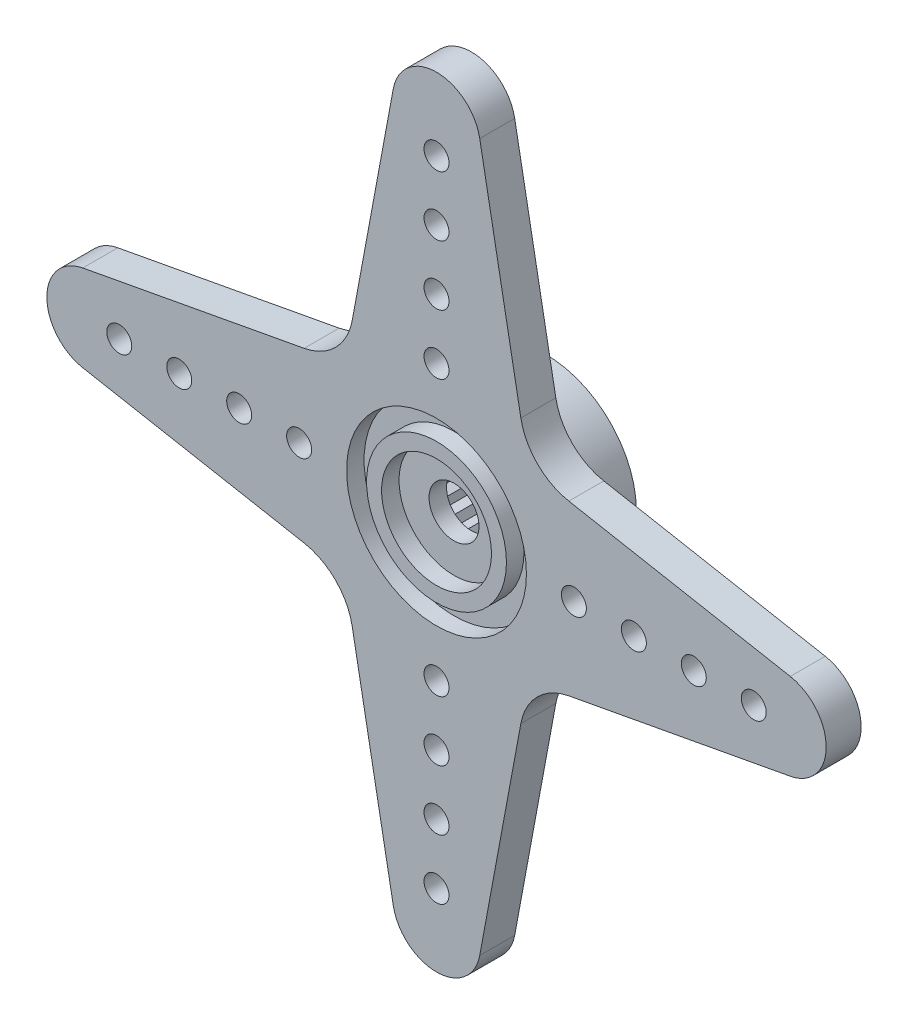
ISO-10303-21;
HEADER;
FILE_DESCRIPTION(('STEP AP214'),'2;1');
FILE_NAME('part.step','',(''),(''),'','','');
FILE_SCHEMA(('AUTOMOTIVE_DESIGN { 1 0 10303 214 1 1 1 1 }'));
ENDSEC;
DATA;
#1=APPLICATION_CONTEXT('core data for automotive mechanical design processes');
#2=APPLICATION_PROTOCOL_DEFINITION('international standard','automotive_design',2000,#1);
#3=PRODUCT_CONTEXT('',#1,'mechanical');
#4=PRODUCT('Part','Part','',(#3));
#5=PRODUCT_RELATED_PRODUCT_CATEGORY('part','',(#4));
#6=PRODUCT_DEFINITION_FORMATION('','',#4);
#7=PRODUCT_DEFINITION_CONTEXT('part definition',#1,'design');
#8=PRODUCT_DEFINITION('design','',#6,#7);
#9=PRODUCT_DEFINITION_SHAPE('','',#8);
#10=(LENGTH_UNIT() NAMED_UNIT(*) SI_UNIT(.MILLI.,.METRE.));
#11=(NAMED_UNIT(*) PLANE_ANGLE_UNIT() SI_UNIT($,.RADIAN.));
#12=(NAMED_UNIT(*) SI_UNIT($,.STERADIAN.) SOLID_ANGLE_UNIT());
#13=UNCERTAINTY_MEASURE_WITH_UNIT(LENGTH_MEASURE(1.E-05),#10,'distance_accuracy_value','');
#14=(GEOMETRIC_REPRESENTATION_CONTEXT(3) GLOBAL_UNCERTAINTY_ASSIGNED_CONTEXT((#13)) GLOBAL_UNIT_ASSIGNED_CONTEXT((#10,
#11,#12)) REPRESENTATION_CONTEXT('',''));
#15=CARTESIAN_POINT('',(0.,0.,0.));
#16=DIRECTION('',(0.,0.,1.));
#17=DIRECTION('',(1.,0.,0.));
#18=AXIS2_PLACEMENT_3D('',#15,#16,#17);
#19=CARTESIAN_POINT('',(-10.24995918,0.,-3.75000012));
#20=DIRECTION('',(0.,0.,1.));
#21=DIRECTION('',(1.,0.,0.));
#22=AXIS2_PLACEMENT_3D('',#19,#20,#21);
#23=CYLINDRICAL_SURFACE('',#22,4.5000037);
#24=CARTESIAN_POINT('',(-10.24995918,0.,-1.00000054));
#25=DIRECTION('',(0.,0.,1.));
#26=DIRECTION('',(1.,0.,0.));
#27=AXIS2_PLACEMENT_3D('',#24,#25,#26);
#28=CIRCLE('',#27,4.5000037);
#29=CARTESIAN_POINT('',(-5.74995548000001,0.,-1.00000054));
#30=VERTEX_POINT('',#29);
#31=EDGE_CURVE('E11',#30,#30,#28,.F.);
#32=ORIENTED_EDGE('',*,*,#31,.T.);
#33=EDGE_LOOP('',(#32));
#34=FACE_BOUND('',#33,.T.);
#35=CARTESIAN_POINT('',(-10.24995918,0.,-3.75000012));
#36=DIRECTION('',(0.,0.,1.));
#37=DIRECTION('',(1.,0.,0.));
#38=AXIS2_PLACEMENT_3D('',#35,#36,#37);
#39=CIRCLE('',#38,4.5000037);
#40=CARTESIAN_POINT('',(-5.74995548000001,0.,-3.75000012));
#41=VERTEX_POINT('',#40);
#42=EDGE_CURVE('E767',#41,#41,#39,.T.);
#43=ORIENTED_EDGE('',*,*,#42,.T.);
#44=EDGE_LOOP('',(#43));
#45=FACE_BOUND('',#44,.T.);
#46=ADVANCED_FACE('F38',(#34,#45),#23,.T.);
#47=CARTESIAN_POINT('',(0.,0.,1.750000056));
#48=DIRECTION('',(0.,0.,1.));
#49=DIRECTION('',(1.,0.,0.));
#50=AXIS2_PLACEMENT_3D('',#47,#48,#49);
#51=PLANE('',#50);
#52=CARTESIAN_POINT('',(-10.24995918,0.,1.750000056));
#53=DIRECTION('',(0.,0.,1.));
#54=DIRECTION('',(1.,0.,0.));
#55=AXIS2_PLACEMENT_3D('',#52,#53,#54);
#56=CIRCLE('',#55,2.75000466);
#57=CARTESIAN_POINT('',(-7.49995452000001,0.,1.750000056));
#58=VERTEX_POINT('',#57);
#59=EDGE_CURVE('E652',#58,#58,#56,.T.);
#60=ORIENTED_EDGE('',*,*,#59,.F.);
#61=EDGE_LOOP('',(#60));
#62=FACE_BOUND('',#61,.T.);
#63=CARTESIAN_POINT('',(-10.24995918,0.,1.750000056));
#64=DIRECTION('',(0.,0.,1.));
#65=DIRECTION('',(1.,0.,0.));
#66=AXIS2_PLACEMENT_3D('',#63,#64,#65);
#67=CIRCLE('',#66,3.5000057);
#68=CARTESIAN_POINT('',(-6.74995348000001,0.,1.750000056));
#69=VERTEX_POINT('',#68);
#70=EDGE_CURVE('E648',#69,#69,#67,.T.);
#71=ORIENTED_EDGE('',*,*,#70,.T.);
#72=EDGE_LOOP('',(#71));
#73=FACE_BOUND('',#72,.T.);
#74=ADVANCED_FACE('F1081',(#62,#73),#51,.T.);
#75=CARTESIAN_POINT('',(-10.24995918,0.,1.750000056));
#76=DIRECTION('',(0.,0.,-1.));
#77=DIRECTION('',(-1.,0.,0.));
#78=AXIS2_PLACEMENT_3D('',#75,#76,#77);
#79=CYLINDRICAL_SURFACE('',#78,1.25000004);
#80=CARTESIAN_POINT('',(-10.24995918,0.,0.));
#81=DIRECTION('',(0.,0.,1.));
#82=DIRECTION('',(1.,0.,0.));
#83=AXIS2_PLACEMENT_3D('',#80,#81,#82);
#84=CIRCLE('',#83,1.25000004);
#85=CARTESIAN_POINT('',(-8.99995914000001,0.,0.));
#86=VERTEX_POINT('',#85);
#87=EDGE_CURVE('E661',#86,#86,#84,.T.);
#88=ORIENTED_EDGE('',*,*,#87,.F.);
#89=EDGE_LOOP('',(#88));
#90=FACE_BOUND('',#89,.T.);
#91=CARTESIAN_POINT('',(-10.24995918,0.,0.875000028));
#92=DIRECTION('',(0.,0.,1.));
#93=DIRECTION('',(1.,0.,0.));
#94=AXIS2_PLACEMENT_3D('',#91,#92,#93);
#95=CIRCLE('',#94,1.25000004);
#96=CARTESIAN_POINT('',(-8.99995914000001,0.,0.875000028));
#97=VERTEX_POINT('',#96);
#98=EDGE_CURVE('E655',#97,#97,#95,.F.);
#99=ORIENTED_EDGE('',*,*,#98,.F.);
#100=EDGE_LOOP('',(#99));
#101=FACE_BOUND('',#100,.T.);
#102=ADVANCED_FACE('F1087',(#90,#101),#79,.F.);
#103=CARTESIAN_POINT('',(-2.46956147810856,-3.13294606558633,-3.75000012));
#104=DIRECTION('',(0.619054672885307,0.785347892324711,0.));
#105=DIRECTION('',(-0.785347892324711,0.619054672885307,0.));
#106=AXIS2_PLACEMENT_3D('',#103,#104,#105);
#107=PLANE('',#106);
#108=DIRECTION('',(-0.785347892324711,0.619054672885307,0.));
#109=VECTOR('',#108,1.);
#110=CARTESIAN_POINT('',(-2.46956147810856,-3.13294606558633,0.));
#111=LINE('',#110,#109);
#112=CARTESIAN_POINT('',(-9.90529354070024,2.7283094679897,0.));
#113=VERTEX_POINT('',#112);
#114=CARTESIAN_POINT('',(-10.24995918,2.99999400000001,0.));
#115=VERTEX_POINT('',#114);
#116=EDGE_CURVE('E666',#113,#115,#111,.T.);
#117=ORIENTED_EDGE('',*,*,#116,.T.);
#118=DIRECTION('',(0.,0.,1.));
#119=VECTOR('',#118,1.);
#120=CARTESIAN_POINT('',(-10.24995918,2.99999400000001,-3.75000012));
#121=LINE('',#120,#119);
#122=CARTESIAN_POINT('',(-10.24995918,2.99999400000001,-3.75000012));
#123=VERTEX_POINT('',#122);
#124=EDGE_CURVE('E919',#123,#115,#121,.T.);
#125=ORIENTED_EDGE('',*,*,#124,.F.);
#126=DIRECTION('',(-0.785347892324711,0.619054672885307,0.));
#127=VECTOR('',#126,1.);
#128=CARTESIAN_POINT('',(-2.46956147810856,-3.13294606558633,-3.75000012));
#129=LINE('',#128,#127);
#130=CARTESIAN_POINT('',(-9.90529354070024,2.7283094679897,-3.75000012));
#131=VERTEX_POINT('',#130);
#132=EDGE_CURVE('E667',#131,#123,#129,.T.);
#133=ORIENTED_EDGE('',*,*,#132,.F.);
#134=DIRECTION('',(0.,0.,1.));
#135=VECTOR('',#134,1.);
#136=CARTESIAN_POINT('',(-9.90529354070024,2.7283094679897,-3.75000012));
#137=LINE('',#136,#135);
#138=EDGE_CURVE('E770',#131,#113,#137,.T.);
#139=ORIENTED_EDGE('',*,*,#138,.T.);
#140=EDGE_LOOP('',(#117,#125,#133,#139));
#141=FACE_BOUND('',#140,.T.);
#142=ADVANCED_FACE('F1099',(#141),#107,.F.);
#143=CARTESIAN_POINT('',(-5.38659533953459,6.83356653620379,-3.75000012));
#144=DIRECTION('',(-0.619054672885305,0.785347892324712,0.));
#145=DIRECTION('',(-0.785347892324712,-0.619054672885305,0.));
#146=AXIS2_PLACEMENT_3D('',#143,#144,#145);
#147=PLANE('',#146);
#148=DIRECTION('',(-0.785347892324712,-0.619054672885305,0.));
#149=VECTOR('',#148,1.);
#150=CARTESIAN_POINT('',(-5.38659533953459,6.83356653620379,0.));
#151=LINE('',#150,#149);
#152=CARTESIAN_POINT('',(-10.5946248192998,2.7283094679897,0.));
#153=VERTEX_POINT('',#152);
#154=EDGE_CURVE('E670',#115,#153,#151,.T.);
#155=ORIENTED_EDGE('',*,*,#154,.T.);
#156=DIRECTION('',(0.,0.,1.));
#157=VECTOR('',#156,1.);
#158=CARTESIAN_POINT('',(-10.5946248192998,2.7283094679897,-3.75000012));
#159=LINE('',#158,#157);
#160=CARTESIAN_POINT('',(-10.5946248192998,2.7283094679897,-3.75000012));
#161=VERTEX_POINT('',#160);
#162=EDGE_CURVE('E921',#161,#153,#159,.T.);
#163=ORIENTED_EDGE('',*,*,#162,.F.);
#164=DIRECTION('',(-0.785347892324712,-0.619054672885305,0.));
#165=VECTOR('',#164,1.);
#166=CARTESIAN_POINT('',(-5.38659533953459,6.83356653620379,-3.75000012));
#167=LINE('',#166,#165);
#168=EDGE_CURVE('E54',#123,#161,#167,.T.);
#169=ORIENTED_EDGE('',*,*,#168,.F.);
#170=ORIENTED_EDGE('',*,*,#124,.T.);
#171=EDGE_LOOP('',(#155,#163,#169,#170));
#172=FACE_BOUND('',#171,.T.);
#173=ADVANCED_FACE('F1095',(#172),#147,.F.);
#174=CARTESIAN_POINT('',(-0.722883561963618,-1.63535149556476,-3.75000012));
#175=DIRECTION('',(0.40429785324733,0.914627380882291,0.));
#176=DIRECTION('',(-0.914627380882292,0.40429785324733,0.));
#177=AXIS2_PLACEMENT_3D('',#174,#175,#176);
#178=PLANE('',#177);
#179=DIRECTION('',(-0.914627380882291,0.40429785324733,0.));
#180=VECTOR('',#179,1.);
#181=CARTESIAN_POINT('',(-0.722883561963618,-1.63535149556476,0.));
#182=LINE('',#181,#180);
#183=CARTESIAN_POINT('',(-10.9960273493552,2.90574367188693,0.));
#184=VERTEX_POINT('',#183);
#185=EDGE_CURVE('E914',#153,#184,#182,.T.);
#186=ORIENTED_EDGE('',*,*,#185,.T.);
#187=DIRECTION('',(0.,0.,1.));
#188=VECTOR('',#187,1.);
#189=CARTESIAN_POINT('',(-10.9960273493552,2.90574367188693,-3.75000012));
#190=LINE('',#189,#188);
#191=CARTESIAN_POINT('',(-10.9960273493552,2.90574367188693,-3.75000012));
#192=VERTEX_POINT('',#191);
#193=EDGE_CURVE('E924',#192,#184,#190,.T.);
#194=ORIENTED_EDGE('',*,*,#193,.F.);
#195=DIRECTION('',(-0.914627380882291,0.40429785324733,0.));
#196=VECTOR('',#195,1.);
#197=CARTESIAN_POINT('',(-0.722883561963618,-1.63535149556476,-3.75000012));
#198=LINE('',#197,#196);
#199=EDGE_CURVE('E764',#161,#192,#198,.T.);
#200=ORIENTED_EDGE('',*,*,#199,.F.);
#201=ORIENTED_EDGE('',*,*,#162,.T.);
#202=EDGE_LOOP('',(#186,#194,#200,#201));
#203=FACE_BOUND('',#202,.T.);
#204=ADVANCED_FACE('F1098',(#203),#178,.F.);
#205=CARTESIAN_POINT('',(-8.34967750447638,6.37293325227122,-3.75000012));
#206=DIRECTION('',(-0.794914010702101,0.606722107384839,0.));
#207=DIRECTION('',(-0.606722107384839,-0.794914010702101,0.));
#208=AXIS2_PLACEMENT_3D('',#205,#206,#207);
#209=PLANE('',#208);
#210=DIRECTION('',(-0.606722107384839,-0.794914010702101,0.));
#211=VECTOR('',#210,1.);
#212=CARTESIAN_POINT('',(-8.34967750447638,6.37293325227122,0.));
#213=LINE('',#212,#211);
#214=CARTESIAN_POINT('',(-11.2622994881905,2.55687975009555,0.));
#215=VERTEX_POINT('',#214);
#216=EDGE_CURVE('E911',#184,#215,#213,.T.);
#217=ORIENTED_EDGE('',*,*,#216,.T.);
#218=DIRECTION('',(0.,0.,1.));
#219=VECTOR('',#218,1.);
#220=CARTESIAN_POINT('',(-11.2622994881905,2.55687975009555,-3.75000012));
#221=LINE('',#220,#219);
#222=CARTESIAN_POINT('',(-11.2622994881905,2.55687975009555,-3.75000012));
#223=VERTEX_POINT('',#222);
#224=EDGE_CURVE('E927',#223,#215,#221,.T.);
#225=ORIENTED_EDGE('',*,*,#224,.F.);
#226=DIRECTION('',(-0.606722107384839,-0.794914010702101,0.));
#227=VECTOR('',#226,1.);
#228=CARTESIAN_POINT('',(-8.34967750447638,6.37293325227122,-3.75000012));
#229=LINE('',#228,#227);
#230=EDGE_CURVE('E762',#192,#223,#229,.T.);
#231=ORIENTED_EDGE('',*,*,#230,.F.);
#232=ORIENTED_EDGE('',*,*,#193,.T.);
#233=EDGE_LOOP('',(#217,#225,#231,#232));
#234=FACE_BOUND('',#233,.T.);
#235=ADVANCED_FACE('F1102',(#234),#209,.F.);
#236=CARTESIAN_POINT('',(0.110568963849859,0.664499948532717,-3.75000012));
#237=DIRECTION('',(0.164137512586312,0.986437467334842,0.));
#238=DIRECTION('',(-0.986437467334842,0.164137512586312,0.));
#239=AXIS2_PLACEMENT_3D('',#236,#237,#238);
#240=PLANE('',#239);
#241=DIRECTION('',(-0.986437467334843,0.164137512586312,0.));
#242=VECTOR('',#241,1.);
#243=CARTESIAN_POINT('',(0.110568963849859,0.664499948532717,0.));
#244=LINE('',#243,#242);
#245=CARTESIAN_POINT('',(-11.6952173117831,2.6289147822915,0.));
#246=VERTEX_POINT('',#245);
#247=EDGE_CURVE('E908',#215,#246,#244,.T.);
#248=ORIENTED_EDGE('',*,*,#247,.T.);
#249=DIRECTION('',(0.,0.,1.));
#250=VECTOR('',#249,1.);
#251=CARTESIAN_POINT('',(-11.6952173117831,2.6289147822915,-3.75000012));
#252=LINE('',#251,#250);
#253=CARTESIAN_POINT('',(-11.6952173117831,2.6289147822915,-3.75000012));
#254=VERTEX_POINT('',#253);
#255=EDGE_CURVE('E930',#254,#246,#252,.T.);
#256=ORIENTED_EDGE('',*,*,#255,.F.);
#257=DIRECTION('',(-0.986437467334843,0.164137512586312,0.));
#258=VECTOR('',#257,1.);
#259=CARTESIAN_POINT('',(0.110568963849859,0.664499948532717,-3.75000012));
#260=LINE('',#259,#258);
#261=EDGE_CURVE('E760',#223,#254,#260,.T.);
#262=ORIENTED_EDGE('',*,*,#261,.F.);
#263=ORIENTED_EDGE('',*,*,#224,.T.);
#264=EDGE_LOOP('',(#248,#256,#262,#263));
#265=FACE_BOUND('',#264,.T.);
#266=ADVANCED_FACE('F1106',(#265),#240,.F.);
#267=CARTESIAN_POINT('',(-10.8606522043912,4.59953267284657,-3.75000012));
#268=DIRECTION('',(-0.920825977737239,0.389973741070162,0.));
#269=DIRECTION('',(-0.389973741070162,-0.920825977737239,0.));
#270=AXIS2_PLACEMENT_3D('',#267,#268,#269);
#271=PLANE('',#270);
#272=DIRECTION('',(-0.389973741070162,-0.920825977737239,0.));
#273=VECTOR('',#272,1.);
#274=CARTESIAN_POINT('',(-10.8606522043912,4.59953267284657,0.));
#275=LINE('',#274,#273);
#276=CARTESIAN_POINT('',(-11.8663650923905,2.22479187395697,0.));
#277=VERTEX_POINT('',#276);
#278=EDGE_CURVE('E905',#246,#277,#275,.T.);
#279=ORIENTED_EDGE('',*,*,#278,.T.);
#280=DIRECTION('',(0.,0.,1.));
#281=VECTOR('',#280,1.);
#282=CARTESIAN_POINT('',(-11.8663650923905,2.22479187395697,-3.75000012));
#283=LINE('',#282,#281);
#284=CARTESIAN_POINT('',(-11.8663650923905,2.22479187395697,-3.75000012));
#285=VERTEX_POINT('',#284);
#286=EDGE_CURVE('E933',#285,#277,#283,.T.);
#287=ORIENTED_EDGE('',*,*,#286,.F.);
#288=DIRECTION('',(-0.389973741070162,-0.920825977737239,0.));
#289=VECTOR('',#288,1.);
#290=CARTESIAN_POINT('',(-10.8606522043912,4.59953267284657,-3.75000012));
#291=LINE('',#290,#289);
#292=EDGE_CURVE('E758',#254,#285,#291,.T.);
#293=ORIENTED_EDGE('',*,*,#292,.F.);
#294=ORIENTED_EDGE('',*,*,#255,.T.);
#295=EDGE_LOOP('',(#279,#287,#293,#294));
#296=FACE_BOUND('',#295,.T.);
#297=ADVANCED_FACE('F1110',(#296),#271,.F.);
#298=CARTESIAN_POINT('',(-0.279813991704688,3.22887977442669,-3.75000012));
#299=DIRECTION('',(-0.0863361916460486,0.996266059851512,0.));
#300=DIRECTION('',(-0.996266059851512,-0.0863361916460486,0.));
#301=AXIS2_PLACEMENT_3D('',#298,#299,#300);
#302=PLANE('',#301);
#303=DIRECTION('',(-0.996266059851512,-0.0863361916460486,0.));
#304=VECTOR('',#303,1.);
#305=CARTESIAN_POINT('',(-0.279813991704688,3.22887977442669,0.));
#306=LINE('',#305,#304);
#307=CARTESIAN_POINT('',(-12.3035963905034,2.18690150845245,0.));
#308=VERTEX_POINT('',#307);
#309=EDGE_CURVE('E902',#277,#308,#306,.T.);
#310=ORIENTED_EDGE('',*,*,#309,.T.);
#311=DIRECTION('',(0.,0.,1.));
#312=VECTOR('',#311,1.);
#313=CARTESIAN_POINT('',(-12.3035963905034,2.18690150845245,-3.75000012));
#314=LINE('',#313,#312);
#315=CARTESIAN_POINT('',(-12.3035963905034,2.18690150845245,-3.75000012));
#316=VERTEX_POINT('',#315);
#317=EDGE_CURVE('E936',#316,#308,#314,.T.);
#318=ORIENTED_EDGE('',*,*,#317,.F.);
#319=DIRECTION('',(-0.996266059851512,-0.0863361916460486,0.));
#320=VECTOR('',#319,1.);
#321=CARTESIAN_POINT('',(-0.279813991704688,3.22887977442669,-3.75000012));
#322=LINE('',#321,#320);
#323=EDGE_CURVE('E756',#285,#316,#322,.T.);
#324=ORIENTED_EDGE('',*,*,#323,.F.);
#325=ORIENTED_EDGE('',*,*,#286,.T.);
#326=EDGE_LOOP('',(#310,#318,#324,#325));
#327=FACE_BOUND('',#326,.T.);
#328=ADVANCED_FACE('F1114',(#327),#302,.F.);
#329=CARTESIAN_POINT('',(-12.353086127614,1.85783519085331,-3.75000012));
#330=DIRECTION('',(-0.988879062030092,0.148721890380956,0.));
#331=DIRECTION('',(-0.148721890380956,-0.988879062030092,0.));
#332=AXIS2_PLACEMENT_3D('',#329,#330,#331);
#333=PLANE('',#332);
#334=DIRECTION('',(-0.148721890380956,-0.988879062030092,0.));
#335=VECTOR('',#334,1.);
#336=CARTESIAN_POINT('',(-12.353086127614,1.85783519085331,0.));
#337=LINE('',#336,#335);
#338=CARTESIAN_POINT('',(-12.3688659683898,1.75291214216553,0.));
#339=VERTEX_POINT('',#338);
#340=EDGE_CURVE('E899',#308,#339,#337,.T.);
#341=ORIENTED_EDGE('',*,*,#340,.T.);
#342=DIRECTION('',(0.,0.,1.));
#343=VECTOR('',#342,1.);
#344=CARTESIAN_POINT('',(-12.3688659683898,1.75291214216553,-3.75000012));
#345=LINE('',#344,#343);
#346=CARTESIAN_POINT('',(-12.3688659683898,1.75291214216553,-3.75000012));
#347=VERTEX_POINT('',#346);
#348=EDGE_CURVE('E939',#347,#339,#345,.T.);
#349=ORIENTED_EDGE('',*,*,#348,.F.);
#350=DIRECTION('',(-0.148721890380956,-0.988879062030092,0.));
#351=VECTOR('',#350,1.);
#352=CARTESIAN_POINT('',(-12.353086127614,1.85783519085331,-3.75000012));
#353=LINE('',#352,#351);
#354=EDGE_CURVE('E754',#316,#347,#353,.T.);
#355=ORIENTED_EDGE('',*,*,#354,.F.);
#356=ORIENTED_EDGE('',*,*,#317,.T.);
#357=EDGE_LOOP('',(#341,#349,#355,#356));
#358=FACE_BOUND('',#357,.T.);
#359=ADVANCED_FACE('F1118',(#358),#333,.F.);
#360=CARTESIAN_POINT('',(-1.90636636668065,5.42766828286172,-3.75000012));
#361=DIRECTION('',(-0.331385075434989,0.943495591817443,0.));
#362=DIRECTION('',(-0.943495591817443,-0.331385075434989,0.));
#363=AXIS2_PLACEMENT_3D('',#360,#361,#362);
#364=PLANE('',#363);
#365=DIRECTION('',(-0.943495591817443,-0.331385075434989,0.));
#366=VECTOR('',#365,1.);
#367=CARTESIAN_POINT('',(-1.90636636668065,5.42766828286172,0.));
#368=LINE('',#367,#366);
#369=CARTESIAN_POINT('',(-12.7829378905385,1.60747716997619,0.));
#370=VERTEX_POINT('',#369);
#371=EDGE_CURVE('E896',#339,#370,#368,.T.);
#372=ORIENTED_EDGE('',*,*,#371,.T.);
#373=DIRECTION('',(0.,0.,1.));
#374=VECTOR('',#373,1.);
#375=CARTESIAN_POINT('',(-12.7829378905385,1.60747716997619,-3.75000012));
#376=LINE('',#375,#374);
#377=CARTESIAN_POINT('',(-12.7829378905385,1.60747716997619,-3.75000012));
#378=VERTEX_POINT('',#377);
#379=EDGE_CURVE('E942',#378,#370,#376,.T.);
#380=ORIENTED_EDGE('',*,*,#379,.F.);
#381=DIRECTION('',(-0.943495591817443,-0.331385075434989,0.));
#382=VECTOR('',#381,1.);
#383=CARTESIAN_POINT('',(-1.90636636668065,5.42766828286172,-3.75000012));
#384=LINE('',#383,#382);
#385=EDGE_CURVE('E752',#347,#378,#384,.T.);
#386=ORIENTED_EDGE('',*,*,#385,.F.);
#387=ORIENTED_EDGE('',*,*,#348,.T.);
#388=EDGE_LOOP('',(#372,#380,#386,#387));
#389=FACE_BOUND('',#388,.T.);
#390=ADVANCED_FACE('F1122',(#389),#364,.F.);
#391=CARTESIAN_POINT('',(-12.4873614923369,-1.27879954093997,-3.75000012));
#392=DIRECTION('',(-0.994797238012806,-0.101874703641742,0.));
#393=DIRECTION('',(0.101874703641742,-0.994797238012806,0.));
#394=AXIS2_PLACEMENT_3D('',#391,#392,#393);
#395=PLANE('',#394);
#396=DIRECTION('',(0.101874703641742,-0.994797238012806,0.));
#397=VECTOR('',#396,1.);
#398=CARTESIAN_POINT('',(-12.4873614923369,-1.27879954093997,0.));
#399=LINE('',#398,#397);
#400=CARTESIAN_POINT('',(-12.7382281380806,1.17089049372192,0.));
#401=VERTEX_POINT('',#400);
#402=EDGE_CURVE('E893',#370,#401,#399,.T.);
#403=ORIENTED_EDGE('',*,*,#402,.T.);
#404=DIRECTION('',(0.,0.,1.));
#405=VECTOR('',#404,1.);
#406=CARTESIAN_POINT('',(-12.7382281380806,1.17089049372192,-3.75000012));
#407=LINE('',#406,#405);
#408=CARTESIAN_POINT('',(-12.7382281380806,1.17089049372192,-3.75000012));
#409=VERTEX_POINT('',#408);
#410=EDGE_CURVE('E945',#409,#401,#407,.T.);
#411=ORIENTED_EDGE('',*,*,#410,.F.);
#412=DIRECTION('',(0.101874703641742,-0.994797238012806,0.));
#413=VECTOR('',#412,1.);
#414=CARTESIAN_POINT('',(-12.4873614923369,-1.27879954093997,-3.75000012));
#415=LINE('',#414,#413);
#416=EDGE_CURVE('E750',#378,#409,#415,.T.);
#417=ORIENTED_EDGE('',*,*,#416,.F.);
#418=ORIENTED_EDGE('',*,*,#379,.T.);
#419=EDGE_LOOP('',(#403,#411,#417,#418));
#420=FACE_BOUND('',#419,.T.);
#421=ADVANCED_FACE('F1126',(#420),#395,.F.);
#422=CARTESIAN_POINT('',(-4.473251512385,6.69396923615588,-3.75000012));
#423=DIRECTION('',(-0.555611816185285,0.831441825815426,0.));
#424=DIRECTION('',(-0.831441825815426,-0.555611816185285,0.));
#425=AXIS2_PLACEMENT_3D('',#422,#423,#424);
#426=PLANE('',#425);
#427=DIRECTION('',(-0.831441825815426,-0.555611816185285,0.));
#428=VECTOR('',#427,1.);
#429=CARTESIAN_POINT('',(-4.473251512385,6.69396923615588,0.));
#430=LINE('',#429,#428);
#431=CARTESIAN_POINT('',(-13.1031230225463,0.927049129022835,0.));
#432=VERTEX_POINT('',#431);
#433=EDGE_CURVE('E890',#401,#432,#430,.T.);
#434=ORIENTED_EDGE('',*,*,#433,.T.);
#435=DIRECTION('',(0.,0.,1.));
#436=VECTOR('',#435,1.);
#437=CARTESIAN_POINT('',(-13.1031230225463,0.927049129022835,-3.75000012));
#438=LINE('',#437,#436);
#439=CARTESIAN_POINT('',(-13.1031230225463,0.927049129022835,-3.75000012));
#440=VERTEX_POINT('',#439);
#441=EDGE_CURVE('E948',#440,#432,#438,.T.);
#442=ORIENTED_EDGE('',*,*,#441,.F.);
#443=DIRECTION('',(-0.831441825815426,-0.555611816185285,0.));
#444=VECTOR('',#443,1.);
#445=CARTESIAN_POINT('',(-4.473251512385,6.69396923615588,-3.75000012));
#446=LINE('',#445,#444);
#447=EDGE_CURVE('E748',#409,#440,#446,.T.);
#448=ORIENTED_EDGE('',*,*,#447,.F.);
#449=ORIENTED_EDGE('',*,*,#410,.T.);
#450=EDGE_LOOP('',(#434,#442,#448,#449));
#451=FACE_BOUND('',#450,.T.);
#452=ADVANCED_FACE('F1130',(#451),#426,.F.);
#453=CARTESIAN_POINT('',(-11.2328336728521,-4.14337289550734,-3.75000012));
#454=DIRECTION('',(-0.938208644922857,-0.346070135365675,0.));
#455=DIRECTION('',(0.346070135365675,-0.938208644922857,0.));
#456=AXIS2_PLACEMENT_3D('',#453,#454,#455);
#457=PLANE('',#456);
#458=DIRECTION('',(0.346070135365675,-0.938208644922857,0.));
#459=VECTOR('',#458,1.);
#460=CARTESIAN_POINT('',(-11.2328336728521,-4.14337289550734,0.));
#461=LINE('',#460,#459);
#462=CARTESIAN_POINT('',(-12.951243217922,0.515297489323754,0.));
#463=VERTEX_POINT('',#462);
#464=EDGE_CURVE('E887',#432,#463,#461,.T.);
#465=ORIENTED_EDGE('',*,*,#464,.T.);
#466=DIRECTION('',(0.,0.,1.));
#467=VECTOR('',#466,1.);
#468=CARTESIAN_POINT('',(-12.951243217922,0.515297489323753,-3.75000012));
#469=LINE('',#468,#467);
#470=CARTESIAN_POINT('',(-12.951243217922,0.515297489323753,-3.75000012));
#471=VERTEX_POINT('',#470);
#472=EDGE_CURVE('E951',#471,#463,#469,.T.);
#473=ORIENTED_EDGE('',*,*,#472,.F.);
#474=DIRECTION('',(0.346070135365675,-0.938208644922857,0.));
#475=VECTOR('',#474,1.);
#476=CARTESIAN_POINT('',(-11.2328336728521,-4.14337289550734,-3.75000012));
#477=LINE('',#476,#475);
#478=EDGE_CURVE('E746',#440,#471,#477,.T.);
#479=ORIENTED_EDGE('',*,*,#478,.F.);
#480=ORIENTED_EDGE('',*,*,#441,.T.);
#481=EDGE_LOOP('',(#465,#473,#479,#480));
#482=FACE_BOUND('',#481,.T.);
#483=ADVANCED_FACE('F1134',(#482),#457,.F.);
#484=CARTESIAN_POINT('',(-7.44295325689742,6.66579415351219,-3.75000012));
#485=DIRECTION('',(-0.744927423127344,0.667145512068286,0.));
#486=DIRECTION('',(-0.667145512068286,-0.744927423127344,0.));
#487=AXIS2_PLACEMENT_3D('',#484,#485,#486);
#488=PLANE('',#487);
#489=DIRECTION('',(-0.667145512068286,-0.744927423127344,0.));
#490=VECTOR('',#489,1.);
#491=CARTESIAN_POINT('',(-7.44295325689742,6.66579415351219,0.));
#492=LINE('',#491,#490);
#493=CARTESIAN_POINT('',(-13.2440333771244,0.188371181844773,0.));
#494=VERTEX_POINT('',#493);
#495=EDGE_CURVE('E884',#463,#494,#492,.T.);
#496=ORIENTED_EDGE('',*,*,#495,.T.);
#497=DIRECTION('',(0.,0.,1.));
#498=VECTOR('',#497,1.);
#499=CARTESIAN_POINT('',(-13.2440333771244,0.188371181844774,-3.75000012));
#500=LINE('',#499,#498);
#501=CARTESIAN_POINT('',(-13.2440333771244,0.188371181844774,-3.75000012));
#502=VERTEX_POINT('',#501);
#503=EDGE_CURVE('E954',#502,#494,#500,.T.);
#504=ORIENTED_EDGE('',*,*,#503,.F.);
#505=DIRECTION('',(-0.667145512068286,-0.744927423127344,0.));
#506=VECTOR('',#505,1.);
#507=CARTESIAN_POINT('',(-7.44295325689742,6.66579415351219,-3.75000012));
#508=LINE('',#507,#506);
#509=EDGE_CURVE('E744',#471,#502,#508,.T.);
#510=ORIENTED_EDGE('',*,*,#509,.F.);
#511=ORIENTED_EDGE('',*,*,#472,.T.);
#512=EDGE_LOOP('',(#496,#504,#510,#511));
#513=FACE_BOUND('',#512,.T.);
#514=ADVANCED_FACE('F1138',(#513),#488,.F.);
#515=CARTESIAN_POINT('',(-8.87525058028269,-6.13340728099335,-3.75000012));
#516=DIRECTION('',(-0.822668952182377,-0.568520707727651,0.));
#517=DIRECTION('',(0.568520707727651,-0.822668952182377,0.));
#518=AXIS2_PLACEMENT_3D('',#515,#516,#517);
#519=PLANE('',#518);
#520=DIRECTION('',(0.568520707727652,-0.822668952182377,0.));
#521=VECTOR('',#520,1.);
#522=CARTESIAN_POINT('',(-8.87525058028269,-6.13340728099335,0.));
#523=LINE('',#522,#521);
#524=CARTESIAN_POINT('',(-12.9945266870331,-0.172673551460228,0.));
#525=VERTEX_POINT('',#524);
#526=EDGE_CURVE('E881',#494,#525,#523,.T.);
#527=ORIENTED_EDGE('',*,*,#526,.T.);
#528=DIRECTION('',(0.,0.,1.));
#529=VECTOR('',#528,1.);
#530=CARTESIAN_POINT('',(-12.9945266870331,-0.172673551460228,-3.75000012));
#531=LINE('',#530,#529);
#532=CARTESIAN_POINT('',(-12.9945266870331,-0.172673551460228,-3.75000012));
#533=VERTEX_POINT('',#532);
#534=EDGE_CURVE('E957',#533,#525,#531,.T.);
#535=ORIENTED_EDGE('',*,*,#534,.F.);
#536=DIRECTION('',(0.568520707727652,-0.822668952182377,0.));
#537=VECTOR('',#536,1.);
#538=CARTESIAN_POINT('',(-8.87525058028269,-6.13340728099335,-3.75000012));
#539=LINE('',#538,#537);
#540=EDGE_CURVE('E742',#502,#533,#539,.T.);
#541=ORIENTED_EDGE('',*,*,#540,.F.);
#542=ORIENTED_EDGE('',*,*,#503,.T.);
#543=EDGE_LOOP('',(#527,#535,#541,#542));
#544=FACE_BOUND('',#543,.T.);
#545=ADVANCED_FACE('F1142',(#544),#519,.F.);
#546=CARTESIAN_POINT('',(-10.1631241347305,5.27867484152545,-3.75000012));
#547=DIRECTION('',(-0.887436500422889,0.460929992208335,0.));
#548=DIRECTION('',(-0.460929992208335,-0.887436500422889,0.));
#549=AXIS2_PLACEMENT_3D('',#546,#547,#548);
#550=PLANE('',#549);
#551=DIRECTION('',(-0.460929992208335,-0.887436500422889,0.));
#552=VECTOR('',#551,1.);
#553=CARTESIAN_POINT('',(-10.1631241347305,5.27867484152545,0.));
#554=LINE('',#553,#552);
#555=CARTESIAN_POINT('',(-13.1968150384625,-0.562142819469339,0.));
#556=VERTEX_POINT('',#555);
#557=EDGE_CURVE('E878',#525,#556,#554,.T.);
#558=ORIENTED_EDGE('',*,*,#557,.T.);
#559=DIRECTION('',(0.,0.,1.));
#560=VECTOR('',#559,1.);
#561=CARTESIAN_POINT('',(-13.1968150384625,-0.562142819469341,-3.75000012));
#562=LINE('',#561,#560);
#563=CARTESIAN_POINT('',(-13.1968150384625,-0.562142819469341,-3.75000012));
#564=VERTEX_POINT('',#563);
#565=EDGE_CURVE('E960',#564,#556,#562,.T.);
#566=ORIENTED_EDGE('',*,*,#565,.F.);
#567=DIRECTION('',(-0.460929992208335,-0.887436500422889,0.));
#568=VECTOR('',#567,1.);
#569=CARTESIAN_POINT('',(-10.1631241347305,5.27867484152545,-3.75000012));
#570=LINE('',#569,#568);
#571=EDGE_CURVE('E740',#533,#564,#570,.T.);
#572=ORIENTED_EDGE('',*,*,#571,.F.);
#573=ORIENTED_EDGE('',*,*,#534,.T.);
#574=EDGE_LOOP('',(#558,#566,#572,#573));
#575=FACE_BOUND('',#574,.T.);
#576=ADVANCED_FACE('F1146',(#575),#550,.F.);
#577=CARTESIAN_POINT('',(-5.94760850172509,-6.85331939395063,-3.75000012));
#578=DIRECTION('',(-0.655437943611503,-0.755249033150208,0.));
#579=DIRECTION('',(0.755249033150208,-0.655437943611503,0.));
#580=AXIS2_PLACEMENT_3D('',#577,#578,#579);
#581=PLANE('',#580);
#582=DIRECTION('',(0.755249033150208,-0.655437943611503,0.));
#583=VECTOR('',#582,1.);
#584=CARTESIAN_POINT('',(-5.94760850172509,-6.85331939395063,0.));
#585=LINE('',#584,#583);
#586=CARTESIAN_POINT('',(-12.865358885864,-0.849794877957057,0.));
#587=VERTEX_POINT('',#586);
#588=EDGE_CURVE('E875',#556,#587,#585,.T.);
#589=ORIENTED_EDGE('',*,*,#588,.T.);
#590=DIRECTION('',(0.,0.,1.));
#591=VECTOR('',#590,1.);
#592=CARTESIAN_POINT('',(-12.865358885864,-0.849794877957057,-3.75000012));
#593=LINE('',#592,#591);
#594=CARTESIAN_POINT('',(-12.865358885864,-0.849794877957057,-3.75000012));
#595=VERTEX_POINT('',#594);
#596=EDGE_CURVE('E963',#595,#587,#593,.T.);
#597=ORIENTED_EDGE('',*,*,#596,.F.);
#598=DIRECTION('',(0.755249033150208,-0.655437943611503,0.));
#599=VECTOR('',#598,1.);
#600=CARTESIAN_POINT('',(-5.94760850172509,-6.85331939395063,-3.75000012));
#601=LINE('',#600,#599);
#602=EDGE_CURVE('E738',#564,#595,#601,.T.);
#603=ORIENTED_EDGE('',*,*,#602,.F.);
#604=ORIENTED_EDGE('',*,*,#565,.T.);
#605=EDGE_LOOP('',(#589,#597,#603,#604));
#606=FACE_BOUND('',#605,.T.);
#607=ADVANCED_FACE('F1150',(#606),#581,.F.);
#608=CARTESIAN_POINT('',(-12.0227951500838,2.78610069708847,-3.75000012));
#609=DIRECTION('',(-0.97418467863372,0.225752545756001,0.));
#610=DIRECTION('',(-0.225752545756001,-0.97418467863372,0.));
#611=AXIS2_PLACEMENT_3D('',#608,#609,#610);
#612=PLANE('',#611);
#613=DIRECTION('',(-0.225752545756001,-0.97418467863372,0.));
#614=VECTOR('',#613,1.);
#615=CARTESIAN_POINT('',(-12.0227951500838,2.78610069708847,0.));
#616=LINE('',#615,#614);
#617=CARTESIAN_POINT('',(-12.9644349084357,-1.27733532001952,0.));
#618=VERTEX_POINT('',#617);
#619=EDGE_CURVE('E872',#587,#618,#616,.T.);
#620=ORIENTED_EDGE('',*,*,#619,.T.);
#621=DIRECTION('',(0.,0.,1.));
#622=VECTOR('',#621,1.);
#623=CARTESIAN_POINT('',(-12.9644349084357,-1.27733532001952,-3.75000012));
#624=LINE('',#623,#622);
#625=CARTESIAN_POINT('',(-12.9644349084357,-1.27733532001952,-3.75000012));
#626=VERTEX_POINT('',#625);
#627=EDGE_CURVE('E966',#626,#618,#624,.T.);
#628=ORIENTED_EDGE('',*,*,#627,.F.);
#629=DIRECTION('',(-0.225752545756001,-0.97418467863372,0.));
#630=VECTOR('',#629,1.);
#631=CARTESIAN_POINT('',(-12.0227951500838,2.78610069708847,-3.75000012));
#632=LINE('',#631,#630);
#633=EDGE_CURVE('E736',#595,#626,#632,.T.);
#634=ORIENTED_EDGE('',*,*,#633,.F.);
#635=ORIENTED_EDGE('',*,*,#596,.T.);
#636=EDGE_LOOP('',(#620,#628,#634,#635));
#637=FACE_BOUND('',#636,.T.);
#638=ADVANCED_FACE('F1154',(#637),#612,.F.);
#639=CARTESIAN_POINT('',(-3.10145259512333,-6.20620468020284,-3.75000012));
#640=DIRECTION('',(-0.447023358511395,-0.894522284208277,0.));
#641=DIRECTION('',(0.894522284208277,-0.447023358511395,0.));
#642=AXIS2_PLACEMENT_3D('',#639,#640,#641);
#643=PLANE('',#642);
#644=DIRECTION('',(0.894522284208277,-0.447023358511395,0.));
#645=VECTOR('',#644,1.);
#646=CARTESIAN_POINT('',(-3.10145259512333,-6.20620468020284,0.));
#647=LINE('',#646,#645);
#648=CARTESIAN_POINT('',(-12.5718559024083,-1.47352046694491,0.));
#649=VERTEX_POINT('',#648);
#650=EDGE_CURVE('E869',#618,#649,#647,.T.);
#651=ORIENTED_EDGE('',*,*,#650,.T.);
#652=DIRECTION('',(0.,0.,1.));
#653=VECTOR('',#652,1.);
#654=CARTESIAN_POINT('',(-12.5718559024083,-1.47352046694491,-3.75000012));
#655=LINE('',#654,#653);
#656=CARTESIAN_POINT('',(-12.5718559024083,-1.47352046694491,-3.75000012));
#657=VERTEX_POINT('',#656);
#658=EDGE_CURVE('E969',#657,#649,#655,.T.);
#659=ORIENTED_EDGE('',*,*,#658,.F.);
#660=DIRECTION('',(0.894522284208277,-0.447023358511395,0.));
#661=VECTOR('',#660,1.);
#662=CARTESIAN_POINT('',(-3.10145259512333,-6.20620468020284,-3.75000012));
#663=LINE('',#662,#661);
#664=EDGE_CURVE('E734',#626,#657,#663,.T.);
#665=ORIENTED_EDGE('',*,*,#664,.F.);
#666=ORIENTED_EDGE('',*,*,#627,.T.);
#667=EDGE_LOOP('',(#651,#659,#665,#666));
#668=FACE_BOUND('',#667,.T.);
#669=ADVANCED_FACE('F1158',(#668),#643,.F.);
#670=CARTESIAN_POINT('',(-12.599627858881,-0.297557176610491,-3.75000012));
#671=DIRECTION('',(-0.999721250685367,-0.0236097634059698,0.));
#672=DIRECTION('',(0.0236097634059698,-0.999721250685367,0.));
#673=AXIS2_PLACEMENT_3D('',#670,#671,#672);
#674=PLANE('',#673);
#675=DIRECTION('',(0.0236097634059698,-0.999721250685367,0.));
#676=VECTOR('',#675,1.);
#677=CARTESIAN_POINT('',(-12.599627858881,-0.297557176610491,0.));
#678=LINE('',#677,#676);
#679=CARTESIAN_POINT('',(-12.5614942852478,-1.91226814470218,0.));
#680=VERTEX_POINT('',#679);
#681=EDGE_CURVE('E866',#649,#680,#678,.T.);
#682=ORIENTED_EDGE('',*,*,#681,.T.);
#683=DIRECTION('',(0.,0.,1.));
#684=VECTOR('',#683,1.);
#685=CARTESIAN_POINT('',(-12.5614942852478,-1.91226814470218,-3.75000012));
#686=LINE('',#685,#684);
#687=CARTESIAN_POINT('',(-12.5614942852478,-1.91226814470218,-3.75000012));
#688=VERTEX_POINT('',#687);
#689=EDGE_CURVE('E972',#688,#680,#686,.T.);
#690=ORIENTED_EDGE('',*,*,#689,.F.);
#691=DIRECTION('',(0.0236097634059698,-0.999721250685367,0.));
#692=VECTOR('',#691,1.);
#693=CARTESIAN_POINT('',(-12.599627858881,-0.297557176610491,-3.75000012));
#694=LINE('',#693,#692);
#695=EDGE_CURVE('E732',#657,#688,#694,.T.);
#696=ORIENTED_EDGE('',*,*,#695,.F.);
#697=ORIENTED_EDGE('',*,*,#658,.T.);
#698=EDGE_LOOP('',(#682,#690,#696,#697));
#699=FACE_BOUND('',#698,.T.);
#700=ADVANCED_FACE('F1162',(#699),#674,.F.);
#701=CARTESIAN_POINT('',(-0.950262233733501,-4.41270862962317,-3.75000012));
#702=DIRECTION('',(-0.2105206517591,-0.97758941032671,0.));
#703=DIRECTION('',(0.97758941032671,-0.2105206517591,0.));
#704=AXIS2_PLACEMENT_3D('',#701,#702,#703);
#705=PLANE('',#704);
#706=DIRECTION('',(0.97758941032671,-0.2105206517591,0.));
#707=VECTOR('',#706,1.);
#708=CARTESIAN_POINT('',(-0.950262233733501,-4.41270862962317,0.));
#709=LINE('',#708,#707);
#710=CARTESIAN_POINT('',(-12.1324596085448,-2.00465934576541,0.));
#711=VERTEX_POINT('',#710);
#712=EDGE_CURVE('E863',#680,#711,#709,.T.);
#713=ORIENTED_EDGE('',*,*,#712,.T.);
#714=DIRECTION('',(0.,0.,1.));
#715=VECTOR('',#714,1.);
#716=CARTESIAN_POINT('',(-12.1324596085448,-2.00465934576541,-3.75000012));
#717=LINE('',#716,#715);
#718=CARTESIAN_POINT('',(-12.1324596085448,-2.00465934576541,-3.75000012));
#719=VERTEX_POINT('',#718);
#720=EDGE_CURVE('E975',#719,#711,#717,.T.);
#721=ORIENTED_EDGE('',*,*,#720,.F.);
#722=DIRECTION('',(0.97758941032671,-0.2105206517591,0.));
#723=VECTOR('',#722,1.);
#724=CARTESIAN_POINT('',(-0.950262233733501,-4.41270862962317,-3.75000012));
#725=LINE('',#724,#723);
#726=EDGE_CURVE('E730',#688,#719,#725,.T.);
#727=ORIENTED_EDGE('',*,*,#726,.F.);
#728=ORIENTED_EDGE('',*,*,#689,.T.);
#729=EDGE_LOOP('',(#713,#721,#727,#728));
#730=FACE_BOUND('',#729,.T.);
#731=ADVANCED_FACE('F1166',(#730),#705,.F.);
#732=CARTESIAN_POINT('',(-11.7620252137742,-3.31786923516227,-3.75000012));
#733=DIRECTION('',(-0.962441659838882,-0.271488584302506,0.));
#734=DIRECTION('',(0.271488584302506,-0.962441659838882,0.));
#735=AXIS2_PLACEMENT_3D('',#732,#733,#734);
#736=PLANE('',#735);
#737=DIRECTION('',(0.271488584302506,-0.962441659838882,0.));
#738=VECTOR('',#737,1.);
#739=CARTESIAN_POINT('',(-11.7620252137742,-3.31786923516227,0.));
#740=LINE('',#739,#738);
#741=CARTESIAN_POINT('',(-12.0133114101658,-2.42704612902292,0.));
#742=VERTEX_POINT('',#741);
#743=EDGE_CURVE('E860',#711,#742,#740,.T.);
#744=ORIENTED_EDGE('',*,*,#743,.T.);
#745=DIRECTION('',(0.,0.,1.));
#746=VECTOR('',#745,1.);
#747=CARTESIAN_POINT('',(-12.0133114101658,-2.42704612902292,-3.75000012));
#748=LINE('',#747,#746);
#749=CARTESIAN_POINT('',(-12.0133114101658,-2.42704612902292,-3.75000012));
#750=VERTEX_POINT('',#749);
#751=EDGE_CURVE('E978',#750,#742,#748,.T.);
#752=ORIENTED_EDGE('',*,*,#751,.F.);
#753=DIRECTION('',(0.271488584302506,-0.962441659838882,0.));
#754=VECTOR('',#753,1.);
#755=CARTESIAN_POINT('',(-11.7620252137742,-3.31786923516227,-3.75000012));
#756=LINE('',#755,#754);
#757=EDGE_CURVE('E728',#719,#750,#756,.T.);
#758=ORIENTED_EDGE('',*,*,#757,.F.);
#759=ORIENTED_EDGE('',*,*,#720,.T.);
#760=EDGE_LOOP('',(#744,#752,#758,#759));
#761=FACE_BOUND('',#760,.T.);
#762=ADVANCED_FACE('F1170',(#761),#736,.F.);
#763=CARTESIAN_POINT('',(0.0766215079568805,-1.95263695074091,-3.75000012));
#764=DIRECTION('',(0.0392098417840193,-0.999230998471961,0.));
#765=DIRECTION('',(0.999230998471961,0.0392098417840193,0.));
#766=AXIS2_PLACEMENT_3D('',#763,#764,#765);
#767=PLANE('',#766);
#768=DIRECTION('',(0.999230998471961,0.0392098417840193,0.));
#769=VECTOR('',#768,1.);
#770=CARTESIAN_POINT('',(0.0766215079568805,-1.95263695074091,0.));
#771=LINE('',#770,#769);
#772=CARTESIAN_POINT('',(-11.5747788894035,-2.40983810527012,0.));
#773=VERTEX_POINT('',#772);
#774=EDGE_CURVE('E857',#742,#773,#771,.T.);
#775=ORIENTED_EDGE('',*,*,#774,.T.);
#776=DIRECTION('',(0.,0.,1.));
#777=VECTOR('',#776,1.);
#778=CARTESIAN_POINT('',(-11.5747788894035,-2.40983810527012,-3.75000012));
#779=LINE('',#778,#777);
#780=CARTESIAN_POINT('',(-11.5747788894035,-2.40983810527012,-3.75000012));
#781=VERTEX_POINT('',#780);
#782=EDGE_CURVE('E981',#781,#773,#779,.T.);
#783=ORIENTED_EDGE('',*,*,#782,.F.);
#784=DIRECTION('',(0.999230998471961,0.0392098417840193,0.));
#785=VECTOR('',#784,1.);
#786=CARTESIAN_POINT('',(0.0766215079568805,-1.95263695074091,-3.75000012));
#787=LINE('',#786,#785);
#788=EDGE_CURVE('E726',#750,#781,#787,.T.);
#789=ORIENTED_EDGE('',*,*,#788,.F.);
#790=ORIENTED_EDGE('',*,*,#751,.T.);
#791=EDGE_LOOP('',(#775,#783,#789,#790));
#792=FACE_BOUND('',#791,.T.);
#793=ADVANCED_FACE('F1174',(#792),#767,.F.);
#794=CARTESIAN_POINT('',(-9.7009892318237,-5.63543180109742,-3.75000012));
#795=DIRECTION('',(-0.864688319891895,-0.502308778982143,0.));
#796=DIRECTION('',(0.502308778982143,-0.864688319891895,0.));
#797=AXIS2_PLACEMENT_3D('',#794,#795,#796);
#798=PLANE('',#797);
#799=DIRECTION('',(0.502308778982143,-0.864688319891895,0.));
#800=VECTOR('',#799,1.);
#801=CARTESIAN_POINT('',(-9.7009892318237,-5.63543180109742,0.));
#802=LINE('',#801,#800);
#803=CARTESIAN_POINT('',(-11.3543306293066,-2.78932387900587,0.));
#804=VERTEX_POINT('',#803);
#805=EDGE_CURVE('E854',#773,#804,#802,.T.);
#806=ORIENTED_EDGE('',*,*,#805,.T.);
#807=DIRECTION('',(0.,0.,1.));
#808=VECTOR('',#807,1.);
#809=CARTESIAN_POINT('',(-11.3543306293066,-2.78932387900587,-3.75000012));
#810=LINE('',#809,#808);
#811=CARTESIAN_POINT('',(-11.3543306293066,-2.78932387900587,-3.75000012));
#812=VERTEX_POINT('',#811);
#813=EDGE_CURVE('E984',#812,#804,#810,.T.);
#814=ORIENTED_EDGE('',*,*,#813,.F.);
#815=DIRECTION('',(0.502308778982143,-0.864688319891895,0.));
#816=VECTOR('',#815,1.);
#817=CARTESIAN_POINT('',(-9.7009892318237,-5.63543180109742,-3.75000012));
#818=LINE('',#817,#816);
#819=EDGE_CURVE('E724',#781,#812,#818,.T.);
#820=ORIENTED_EDGE('',*,*,#819,.F.);
#821=ORIENTED_EDGE('',*,*,#782,.T.);
#822=EDGE_LOOP('',(#806,#814,#820,#821));
#823=FACE_BOUND('',#822,.T.);
#824=ADVANCED_FACE('F1178',(#823),#798,.F.);
#825=CARTESIAN_POINT('',(-0.166252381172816,0.556011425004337,-3.75000012));
#826=DIRECTION('',(0.28647663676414,-0.95808722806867,0.));
#827=DIRECTION('',(0.95808722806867,0.28647663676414,0.));
#828=AXIS2_PLACEMENT_3D('',#825,#826,#827);
#829=PLANE('',#828);
#830=DIRECTION('',(0.95808722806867,0.28647663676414,0.));
#831=VECTOR('',#830,1.);
#832=CARTESIAN_POINT('',(-0.166252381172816,0.556011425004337,0.));
#833=LINE('',#832,#831);
#834=CARTESIAN_POINT('',(-10.9338548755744,-2.66359787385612,0.));
#835=VERTEX_POINT('',#834);
#836=EDGE_CURVE('E851',#804,#835,#833,.T.);
#837=ORIENTED_EDGE('',*,*,#836,.T.);
#838=DIRECTION('',(0.,0.,1.));
#839=VECTOR('',#838,1.);
#840=CARTESIAN_POINT('',(-10.9338548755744,-2.66359787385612,-3.75000012));
#841=LINE('',#840,#839);
#842=CARTESIAN_POINT('',(-10.9338548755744,-2.66359787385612,-3.75000012));
#843=VERTEX_POINT('',#842);
#844=EDGE_CURVE('E987',#843,#835,#841,.T.);
#845=ORIENTED_EDGE('',*,*,#844,.F.);
#846=DIRECTION('',(0.95808722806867,0.28647663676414,0.));
#847=VECTOR('',#846,1.);
#848=CARTESIAN_POINT('',(-0.166252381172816,0.556011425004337,-3.75000012));
#849=LINE('',#848,#847);
#850=EDGE_CURVE('E722',#812,#843,#849,.T.);
#851=ORIENTED_EDGE('',*,*,#850,.F.);
#852=ORIENTED_EDGE('',*,*,#813,.T.);
#853=EDGE_LOOP('',(#837,#845,#851,#852));
#854=FACE_BOUND('',#853,.T.);
#855=ADVANCED_FACE('F1182',(#854),#829,.F.);
#856=CARTESIAN_POINT('',(-6.88388816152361,-6.77727470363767,-3.75000012));
#857=DIRECTION('',(-0.71260343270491,-0.701567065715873,0.));
#858=DIRECTION('',(0.701567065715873,-0.71260343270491,0.));
#859=AXIS2_PLACEMENT_3D('',#856,#857,#858);
#860=PLANE('',#859);
#861=DIRECTION('',(0.701567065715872,-0.71260343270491,0.));
#862=VECTOR('',#861,1.);
#863=CARTESIAN_POINT('',(-6.88388816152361,-6.77727470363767,0.));
#864=LINE('',#863,#862);
#865=CARTESIAN_POINT('',(-10.6259581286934,-2.97633815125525,0.));
#866=VERTEX_POINT('',#865);
#867=EDGE_CURVE('E848',#835,#866,#864,.T.);
#868=ORIENTED_EDGE('',*,*,#867,.T.);
#869=DIRECTION('',(0.,0.,1.));
#870=VECTOR('',#869,1.);
#871=CARTESIAN_POINT('',(-10.6259581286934,-2.97633815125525,-3.75000012));
#872=LINE('',#871,#870);
#873=CARTESIAN_POINT('',(-10.6259581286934,-2.97633815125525,-3.75000012));
#874=VERTEX_POINT('',#873);
#875=EDGE_CURVE('E990',#874,#866,#872,.T.);
#876=ORIENTED_EDGE('',*,*,#875,.F.);
#877=DIRECTION('',(0.701567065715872,-0.71260343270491,0.));
#878=VECTOR('',#877,1.);
#879=CARTESIAN_POINT('',(-6.88388816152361,-6.77727470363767,-3.75000012));
#880=LINE('',#879,#878);
#881=EDGE_CURVE('E720',#843,#874,#880,.T.);
#882=ORIENTED_EDGE('',*,*,#881,.F.);
#883=ORIENTED_EDGE('',*,*,#844,.T.);
#884=EDGE_LOOP('',(#868,#876,#882,#883));
#885=FACE_BOUND('',#884,.T.);
#886=ADVANCED_FACE('F1186',(#885),#860,.F.);
#887=CARTESIAN_POINT('',(-1.51128508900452,2.51052029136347,-3.75000012));
#888=DIRECTION('',(0.51574305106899,-0.856743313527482,0.));
#889=DIRECTION('',(0.856743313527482,0.51574305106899,0.));
#890=AXIS2_PLACEMENT_3D('',#887,#888,#889);
#891=PLANE('',#890);
#892=DIRECTION('',(0.856743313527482,0.51574305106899,0.));
#893=VECTOR('',#892,1.);
#894=CARTESIAN_POINT('',(-1.51128508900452,2.51052029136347,0.));
#895=LINE('',#894,#893);
#896=CARTESIAN_POINT('',(-10.2499591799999,-2.749993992,0.));
#897=VERTEX_POINT('',#896);
#898=EDGE_CURVE('E845',#866,#897,#895,.T.);
#899=ORIENTED_EDGE('',*,*,#898,.T.);
#900=DIRECTION('',(0.,0.,1.));
#901=VECTOR('',#900,1.);
#902=CARTESIAN_POINT('',(-10.2499591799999,-2.749993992,-3.75000012));
#903=LINE('',#902,#901);
#904=CARTESIAN_POINT('',(-10.2499591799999,-2.749993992,-3.75000012));
#905=VERTEX_POINT('',#904);
#906=EDGE_CURVE('E993',#905,#897,#903,.T.);
#907=ORIENTED_EDGE('',*,*,#906,.F.);
#908=DIRECTION('',(0.856743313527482,0.51574305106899,0.));
#909=VECTOR('',#908,1.);
#910=CARTESIAN_POINT('',(-1.51128508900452,2.51052029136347,-3.75000012));
#911=LINE('',#910,#909);
#912=EDGE_CURVE('E718',#874,#905,#911,.T.);
#913=ORIENTED_EDGE('',*,*,#912,.F.);
#914=ORIENTED_EDGE('',*,*,#875,.T.);
#915=EDGE_LOOP('',(#899,#907,#913,#914));
#916=FACE_BOUND('',#915,.T.);
#917=ADVANCED_FACE('F1190',(#916),#891,.F.);
#918=CARTESIAN_POINT('',(-3.94150653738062,-6.54756155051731,-3.75000012));
#919=DIRECTION('',(-0.515743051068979,-0.856743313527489,0.));
#920=DIRECTION('',(0.856743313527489,-0.515743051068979,0.));
#921=AXIS2_PLACEMENT_3D('',#918,#919,#920);
#922=PLANE('',#921);
#923=DIRECTION('',(0.856743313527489,-0.515743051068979,0.));
#924=VECTOR('',#923,1.);
#925=CARTESIAN_POINT('',(-3.94150653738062,-6.54756155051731,0.));
#926=LINE('',#925,#924);
#927=CARTESIAN_POINT('',(-9.87396023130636,-2.97633815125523,0.));
#928=VERTEX_POINT('',#927);
#929=EDGE_CURVE('E842',#897,#928,#926,.T.);
#930=ORIENTED_EDGE('',*,*,#929,.T.);
#931=DIRECTION('',(0.,0.,1.));
#932=VECTOR('',#931,1.);
#933=CARTESIAN_POINT('',(-9.87396023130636,-2.97633815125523,-3.75000012));
#934=LINE('',#933,#932);
#935=CARTESIAN_POINT('',(-9.87396023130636,-2.97633815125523,-3.75000012));
#936=VERTEX_POINT('',#935);
#937=EDGE_CURVE('E996',#936,#928,#934,.T.);
#938=ORIENTED_EDGE('',*,*,#937,.F.);
#939=DIRECTION('',(0.856743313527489,-0.515743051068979,0.));
#940=VECTOR('',#939,1.);
#941=CARTESIAN_POINT('',(-3.94150653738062,-6.54756155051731,-3.75000012));
#942=LINE('',#941,#940);
#943=EDGE_CURVE('E716',#905,#936,#942,.T.);
#944=ORIENTED_EDGE('',*,*,#943,.F.);
#945=ORIENTED_EDGE('',*,*,#906,.T.);
#946=EDGE_LOOP('',(#930,#938,#944,#945));
#947=FACE_BOUND('',#946,.T.);
#948=ADVANCED_FACE('F1194',(#947),#922,.F.);
#949=CARTESIAN_POINT('',(-3.5260452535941,3.47143601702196,-3.75000012));
#950=DIRECTION('',(0.712603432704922,-0.70156706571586,0.));
#951=DIRECTION('',(0.70156706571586,0.712603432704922,0.));
#952=AXIS2_PLACEMENT_3D('',#949,#950,#951);
#953=PLANE('',#952);
#954=DIRECTION('',(0.70156706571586,0.712603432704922,0.));
#955=VECTOR('',#954,1.);
#956=CARTESIAN_POINT('',(-3.5260452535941,3.47143601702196,0.));
#957=LINE('',#956,#955);
#958=CARTESIAN_POINT('',(-9.56606348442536,-2.66359787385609,0.));
#959=VERTEX_POINT('',#958);
#960=EDGE_CURVE('E839',#928,#959,#957,.T.);
#961=ORIENTED_EDGE('',*,*,#960,.T.);
#962=DIRECTION('',(0.,0.,1.));
#963=VECTOR('',#962,1.);
#964=CARTESIAN_POINT('',(-9.56606348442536,-2.66359787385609,-3.75000012));
#965=LINE('',#964,#963);
#966=CARTESIAN_POINT('',(-9.56606348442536,-2.66359787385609,-3.75000012));
#967=VERTEX_POINT('',#966);
#968=EDGE_CURVE('E999',#967,#959,#965,.T.);
#969=ORIENTED_EDGE('',*,*,#968,.F.);
#970=DIRECTION('',(0.70156706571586,0.712603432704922,0.));
#971=VECTOR('',#970,1.);
#972=CARTESIAN_POINT('',(-3.5260452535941,3.47143601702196,-3.75000012));
#973=LINE('',#972,#971);
#974=EDGE_CURVE('E714',#936,#967,#973,.T.);
#975=ORIENTED_EDGE('',*,*,#974,.F.);
#976=ORIENTED_EDGE('',*,*,#937,.T.);
#977=EDGE_LOOP('',(#961,#969,#975,#976));
#978=FACE_BOUND('',#977,.T.);
#979=ADVANCED_FACE('F1198',(#978),#953,.F.);
#980=CARTESIAN_POINT('',(-1.5161526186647,-5.07059310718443,-3.75000012));
#981=DIRECTION('',(-0.28647663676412,-0.958087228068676,0.));
#982=DIRECTION('',(0.958087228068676,-0.28647663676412,0.));
#983=AXIS2_PLACEMENT_3D('',#980,#981,#982);
#984=PLANE('',#983);
#985=DIRECTION('',(0.958087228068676,-0.28647663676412,0.));
#986=VECTOR('',#985,1.);
#987=CARTESIAN_POINT('',(-1.5161526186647,-5.07059310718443,0.));
#988=LINE('',#987,#986);
#989=CARTESIAN_POINT('',(-9.14558773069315,-2.78932387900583,0.));
#990=VERTEX_POINT('',#989);
#991=EDGE_CURVE('E836',#959,#990,#988,.T.);
#992=ORIENTED_EDGE('',*,*,#991,.T.);
#993=DIRECTION('',(0.,0.,1.));
#994=VECTOR('',#993,1.);
#995=CARTESIAN_POINT('',(-9.14558773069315,-2.78932387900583,-3.75000012));
#996=LINE('',#995,#994);
#997=CARTESIAN_POINT('',(-9.14558773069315,-2.78932387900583,-3.75000012));
#998=VERTEX_POINT('',#997);
#999=EDGE_CURVE('E1002',#998,#990,#996,.T.);
#1000=ORIENTED_EDGE('',*,*,#999,.F.);
#1001=DIRECTION('',(0.958087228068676,-0.28647663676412,0.));
#1002=VECTOR('',#1001,1.);
#1003=CARTESIAN_POINT('',(-1.5161526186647,-5.07059310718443,-3.75000012));
#1004=LINE('',#1003,#1002);
#1005=EDGE_CURVE('E712',#967,#998,#1004,.T.);
#1006=ORIENTED_EDGE('',*,*,#1005,.F.);
#1007=ORIENTED_EDGE('',*,*,#968,.T.);
#1008=EDGE_LOOP('',(#992,#1000,#1006,#1007));
#1009=FACE_BOUND('',#1008,.T.);
#1010=ADVANCED_FACE('F1202',(#1009),#984,.F.);
#1011=CARTESIAN_POINT('',(-5.62651048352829,3.26851368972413,-3.75000012));
#1012=DIRECTION('',(0.864688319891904,-0.502308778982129,0.));
#1013=DIRECTION('',(0.502308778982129,0.864688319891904,0.));
#1014=AXIS2_PLACEMENT_3D('',#1011,#1012,#1013);
#1015=PLANE('',#1014);
#1016=DIRECTION('',(0.502308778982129,0.864688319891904,0.));
#1017=VECTOR('',#1016,1.);
#1018=CARTESIAN_POINT('',(-5.62651048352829,3.26851368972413,0.));
#1019=LINE('',#1018,#1017);
#1020=CARTESIAN_POINT('',(-8.92513947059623,-2.40983810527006,0.));
#1021=VERTEX_POINT('',#1020);
#1022=EDGE_CURVE('E833',#990,#1021,#1019,.T.);
#1023=ORIENTED_EDGE('',*,*,#1022,.T.);
#1024=DIRECTION('',(0.,0.,1.));
#1025=VECTOR('',#1024,1.);
#1026=CARTESIAN_POINT('',(-8.92513947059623,-2.40983810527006,-3.75000012));
#1027=LINE('',#1026,#1025);
#1028=CARTESIAN_POINT('',(-8.92513947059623,-2.40983810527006,-3.75000012));
#1029=VERTEX_POINT('',#1028);
#1030=EDGE_CURVE('E1005',#1029,#1021,#1027,.T.);
#1031=ORIENTED_EDGE('',*,*,#1030,.F.);
#1032=DIRECTION('',(0.502308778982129,0.864688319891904,0.));
#1033=VECTOR('',#1032,1.);
#1034=CARTESIAN_POINT('',(-5.62651048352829,3.26851368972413,-3.75000012));
#1035=LINE('',#1034,#1033);
#1036=EDGE_CURVE('E710',#998,#1029,#1035,.T.);
#1037=ORIENTED_EDGE('',*,*,#1036,.F.);
#1038=ORIENTED_EDGE('',*,*,#999,.T.);
#1039=EDGE_LOOP('',(#1023,#1031,#1037,#1038));
#1040=FACE_BOUND('',#1039,.T.);
#1041=ADVANCED_FACE('F1206',(#1040),#1015,.F.);
#1042=CARTESIAN_POINT('',(-0.108138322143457,-2.75581738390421,-3.75000012));
#1043=DIRECTION('',(-0.0392098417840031,-0.999230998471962,0.));
#1044=DIRECTION('',(0.999230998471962,-0.0392098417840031,0.));
#1045=AXIS2_PLACEMENT_3D('',#1042,#1043,#1044);
#1046=PLANE('',#1045);
#1047=DIRECTION('',(0.999230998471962,-0.0392098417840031,0.));
#1048=VECTOR('',#1047,1.);
#1049=CARTESIAN_POINT('',(-0.108138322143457,-2.75581738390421,0.));
#1050=LINE('',#1049,#1048);
#1051=CARTESIAN_POINT('',(-8.48660694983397,-2.42704612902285,0.));
#1052=VERTEX_POINT('',#1051);
#1053=EDGE_CURVE('E830',#1021,#1052,#1050,.T.);
#1054=ORIENTED_EDGE('',*,*,#1053,.T.);
#1055=DIRECTION('',(0.,0.,1.));
#1056=VECTOR('',#1055,1.);
#1057=CARTESIAN_POINT('',(-8.48660694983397,-2.42704612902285,-3.75000012));
#1058=LINE('',#1057,#1056);
#1059=CARTESIAN_POINT('',(-8.48660694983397,-2.42704612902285,-3.75000012));
#1060=VERTEX_POINT('',#1059);
#1061=EDGE_CURVE('E1008',#1060,#1052,#1058,.T.);
#1062=ORIENTED_EDGE('',*,*,#1061,.F.);
#1063=DIRECTION('',(0.999230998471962,-0.0392098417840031,0.));
#1064=VECTOR('',#1063,1.);
#1065=CARTESIAN_POINT('',(-0.108138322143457,-2.75581738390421,-3.75000012));
#1066=LINE('',#1065,#1064);
#1067=EDGE_CURVE('E708',#1029,#1060,#1066,.T.);
#1068=ORIENTED_EDGE('',*,*,#1067,.F.);
#1069=ORIENTED_EDGE('',*,*,#1030,.T.);
#1070=EDGE_LOOP('',(#1054,#1062,#1068,#1069));
#1071=FACE_BOUND('',#1070,.T.);
#1072=ADVANCED_FACE('F1210',(#1071),#1046,.F.);
#1073=CARTESIAN_POINT('',(-7.22692510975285,2.03859386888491,-3.75000012));
#1074=DIRECTION('',(0.962441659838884,-0.271488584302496,0.));
#1075=DIRECTION('',(0.271488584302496,0.962441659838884,0.));
#1076=AXIS2_PLACEMENT_3D('',#1073,#1074,#1075);
#1077=PLANE('',#1076);
#1078=DIRECTION('',(0.271488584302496,0.962441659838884,0.));
#1079=VECTOR('',#1078,1.);
#1080=CARTESIAN_POINT('',(-7.22692510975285,2.03859386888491,0.));
#1081=LINE('',#1080,#1079);
#1082=CARTESIAN_POINT('',(-8.367458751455,-2.00465934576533,0.));
#1083=VERTEX_POINT('',#1082);
#1084=EDGE_CURVE('E827',#1052,#1083,#1081,.T.);
#1085=ORIENTED_EDGE('',*,*,#1084,.T.);
#1086=DIRECTION('',(0.,0.,1.));
#1087=VECTOR('',#1086,1.);
#1088=CARTESIAN_POINT('',(-8.367458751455,-2.00465934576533,-3.75000012));
#1089=LINE('',#1088,#1087);
#1090=CARTESIAN_POINT('',(-8.367458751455,-2.00465934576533,-3.75000012));
#1091=VERTEX_POINT('',#1090);
#1092=EDGE_CURVE('E1011',#1091,#1083,#1089,.T.);
#1093=ORIENTED_EDGE('',*,*,#1092,.F.);
#1094=DIRECTION('',(0.271488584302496,0.962441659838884,0.));
#1095=VECTOR('',#1094,1.);
#1096=CARTESIAN_POINT('',(-7.22692510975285,2.03859386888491,-3.75000012));
#1097=LINE('',#1096,#1095);
#1098=EDGE_CURVE('E706',#1060,#1091,#1097,.T.);
#1099=ORIENTED_EDGE('',*,*,#1098,.F.);
#1100=ORIENTED_EDGE('',*,*,#1061,.T.);
#1101=EDGE_LOOP('',(#1085,#1093,#1099,#1100));
#1102=FACE_BOUND('',#1101,.T.);
#1103=ADVANCED_FACE('F1214',(#1102),#1077,.F.);
#1104=CARTESIAN_POINT('',(0.0417274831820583,-0.193768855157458,-3.75000012));
#1105=DIRECTION('',(0.210520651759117,-0.977589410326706,0.));
#1106=DIRECTION('',(0.977589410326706,0.210520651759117,0.));
#1107=AXIS2_PLACEMENT_3D('',#1104,#1105,#1106);
#1108=PLANE('',#1107);
#1109=DIRECTION('',(0.977589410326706,0.210520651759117,0.));
#1110=VECTOR('',#1109,1.);
#1111=CARTESIAN_POINT('',(0.0417274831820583,-0.193768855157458,0.));
#1112=LINE('',#1111,#1110);
#1113=CARTESIAN_POINT('',(-7.93842407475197,-1.91226814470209,0.));
#1114=VERTEX_POINT('',#1113);
#1115=EDGE_CURVE('E824',#1083,#1114,#1112,.T.);
#1116=ORIENTED_EDGE('',*,*,#1115,.T.);
#1117=DIRECTION('',(0.,0.,1.));
#1118=VECTOR('',#1117,1.);
#1119=CARTESIAN_POINT('',(-7.93842407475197,-1.91226814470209,-3.75000012));
#1120=LINE('',#1119,#1118);
#1121=CARTESIAN_POINT('',(-7.93842407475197,-1.91226814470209,-3.75000012));
#1122=VERTEX_POINT('',#1121);
#1123=EDGE_CURVE('E1014',#1122,#1114,#1120,.T.);
#1124=ORIENTED_EDGE('',*,*,#1123,.F.);
#1125=DIRECTION('',(0.977589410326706,0.210520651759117,0.));
#1126=VECTOR('',#1125,1.);
#1127=CARTESIAN_POINT('',(0.0417274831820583,-0.193768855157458,-3.75000012));
#1128=LINE('',#1127,#1126);
#1129=EDGE_CURVE('E704',#1091,#1122,#1128,.T.);
#1130=ORIENTED_EDGE('',*,*,#1129,.F.);
#1131=ORIENTED_EDGE('',*,*,#1092,.T.);
#1132=EDGE_LOOP('',(#1116,#1124,#1130,#1131));
#1133=FACE_BOUND('',#1132,.T.);
#1134=ADVANCED_FACE('F1218',(#1133),#1108,.F.);
#1135=CARTESIAN_POINT('',(-7.88886341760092,0.186306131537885,-3.75000012));
#1136=DIRECTION('',(0.999721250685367,-0.0236097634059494,0.));
#1137=DIRECTION('',(0.0236097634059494,0.999721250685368,0.));
#1138=AXIS2_PLACEMENT_3D('',#1135,#1136,#1137);
#1139=PLANE('',#1138);
#1140=DIRECTION('',(0.0236097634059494,0.999721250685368,0.));
#1141=VECTOR('',#1140,1.);
#1142=CARTESIAN_POINT('',(-7.88886341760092,0.186306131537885,0.));
#1143=LINE('',#1142,#1141);
#1144=CARTESIAN_POINT('',(-7.92806245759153,-1.47352046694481,0.));
#1145=VERTEX_POINT('',#1144);
#1146=EDGE_CURVE('E821',#1114,#1145,#1143,.T.);
#1147=ORIENTED_EDGE('',*,*,#1146,.T.);
#1148=DIRECTION('',(0.,0.,1.));
#1149=VECTOR('',#1148,1.);
#1150=CARTESIAN_POINT('',(-7.92806245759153,-1.47352046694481,-3.75000012));
#1151=LINE('',#1150,#1149);
#1152=CARTESIAN_POINT('',(-7.92806245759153,-1.47352046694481,-3.75000012));
#1153=VERTEX_POINT('',#1152);
#1154=EDGE_CURVE('E1017',#1153,#1145,#1151,.T.);
#1155=ORIENTED_EDGE('',*,*,#1154,.F.);
#1156=DIRECTION('',(0.0236097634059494,0.999721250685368,0.));
#1157=VECTOR('',#1156,1.);
#1158=CARTESIAN_POINT('',(-7.88886341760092,0.186306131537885,-3.75000012));
#1159=LINE('',#1158,#1157);
#1160=EDGE_CURVE('E702',#1122,#1153,#1159,.T.);
#1161=ORIENTED_EDGE('',*,*,#1160,.F.);
#1162=ORIENTED_EDGE('',*,*,#1123,.T.);
#1163=EDGE_LOOP('',(#1147,#1155,#1161,#1162));
#1164=FACE_BOUND('',#1163,.T.);
#1165=ADVANCED_FACE('F1222',(#1164),#1139,.F.);
#1166=CARTESIAN_POINT('',(-0.995043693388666,1.99114596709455,-3.75000012));
#1167=DIRECTION('',(0.447023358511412,-0.894522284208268,0.));
#1168=DIRECTION('',(0.894522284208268,0.447023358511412,0.));
#1169=AXIS2_PLACEMENT_3D('',#1166,#1167,#1168);
#1170=PLANE('',#1169);
#1171=DIRECTION('',(0.894522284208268,0.447023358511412,0.));
#1172=VECTOR('',#1171,1.);
#1173=CARTESIAN_POINT('',(-0.995043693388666,1.99114596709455,0.));
#1174=LINE('',#1173,#1172);
#1175=CARTESIAN_POINT('',(-7.53548345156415,-1.27733532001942,0.));
#1176=VERTEX_POINT('',#1175);
#1177=EDGE_CURVE('E818',#1145,#1176,#1174,.T.);
#1178=ORIENTED_EDGE('',*,*,#1177,.T.);
#1179=DIRECTION('',(0.,0.,1.));
#1180=VECTOR('',#1179,1.);
#1181=CARTESIAN_POINT('',(-7.53548345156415,-1.27733532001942,-3.75000012));
#1182=LINE('',#1181,#1180);
#1183=CARTESIAN_POINT('',(-7.53548345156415,-1.27733532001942,-3.75000012));
#1184=VERTEX_POINT('',#1183);
#1185=EDGE_CURVE('E1020',#1184,#1176,#1182,.T.);
#1186=ORIENTED_EDGE('',*,*,#1185,.F.);
#1187=DIRECTION('',(0.894522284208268,0.447023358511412,0.));
#1188=VECTOR('',#1187,1.);
#1189=CARTESIAN_POINT('',(-0.995043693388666,1.99114596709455,-3.75000012));
#1190=LINE('',#1189,#1188);
#1191=EDGE_CURVE('E700',#1153,#1184,#1190,.T.);
#1192=ORIENTED_EDGE('',*,*,#1191,.F.);
#1193=ORIENTED_EDGE('',*,*,#1154,.T.);
#1194=EDGE_LOOP('',(#1178,#1186,#1192,#1193));
#1195=FACE_BOUND('',#1194,.T.);
#1196=ADVANCED_FACE('F1226',(#1195),#1170,.F.);
#1197=CARTESIAN_POINT('',(-7.43236102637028,-1.72233710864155,-3.75000012));
#1198=DIRECTION('',(0.974184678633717,0.225752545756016,0.));
#1199=DIRECTION('',(-0.225752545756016,0.974184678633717,0.));
#1200=AXIS2_PLACEMENT_3D('',#1197,#1198,#1199);
#1201=PLANE('',#1200);
#1202=DIRECTION('',(-0.225752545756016,0.974184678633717,0.));
#1203=VECTOR('',#1202,1.);
#1204=CARTESIAN_POINT('',(-7.43236102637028,-1.72233710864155,0.));
#1205=LINE('',#1204,#1203);
#1206=CARTESIAN_POINT('',(-7.63455947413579,-0.849794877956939,0.));
#1207=VERTEX_POINT('',#1206);
#1208=EDGE_CURVE('E815',#1176,#1207,#1205,.T.);
#1209=ORIENTED_EDGE('',*,*,#1208,.T.);
#1210=DIRECTION('',(0.,0.,1.));
#1211=VECTOR('',#1210,1.);
#1212=CARTESIAN_POINT('',(-7.63455947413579,-0.849794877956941,-3.75000012));
#1213=LINE('',#1212,#1211);
#1214=CARTESIAN_POINT('',(-7.63455947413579,-0.849794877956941,-3.75000012));
#1215=VERTEX_POINT('',#1214);
#1216=EDGE_CURVE('E1023',#1215,#1207,#1213,.T.);
#1217=ORIENTED_EDGE('',*,*,#1216,.F.);
#1218=DIRECTION('',(-0.225752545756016,0.974184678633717,0.));
#1219=VECTOR('',#1218,1.);
#1220=CARTESIAN_POINT('',(-7.43236102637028,-1.72233710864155,-3.75000012));
#1221=LINE('',#1220,#1219);
#1222=EDGE_CURVE('E698',#1184,#1215,#1221,.T.);
#1223=ORIENTED_EDGE('',*,*,#1222,.F.);
#1224=ORIENTED_EDGE('',*,*,#1185,.T.);
#1225=EDGE_LOOP('',(#1209,#1217,#1223,#1224));
#1226=FACE_BOUND('',#1225,.T.);
#1227=ADVANCED_FACE('F1230',(#1226),#1201,.F.);
#1228=CARTESIAN_POINT('',(-2.8591338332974,3.29452709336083,-3.75000012));
#1229=DIRECTION('',(0.655437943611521,-0.755249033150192,0.));
#1230=DIRECTION('',(0.755249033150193,0.655437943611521,0.));
#1231=AXIS2_PLACEMENT_3D('',#1228,#1229,#1230);
#1232=PLANE('',#1231);
#1233=DIRECTION('',(0.755249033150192,0.655437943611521,0.));
#1234=VECTOR('',#1233,1.);
#1235=CARTESIAN_POINT('',(-2.8591338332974,3.29452709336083,0.));
#1236=LINE('',#1235,#1234);
#1237=CARTESIAN_POINT('',(-7.30310332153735,-0.562142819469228,0.));
#1238=VERTEX_POINT('',#1237);
#1239=EDGE_CURVE('E812',#1207,#1238,#1236,.T.);
#1240=ORIENTED_EDGE('',*,*,#1239,.T.);
#1241=DIRECTION('',(0.,0.,1.));
#1242=VECTOR('',#1241,1.);
#1243=CARTESIAN_POINT('',(-7.30310332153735,-0.562142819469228,-3.75000012));
#1244=LINE('',#1243,#1242);
#1245=CARTESIAN_POINT('',(-7.30310332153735,-0.562142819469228,-3.75000012));
#1246=VERTEX_POINT('',#1245);
#1247=EDGE_CURVE('E1026',#1246,#1238,#1244,.T.);
#1248=ORIENTED_EDGE('',*,*,#1247,.F.);
#1249=DIRECTION('',(0.755249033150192,0.655437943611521,0.));
#1250=VECTOR('',#1249,1.);
#1251=CARTESIAN_POINT('',(-2.8591338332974,3.29452709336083,-3.75000012));
#1252=LINE('',#1251,#1250);
#1253=EDGE_CURVE('E696',#1215,#1246,#1252,.T.);
#1254=ORIENTED_EDGE('',*,*,#1253,.F.);
#1255=ORIENTED_EDGE('',*,*,#1216,.T.);
#1256=EDGE_LOOP('',(#1240,#1248,#1254,#1255));
#1257=FACE_BOUND('',#1256,.T.);
#1258=ADVANCED_FACE('F1234',(#1257),#1232,.F.);
#1259=CARTESIAN_POINT('',(-5.98145418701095,-3.10673679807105,-3.75000012));
#1260=DIRECTION('',(0.887436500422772,0.460929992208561,0.));
#1261=DIRECTION('',(-0.460929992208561,0.887436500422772,0.));
#1262=AXIS2_PLACEMENT_3D('',#1259,#1260,#1261);
#1263=PLANE('',#1262);
#1264=DIRECTION('',(-0.460929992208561,0.887436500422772,0.));
#1265=VECTOR('',#1264,1.);
#1266=CARTESIAN_POINT('',(-5.98145418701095,-3.10673679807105,0.));
#1267=LINE('',#1266,#1265);
#1268=CARTESIAN_POINT('',(-7.50539167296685,-0.172673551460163,0.));
#1269=VERTEX_POINT('',#1268);
#1270=EDGE_CURVE('E809',#1238,#1269,#1267,.T.);
#1271=ORIENTED_EDGE('',*,*,#1270,.T.);
#1272=DIRECTION('',(0.,0.,1.));
#1273=VECTOR('',#1272,1.);
#1274=CARTESIAN_POINT('',(-7.50539167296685,-0.172673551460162,-3.75000012));
#1275=LINE('',#1274,#1273);
#1276=CARTESIAN_POINT('',(-7.50539167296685,-0.172673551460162,-3.75000012));
#1277=VERTEX_POINT('',#1276);
#1278=EDGE_CURVE('E1029',#1277,#1269,#1275,.T.);
#1279=ORIENTED_EDGE('',*,*,#1278,.F.);
#1280=DIRECTION('',(-0.460929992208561,0.887436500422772,0.));
#1281=VECTOR('',#1280,1.);
#1282=CARTESIAN_POINT('',(-5.98145418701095,-3.10673679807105,-3.75000012));
#1283=LINE('',#1282,#1281);
#1284=EDGE_CURVE('E694',#1246,#1277,#1283,.T.);
#1285=ORIENTED_EDGE('',*,*,#1284,.F.);
#1286=ORIENTED_EDGE('',*,*,#1247,.T.);
#1287=EDGE_LOOP('',(#1271,#1279,#1285,#1286));
#1288=FACE_BOUND('',#1287,.T.);
#1289=ADVANCED_FACE('F1238',(#1288),#1263,.F.);
#1290=CARTESIAN_POINT('',(-4.99877036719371,3.45449340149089,-3.75000012));
#1291=DIRECTION('',(0.822668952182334,-0.568520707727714,0.));
#1292=DIRECTION('',(0.568520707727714,0.822668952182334,0.));
#1293=AXIS2_PLACEMENT_3D('',#1290,#1291,#1292);
#1294=PLANE('',#1293);
#1295=DIRECTION('',(0.568520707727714,0.822668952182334,0.));
#1296=VECTOR('',#1295,1.);
#1297=CARTESIAN_POINT('',(-4.99877036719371,3.45449340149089,0.));
#1298=LINE('',#1297,#1296);
#1299=CARTESIAN_POINT('',(-7.25588498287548,0.188371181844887,0.));
#1300=VERTEX_POINT('',#1299);
#1301=EDGE_CURVE('E806',#1269,#1300,#1298,.T.);
#1302=ORIENTED_EDGE('',*,*,#1301,.T.);
#1303=DIRECTION('',(0.,0.,1.));
#1304=VECTOR('',#1303,1.);
#1305=CARTESIAN_POINT('',(-7.25588498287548,0.188371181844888,-3.75000012));
#1306=LINE('',#1305,#1304);
#1307=CARTESIAN_POINT('',(-7.25588498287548,0.188371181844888,-3.75000012));
#1308=VERTEX_POINT('',#1307);
#1309=EDGE_CURVE('E1032',#1308,#1300,#1306,.T.);
#1310=ORIENTED_EDGE('',*,*,#1309,.F.);
#1311=DIRECTION('',(0.568520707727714,0.822668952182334,0.));
#1312=VECTOR('',#1311,1.);
#1313=CARTESIAN_POINT('',(-4.99877036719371,3.45449340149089,-3.75000012));
#1314=LINE('',#1313,#1312);
#1315=EDGE_CURVE('E692',#1277,#1308,#1314,.T.);
#1316=ORIENTED_EDGE('',*,*,#1315,.F.);
#1317=ORIENTED_EDGE('',*,*,#1278,.T.);
#1318=EDGE_LOOP('',(#1302,#1310,#1316,#1317));
#1319=FACE_BOUND('',#1318,.T.);
#1320=ADVANCED_FACE('F1242',(#1319),#1294,.F.);
#1321=CARTESIAN_POINT('',(-3.93279718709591,-3.52215251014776,-3.75000012));
#1322=DIRECTION('',(0.744927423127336,0.667145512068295,0.));
#1323=DIRECTION('',(-0.667145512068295,0.744927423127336,0.));
#1324=AXIS2_PLACEMENT_3D('',#1321,#1322,#1323);
#1325=PLANE('',#1324);
#1326=DIRECTION('',(-0.667145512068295,0.744927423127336,0.));
#1327=VECTOR('',#1326,1.);
#1328=CARTESIAN_POINT('',(-3.93279718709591,-3.52215251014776,0.));
#1329=LINE('',#1328,#1327);
#1330=CARTESIAN_POINT('',(-7.54867514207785,0.515297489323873,0.));
#1331=VERTEX_POINT('',#1330);
#1332=EDGE_CURVE('E803',#1300,#1331,#1329,.T.);
#1333=ORIENTED_EDGE('',*,*,#1332,.T.);
#1334=DIRECTION('',(0.,0.,1.));
#1335=VECTOR('',#1334,1.);
#1336=CARTESIAN_POINT('',(-7.54867514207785,0.515297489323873,-3.75000012));
#1337=LINE('',#1336,#1335);
#1338=CARTESIAN_POINT('',(-7.54867514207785,0.515297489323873,-3.75000012));
#1339=VERTEX_POINT('',#1338);
#1340=EDGE_CURVE('E1035',#1339,#1331,#1337,.T.);
#1341=ORIENTED_EDGE('',*,*,#1340,.F.);
#1342=DIRECTION('',(-0.667145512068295,0.744927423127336,0.));
#1343=VECTOR('',#1342,1.);
#1344=CARTESIAN_POINT('',(-3.93279718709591,-3.52215251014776,-3.75000012));
#1345=LINE('',#1344,#1343);
#1346=EDGE_CURVE('E690',#1308,#1339,#1345,.T.);
#1347=ORIENTED_EDGE('',*,*,#1346,.F.);
#1348=ORIENTED_EDGE('',*,*,#1309,.T.);
#1349=EDGE_LOOP('',(#1333,#1341,#1347,#1348));
#1350=FACE_BOUND('',#1349,.T.);
#1351=ADVANCED_FACE('F1246',(#1350),#1325,.F.);
#1352=CARTESIAN_POINT('',(-6.81192142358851,2.5126634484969,-3.75000012));
#1353=DIRECTION('',(0.938208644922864,-0.346070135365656,0.));
#1354=DIRECTION('',(0.346070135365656,0.938208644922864,0.));
#1355=AXIS2_PLACEMENT_3D('',#1352,#1353,#1354);
#1356=PLANE('',#1355);
#1357=DIRECTION('',(0.346070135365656,0.938208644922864,0.));
#1358=VECTOR('',#1357,1.);
#1359=CARTESIAN_POINT('',(-6.81192142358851,2.5126634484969,0.));
#1360=LINE('',#1359,#1358);
#1361=CARTESIAN_POINT('',(-7.39679533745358,0.927049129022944,0.));
#1362=VERTEX_POINT('',#1361);
#1363=EDGE_CURVE('E800',#1331,#1362,#1360,.T.);
#1364=ORIENTED_EDGE('',*,*,#1363,.T.);
#1365=DIRECTION('',(0.,0.,1.));
#1366=VECTOR('',#1365,1.);
#1367=CARTESIAN_POINT('',(-7.39679533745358,0.927049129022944,-3.75000012));
#1368=LINE('',#1367,#1366);
#1369=CARTESIAN_POINT('',(-7.39679533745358,0.927049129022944,-3.75000012));
#1370=VERTEX_POINT('',#1369);
#1371=EDGE_CURVE('E1038',#1370,#1362,#1368,.T.);
#1372=ORIENTED_EDGE('',*,*,#1371,.F.);
#1373=DIRECTION('',(0.346070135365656,0.938208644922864,0.));
#1374=VECTOR('',#1373,1.);
#1375=CARTESIAN_POINT('',(-6.81192142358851,2.5126634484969,-3.75000012));
#1376=LINE('',#1375,#1374);
#1377=EDGE_CURVE('E688',#1339,#1370,#1376,.T.);
#1378=ORIENTED_EDGE('',*,*,#1377,.F.);
#1379=ORIENTED_EDGE('',*,*,#1340,.T.);
#1380=EDGE_LOOP('',(#1364,#1372,#1378,#1379));
#1381=FACE_BOUND('',#1380,.T.);
#1382=ADVANCED_FACE('F1250',(#1381),#1356,.F.);
#1383=CARTESIAN_POINT('',(-1.85516533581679,-2.77615055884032,-3.75000012));
#1384=DIRECTION('',(0.555611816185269,0.831441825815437,0.));
#1385=DIRECTION('',(-0.831441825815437,0.555611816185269,0.));
#1386=AXIS2_PLACEMENT_3D('',#1383,#1384,#1385);
#1387=PLANE('',#1386);
#1388=DIRECTION('',(-0.831441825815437,0.555611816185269,0.));
#1389=VECTOR('',#1388,1.);
#1390=CARTESIAN_POINT('',(-1.85516533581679,-2.77615055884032,0.));
#1391=LINE('',#1390,#1389);
#1392=CARTESIAN_POINT('',(-7.76169022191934,1.17089049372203,0.));
#1393=VERTEX_POINT('',#1392);
#1394=EDGE_CURVE('E797',#1362,#1393,#1391,.T.);
#1395=ORIENTED_EDGE('',*,*,#1394,.T.);
#1396=DIRECTION('',(0.,0.,1.));
#1397=VECTOR('',#1396,1.);
#1398=CARTESIAN_POINT('',(-7.76169022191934,1.17089049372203,-3.75000012));
#1399=LINE('',#1398,#1397);
#1400=CARTESIAN_POINT('',(-7.76169022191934,1.17089049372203,-3.75000012));
#1401=VERTEX_POINT('',#1400);
#1402=EDGE_CURVE('E1041',#1401,#1393,#1399,.T.);
#1403=ORIENTED_EDGE('',*,*,#1402,.F.);
#1404=DIRECTION('',(-0.831441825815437,0.555611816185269,0.));
#1405=VECTOR('',#1404,1.);
#1406=CARTESIAN_POINT('',(-1.85516533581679,-2.77615055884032,-3.75000012));
#1407=LINE('',#1406,#1405);
#1408=EDGE_CURVE('E686',#1370,#1401,#1407,.T.);
#1409=ORIENTED_EDGE('',*,*,#1408,.F.);
#1410=ORIENTED_EDGE('',*,*,#1371,.T.);
#1411=EDGE_LOOP('',(#1395,#1403,#1409,#1410));
#1412=FACE_BOUND('',#1411,.T.);
#1413=ADVANCED_FACE('F1254',(#1412),#1387,.F.);
#1414=CARTESIAN_POINT('',(-7.79979938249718,0.798757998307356,-3.75000012));
#1415=DIRECTION('',(0.994797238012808,-0.101874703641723,0.));
#1416=DIRECTION('',(0.101874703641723,0.994797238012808,0.));
#1417=AXIS2_PLACEMENT_3D('',#1414,#1415,#1416);
#1418=PLANE('',#1417);
#1419=DIRECTION('',(0.101874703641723,0.994797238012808,0.));
#1420=VECTOR('',#1419,1.);
#1421=CARTESIAN_POINT('',(-7.79979938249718,0.798757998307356,0.));
#1422=LINE('',#1421,#1420);
#1423=CARTESIAN_POINT('',(-7.71698046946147,1.60747716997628,0.));
#1424=VERTEX_POINT('',#1423);
#1425=EDGE_CURVE('E794',#1393,#1424,#1422,.T.);
#1426=ORIENTED_EDGE('',*,*,#1425,.T.);
#1427=DIRECTION('',(0.,0.,1.));
#1428=VECTOR('',#1427,1.);
#1429=CARTESIAN_POINT('',(-7.71698046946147,1.60747716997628,-3.75000012));
#1430=LINE('',#1429,#1428);
#1431=CARTESIAN_POINT('',(-7.71698046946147,1.60747716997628,-3.75000012));
#1432=VERTEX_POINT('',#1431);
#1433=EDGE_CURVE('E1044',#1432,#1424,#1430,.T.);
#1434=ORIENTED_EDGE('',*,*,#1433,.F.);
#1435=DIRECTION('',(0.101874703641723,0.994797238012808,0.));
#1436=VECTOR('',#1435,1.);
#1437=CARTESIAN_POINT('',(-7.79979938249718,0.798757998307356,-3.75000012));
#1438=LINE('',#1437,#1436);
#1439=EDGE_CURVE('E684',#1401,#1432,#1438,.T.);
#1440=ORIENTED_EDGE('',*,*,#1439,.F.);
#1441=ORIENTED_EDGE('',*,*,#1402,.T.);
#1442=EDGE_LOOP('',(#1426,#1434,#1440,#1441));
#1443=FACE_BOUND('',#1442,.T.);
#1444=ADVANCED_FACE('F1258',(#1443),#1418,.F.);
#1445=CARTESIAN_POINT('',(-0.344854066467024,-0.981843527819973,-3.75000012));
#1446=DIRECTION('',(0.33138507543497,0.943495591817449,0.));
#1447=DIRECTION('',(-0.94349559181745,0.33138507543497,0.));
#1448=AXIS2_PLACEMENT_3D('',#1445,#1446,#1447);
#1449=PLANE('',#1448);
#1450=DIRECTION('',(-0.94349559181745,0.33138507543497,0.));
#1451=VECTOR('',#1450,1.);
#1452=CARTESIAN_POINT('',(-0.344854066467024,-0.981843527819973,0.));
#1453=LINE('',#1452,#1451);
#1454=CARTESIAN_POINT('',(-8.13105239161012,1.75291214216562,0.));
#1455=VERTEX_POINT('',#1454);
#1456=EDGE_CURVE('E791',#1424,#1455,#1453,.T.);
#1457=ORIENTED_EDGE('',*,*,#1456,.T.);
#1458=DIRECTION('',(0.,0.,1.));
#1459=VECTOR('',#1458,1.);
#1460=CARTESIAN_POINT('',(-8.13105239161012,1.75291214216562,-3.75000012));
#1461=LINE('',#1460,#1459);
#1462=CARTESIAN_POINT('',(-8.13105239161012,1.75291214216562,-3.75000012));
#1463=VERTEX_POINT('',#1462);
#1464=EDGE_CURVE('E1047',#1463,#1455,#1461,.T.);
#1465=ORIENTED_EDGE('',*,*,#1464,.F.);
#1466=DIRECTION('',(-0.94349559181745,0.33138507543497,0.));
#1467=VECTOR('',#1466,1.);
#1468=CARTESIAN_POINT('',(-0.344854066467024,-0.981843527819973,-3.75000012));
#1469=LINE('',#1468,#1467);
#1470=EDGE_CURVE('E682',#1432,#1463,#1469,.T.);
#1471=ORIENTED_EDGE('',*,*,#1470,.F.);
#1472=ORIENTED_EDGE('',*,*,#1433,.T.);
#1473=EDGE_LOOP('',(#1457,#1465,#1471,#1472));
#1474=FACE_BOUND('',#1473,.T.);
#1475=ADVANCED_FACE('F1262',(#1474),#1449,.F.);
#1476=CARTESIAN_POINT('',(-7.69341092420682,-1.15704605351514,-3.75000012));
#1477=DIRECTION('',(0.98887906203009,0.148721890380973,0.));
#1478=DIRECTION('',(-0.148721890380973,0.98887906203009,0.));
#1479=AXIS2_PLACEMENT_3D('',#1476,#1477,#1478);
#1480=PLANE('',#1479);
#1481=DIRECTION('',(-0.148721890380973,0.98887906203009,0.));
#1482=VECTOR('',#1481,1.);
#1483=CARTESIAN_POINT('',(-7.69341092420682,-1.15704605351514,0.));
#1484=LINE('',#1483,#1482);
#1485=CARTESIAN_POINT('',(-8.19632196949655,2.18690150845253,0.));
#1486=VERTEX_POINT('',#1485);
#1487=EDGE_CURVE('E788',#1455,#1486,#1484,.T.);
#1488=ORIENTED_EDGE('',*,*,#1487,.T.);
#1489=DIRECTION('',(0.,0.,1.));
#1490=VECTOR('',#1489,1.);
#1491=CARTESIAN_POINT('',(-8.19632196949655,2.18690150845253,-3.75000012));
#1492=LINE('',#1491,#1490);
#1493=CARTESIAN_POINT('',(-8.19632196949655,2.18690150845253,-3.75000012));
#1494=VERTEX_POINT('',#1493);
#1495=EDGE_CURVE('E1050',#1494,#1486,#1492,.T.);
#1496=ORIENTED_EDGE('',*,*,#1495,.F.);
#1497=DIRECTION('',(-0.148721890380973,0.98887906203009,0.));
#1498=VECTOR('',#1497,1.);
#1499=CARTESIAN_POINT('',(-7.69341092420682,-1.15704605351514,-3.75000012));
#1500=LINE('',#1499,#1498);
#1501=EDGE_CURVE('E680',#1463,#1494,#1500,.T.);
#1502=ORIENTED_EDGE('',*,*,#1501,.F.);
#1503=ORIENTED_EDGE('',*,*,#1464,.T.);
#1504=EDGE_LOOP('',(#1488,#1496,#1502,#1503));
#1505=FACE_BOUND('',#1504,.T.);
#1506=ADVANCED_FACE('F1266',(#1505),#1480,.F.);
#1507=CARTESIAN_POINT('',(0.127008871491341,1.46560353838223,-3.75000012));
#1508=DIRECTION('',(0.0863361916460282,0.996266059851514,0.));
#1509=DIRECTION('',(-0.996266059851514,0.0863361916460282,0.));
#1510=AXIS2_PLACEMENT_3D('',#1507,#1508,#1509);
#1511=PLANE('',#1510);
#1512=DIRECTION('',(-0.996266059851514,0.0863361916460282,0.));
#1513=VECTOR('',#1512,1.);
#1514=CARTESIAN_POINT('',(0.127008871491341,1.46560353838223,0.));
#1515=LINE('',#1514,#1513);
#1516=CARTESIAN_POINT('',(-8.63355326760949,2.22479187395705,0.));
#1517=VERTEX_POINT('',#1516);
#1518=EDGE_CURVE('E785',#1486,#1517,#1515,.T.);
#1519=ORIENTED_EDGE('',*,*,#1518,.T.);
#1520=DIRECTION('',(0.,0.,1.));
#1521=VECTOR('',#1520,1.);
#1522=CARTESIAN_POINT('',(-8.63355326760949,2.22479187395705,-3.75000012));
#1523=LINE('',#1522,#1521);
#1524=CARTESIAN_POINT('',(-8.63355326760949,2.22479187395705,-3.75000012));
#1525=VERTEX_POINT('',#1524);
#1526=EDGE_CURVE('E1053',#1525,#1517,#1523,.T.);
#1527=ORIENTED_EDGE('',*,*,#1526,.F.);
#1528=DIRECTION('',(-0.996266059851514,0.0863361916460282,0.));
#1529=VECTOR('',#1528,1.);
#1530=CARTESIAN_POINT('',(0.127008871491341,1.46560353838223,-3.75000012));
#1531=LINE('',#1530,#1529);
#1532=EDGE_CURVE('E678',#1494,#1525,#1531,.T.);
#1533=ORIENTED_EDGE('',*,*,#1532,.F.);
#1534=ORIENTED_EDGE('',*,*,#1495,.T.);
#1535=EDGE_LOOP('',(#1519,#1527,#1533,#1534));
#1536=FACE_BOUND('',#1535,.T.);
#1537=ADVANCED_FACE('F1270',(#1536),#1511,.F.);
#1538=CARTESIAN_POINT('',(-6.52164843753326,-2.76194601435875,-3.75000012));
#1539=DIRECTION('',(0.920825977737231,0.38997374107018,0.));
#1540=DIRECTION('',(-0.38997374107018,0.920825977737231,0.));
#1541=AXIS2_PLACEMENT_3D('',#1538,#1539,#1540);
#1542=PLANE('',#1541);
#1543=DIRECTION('',(-0.38997374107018,0.920825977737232,0.));
#1544=VECTOR('',#1543,1.);
#1545=CARTESIAN_POINT('',(-6.52164843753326,-2.76194601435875,0.));
#1546=LINE('',#1545,#1544);
#1547=CARTESIAN_POINT('',(-8.80470104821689,2.62891478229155,0.));
#1548=VERTEX_POINT('',#1547);
#1549=EDGE_CURVE('E782',#1517,#1548,#1546,.T.);
#1550=ORIENTED_EDGE('',*,*,#1549,.T.);
#1551=DIRECTION('',(0.,0.,1.));
#1552=VECTOR('',#1551,1.);
#1553=CARTESIAN_POINT('',(-8.80470104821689,2.62891478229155,-3.75000012));
#1554=LINE('',#1553,#1552);
#1555=CARTESIAN_POINT('',(-8.80470104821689,2.62891478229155,-3.75000012));
#1556=VERTEX_POINT('',#1555);
#1557=EDGE_CURVE('E1056',#1556,#1548,#1554,.T.);
#1558=ORIENTED_EDGE('',*,*,#1557,.F.);
#1559=DIRECTION('',(-0.38997374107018,0.920825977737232,0.));
#1560=VECTOR('',#1559,1.);
#1561=CARTESIAN_POINT('',(-6.52164843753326,-2.76194601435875,-3.75000012));
#1562=LINE('',#1561,#1560);
#1563=EDGE_CURVE('E676',#1525,#1556,#1562,.T.);
#1564=ORIENTED_EDGE('',*,*,#1563,.F.);
#1565=ORIENTED_EDGE('',*,*,#1526,.T.);
#1566=EDGE_LOOP('',(#1550,#1558,#1564,#1565));
#1567=FACE_BOUND('',#1566,.T.);
#1568=ADVANCED_FACE('F1274',(#1567),#1542,.F.);
#1569=CARTESIAN_POINT('',(-0.662859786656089,3.98367027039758,-3.75000012));
#1570=DIRECTION('',(-0.164137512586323,0.986437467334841,0.));
#1571=DIRECTION('',(-0.986437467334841,-0.164137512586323,0.));
#1572=AXIS2_PLACEMENT_3D('',#1569,#1570,#1571);
#1573=PLANE('',#1572);
#1574=DIRECTION('',(-0.986437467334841,-0.164137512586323,0.));
#1575=VECTOR('',#1574,1.);
#1576=CARTESIAN_POINT('',(-0.662859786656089,3.98367027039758,0.));
#1577=LINE('',#1576,#1575);
#1578=CARTESIAN_POINT('',(-9.23761887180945,2.55687975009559,0.));
#1579=VERTEX_POINT('',#1578);
#1580=EDGE_CURVE('E779',#1548,#1579,#1577,.T.);
#1581=ORIENTED_EDGE('',*,*,#1580,.T.);
#1582=DIRECTION('',(0.,0.,1.));
#1583=VECTOR('',#1582,1.);
#1584=CARTESIAN_POINT('',(-9.23761887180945,2.55687975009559,-3.75000012));
#1585=LINE('',#1584,#1583);
#1586=CARTESIAN_POINT('',(-9.23761887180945,2.55687975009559,-3.75000012));
#1587=VERTEX_POINT('',#1586);
#1588=EDGE_CURVE('E1059',#1587,#1579,#1585,.T.);
#1589=ORIENTED_EDGE('',*,*,#1588,.F.);
#1590=DIRECTION('',(-0.986437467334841,-0.164137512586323,0.));
#1591=VECTOR('',#1590,1.);
#1592=CARTESIAN_POINT('',(-0.662859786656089,3.98367027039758,-3.75000012));
#1593=LINE('',#1592,#1591);
#1594=EDGE_CURVE('E674',#1556,#1587,#1593,.T.);
#1595=ORIENTED_EDGE('',*,*,#1594,.F.);
#1596=ORIENTED_EDGE('',*,*,#1557,.T.);
#1597=EDGE_LOOP('',(#1581,#1589,#1595,#1596));
#1598=FACE_BOUND('',#1597,.T.);
#1599=ADVANCED_FACE('F1278',(#1598),#1573,.F.);
#1600=CARTESIAN_POINT('',(-4.60398073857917,-3.51401140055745,-3.75000012));
#1601=DIRECTION('',(0.794914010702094,0.606722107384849,0.));
#1602=DIRECTION('',(-0.606722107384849,0.794914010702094,0.));
#1603=AXIS2_PLACEMENT_3D('',#1600,#1601,#1602);
#1604=PLANE('',#1603);
#1605=DIRECTION('',(-0.606722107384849,0.794914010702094,0.));
#1606=VECTOR('',#1605,1.);
#1607=CARTESIAN_POINT('',(-4.60398073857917,-3.51401140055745,0.));
#1608=LINE('',#1607,#1606);
#1609=CARTESIAN_POINT('',(-9.50389101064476,2.90574367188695,0.));
#1610=VERTEX_POINT('',#1609);
#1611=EDGE_CURVE('E776',#1579,#1610,#1608,.T.);
#1612=ORIENTED_EDGE('',*,*,#1611,.T.);
#1613=DIRECTION('',(0.,0.,1.));
#1614=VECTOR('',#1613,1.);
#1615=CARTESIAN_POINT('',(-9.50389101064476,2.90574367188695,-3.75000012));
#1616=LINE('',#1615,#1614);
#1617=CARTESIAN_POINT('',(-9.50389101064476,2.90574367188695,-3.75000012));
#1618=VERTEX_POINT('',#1617);
#1619=EDGE_CURVE('E1062',#1618,#1610,#1616,.T.);
#1620=ORIENTED_EDGE('',*,*,#1619,.F.);
#1621=DIRECTION('',(-0.606722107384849,0.794914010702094,0.));
#1622=VECTOR('',#1621,1.);
#1623=CARTESIAN_POINT('',(-4.60398073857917,-3.51401140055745,-3.75000012));
#1624=LINE('',#1623,#1622);
#1625=EDGE_CURVE('E672',#1587,#1618,#1624,.T.);
#1626=ORIENTED_EDGE('',*,*,#1625,.F.);
#1627=ORIENTED_EDGE('',*,*,#1588,.T.);
#1628=EDGE_LOOP('',(#1612,#1620,#1626,#1627));
#1629=FACE_BOUND('',#1628,.T.);
#1630=ADVANCED_FACE('F1282',(#1629),#1604,.F.);
#1631=CARTESIAN_POINT('',(-2.62796655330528,5.94514699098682,-3.75000012));
#1632=DIRECTION('',(-0.404297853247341,0.914627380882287,0.));
#1633=DIRECTION('',(-0.914627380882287,-0.404297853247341,0.));
#1634=AXIS2_PLACEMENT_3D('',#1631,#1632,#1633);
#1635=PLANE('',#1634);
#1636=DIRECTION('',(-0.914627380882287,-0.404297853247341,0.));
#1637=VECTOR('',#1636,1.);
#1638=CARTESIAN_POINT('',(-2.62796655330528,5.94514699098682,0.));
#1639=LINE('',#1638,#1637);
#1640=EDGE_CURVE('E773',#1610,#113,#1639,.T.);
#1641=ORIENTED_EDGE('',*,*,#1640,.T.);
#1642=ORIENTED_EDGE('',*,*,#138,.F.);
#1643=DIRECTION('',(-0.914627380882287,-0.404297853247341,0.));
#1644=VECTOR('',#1643,1.);
#1645=CARTESIAN_POINT('',(-2.62796655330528,5.94514699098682,-3.75000012));
#1646=LINE('',#1645,#1644);
#1647=EDGE_CURVE('E669',#1618,#131,#1646,.T.);
#1648=ORIENTED_EDGE('',*,*,#1647,.F.);
#1649=ORIENTED_EDGE('',*,*,#1619,.T.);
#1650=EDGE_LOOP('',(#1641,#1642,#1648,#1649));
#1651=FACE_BOUND('',#1650,.T.);
#1652=ADVANCED_FACE('F1286',(#1651),#1635,.F.);
#1653=CARTESIAN_POINT('',(0.,0.,-3.75000012));
#1654=DIRECTION('',(0.,0.,1.));
#1655=DIRECTION('',(1.,0.,0.));
#1656=AXIS2_PLACEMENT_3D('',#1653,#1654,#1655);
#1657=PLANE('',#1656);
#1658=ORIENTED_EDGE('',*,*,#132,.T.);
#1659=ORIENTED_EDGE('',*,*,#168,.T.);
#1660=ORIENTED_EDGE('',*,*,#199,.T.);
#1661=ORIENTED_EDGE('',*,*,#230,.T.);
#1662=ORIENTED_EDGE('',*,*,#261,.T.);
#1663=ORIENTED_EDGE('',*,*,#292,.T.);
#1664=ORIENTED_EDGE('',*,*,#323,.T.);
#1665=ORIENTED_EDGE('',*,*,#354,.T.);
#1666=ORIENTED_EDGE('',*,*,#385,.T.);
#1667=ORIENTED_EDGE('',*,*,#416,.T.);
#1668=ORIENTED_EDGE('',*,*,#447,.T.);
#1669=ORIENTED_EDGE('',*,*,#478,.T.);
#1670=ORIENTED_EDGE('',*,*,#509,.T.);
#1671=ORIENTED_EDGE('',*,*,#540,.T.);
#1672=ORIENTED_EDGE('',*,*,#571,.T.);
#1673=ORIENTED_EDGE('',*,*,#602,.T.);
#1674=ORIENTED_EDGE('',*,*,#633,.T.);
#1675=ORIENTED_EDGE('',*,*,#664,.T.);
#1676=ORIENTED_EDGE('',*,*,#695,.T.);
#1677=ORIENTED_EDGE('',*,*,#726,.T.);
#1678=ORIENTED_EDGE('',*,*,#757,.T.);
#1679=ORIENTED_EDGE('',*,*,#788,.T.);
#1680=ORIENTED_EDGE('',*,*,#819,.T.);
#1681=ORIENTED_EDGE('',*,*,#850,.T.);
#1682=ORIENTED_EDGE('',*,*,#881,.T.);
#1683=ORIENTED_EDGE('',*,*,#912,.T.);
#1684=ORIENTED_EDGE('',*,*,#943,.T.);
#1685=ORIENTED_EDGE('',*,*,#974,.T.);
#1686=ORIENTED_EDGE('',*,*,#1005,.T.);
#1687=ORIENTED_EDGE('',*,*,#1036,.T.);
#1688=ORIENTED_EDGE('',*,*,#1067,.T.);
#1689=ORIENTED_EDGE('',*,*,#1098,.T.);
#1690=ORIENTED_EDGE('',*,*,#1129,.T.);
#1691=ORIENTED_EDGE('',*,*,#1160,.T.);
#1692=ORIENTED_EDGE('',*,*,#1191,.T.);
#1693=ORIENTED_EDGE('',*,*,#1222,.T.);
#1694=ORIENTED_EDGE('',*,*,#1253,.T.);
#1695=ORIENTED_EDGE('',*,*,#1284,.T.);
#1696=ORIENTED_EDGE('',*,*,#1315,.T.);
#1697=ORIENTED_EDGE('',*,*,#1346,.T.);
#1698=ORIENTED_EDGE('',*,*,#1377,.T.);
#1699=ORIENTED_EDGE('',*,*,#1408,.T.);
#1700=ORIENTED_EDGE('',*,*,#1439,.T.);
#1701=ORIENTED_EDGE('',*,*,#1470,.T.);
#1702=ORIENTED_EDGE('',*,*,#1501,.T.);
#1703=ORIENTED_EDGE('',*,*,#1532,.T.);
#1704=ORIENTED_EDGE('',*,*,#1563,.T.);
#1705=ORIENTED_EDGE('',*,*,#1594,.T.);
#1706=ORIENTED_EDGE('',*,*,#1625,.T.);
#1707=ORIENTED_EDGE('',*,*,#1647,.T.);
#1708=EDGE_LOOP('',(#1658,#1659,#1660,#1661,#1662,#1663,#1664,#1665,#1666,#1667,#1668,#1669,
#1670,#1671,#1672,#1673,#1674,#1675,#1676,#1677,#1678,#1679,#1680,#1681,#1682,#1683,#1684,#1685,
#1686,#1687,#1688,#1689,#1690,#1691,#1692,#1693,#1694,#1695,#1696,#1697,#1698,#1699,#1700,#1701,
#1702,#1703,#1704,#1705,#1706,#1707));
#1709=FACE_BOUND('',#1708,.T.);
#1710=ORIENTED_EDGE('',*,*,#42,.F.);
#1711=EDGE_LOOP('',(#1710));
#1712=FACE_BOUND('',#1711,.T.);
#1713=ADVANCED_FACE('F1093',(#1709,#1712),#1657,.F.);
#1714=CARTESIAN_POINT('',(0.,0.,0.));
#1715=DIRECTION('',(0.,0.,1.));
#1716=DIRECTION('',(1.,0.,0.));
#1717=AXIS2_PLACEMENT_3D('',#1714,#1715,#1716);
#1718=PLANE('',#1717);
#1719=ORIENTED_EDGE('',*,*,#87,.T.);
#1720=EDGE_LOOP('',(#1719));
#1721=FACE_BOUND('',#1720,.T.);
#1722=ORIENTED_EDGE('',*,*,#154,.F.);
#1723=ORIENTED_EDGE('',*,*,#116,.F.);
#1724=ORIENTED_EDGE('',*,*,#1640,.F.);
#1725=ORIENTED_EDGE('',*,*,#1611,.F.);
#1726=ORIENTED_EDGE('',*,*,#1580,.F.);
#1727=ORIENTED_EDGE('',*,*,#1549,.F.);
#1728=ORIENTED_EDGE('',*,*,#1518,.F.);
#1729=ORIENTED_EDGE('',*,*,#1487,.F.);
#1730=ORIENTED_EDGE('',*,*,#1456,.F.);
#1731=ORIENTED_EDGE('',*,*,#1425,.F.);
#1732=ORIENTED_EDGE('',*,*,#1394,.F.);
#1733=ORIENTED_EDGE('',*,*,#1363,.F.);
#1734=ORIENTED_EDGE('',*,*,#1332,.F.);
#1735=ORIENTED_EDGE('',*,*,#1301,.F.);
#1736=ORIENTED_EDGE('',*,*,#1270,.F.);
#1737=ORIENTED_EDGE('',*,*,#1239,.F.);
#1738=ORIENTED_EDGE('',*,*,#1208,.F.);
#1739=ORIENTED_EDGE('',*,*,#1177,.F.);
#1740=ORIENTED_EDGE('',*,*,#1146,.F.);
#1741=ORIENTED_EDGE('',*,*,#1115,.F.);
#1742=ORIENTED_EDGE('',*,*,#1084,.F.);
#1743=ORIENTED_EDGE('',*,*,#1053,.F.);
#1744=ORIENTED_EDGE('',*,*,#1022,.F.);
#1745=ORIENTED_EDGE('',*,*,#991,.F.);
#1746=ORIENTED_EDGE('',*,*,#960,.F.);
#1747=ORIENTED_EDGE('',*,*,#929,.F.);
#1748=ORIENTED_EDGE('',*,*,#898,.F.);
#1749=ORIENTED_EDGE('',*,*,#867,.F.);
#1750=ORIENTED_EDGE('',*,*,#836,.F.);
#1751=ORIENTED_EDGE('',*,*,#805,.F.);
#1752=ORIENTED_EDGE('',*,*,#774,.F.);
#1753=ORIENTED_EDGE('',*,*,#743,.F.);
#1754=ORIENTED_EDGE('',*,*,#712,.F.);
#1755=ORIENTED_EDGE('',*,*,#681,.F.);
#1756=ORIENTED_EDGE('',*,*,#650,.F.);
#1757=ORIENTED_EDGE('',*,*,#619,.F.);
#1758=ORIENTED_EDGE('',*,*,#588,.F.);
#1759=ORIENTED_EDGE('',*,*,#557,.F.);
#1760=ORIENTED_EDGE('',*,*,#526,.F.);
#1761=ORIENTED_EDGE('',*,*,#495,.F.);
#1762=ORIENTED_EDGE('',*,*,#464,.F.);
#1763=ORIENTED_EDGE('',*,*,#433,.F.);
#1764=ORIENTED_EDGE('',*,*,#402,.F.);
#1765=ORIENTED_EDGE('',*,*,#371,.F.);
#1766=ORIENTED_EDGE('',*,*,#340,.F.);
#1767=ORIENTED_EDGE('',*,*,#309,.F.);
#1768=ORIENTED_EDGE('',*,*,#278,.F.);
#1769=ORIENTED_EDGE('',*,*,#247,.F.);
#1770=ORIENTED_EDGE('',*,*,#216,.F.);
#1771=ORIENTED_EDGE('',*,*,#185,.F.);
#1772=EDGE_LOOP('',(#1722,#1723,#1724,#1725,#1726,#1727,#1728,#1729,#1730,#1731,#1732,#1733,
#1734,#1735,#1736,#1737,#1738,#1739,#1740,#1741,#1742,#1743,#1744,#1745,#1746,#1747,#1748,#1749,
#1750,#1751,#1752,#1753,#1754,#1755,#1756,#1757,#1758,#1759,#1760,#1761,#1762,#1763,#1764,#1765,
#1766,#1767,#1768,#1769,#1770,#1771));
#1773=FACE_BOUND('',#1772,.T.);
#1774=ADVANCED_FACE('F1301',(#1721,#1773),#1718,.F.);
#1775=CARTESIAN_POINT('',(-10.24995918,0.,0.875000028));
#1776=DIRECTION('',(0.,0.,1.));
#1777=DIRECTION('',(1.,0.,0.));
#1778=AXIS2_PLACEMENT_3D('',#1775,#1776,#1777);
#1779=CYLINDRICAL_SURFACE('',#1778,2.75000466);
#1780=CARTESIAN_POINT('',(-10.24995918,0.,0.875000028));
#1781=DIRECTION('',(0.,0.,1.));
#1782=DIRECTION('',(1.,0.,0.));
#1783=AXIS2_PLACEMENT_3D('',#1780,#1781,#1782);
#1784=CIRCLE('',#1783,2.75000466);
#1785=CARTESIAN_POINT('',(-7.49995452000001,0.,0.875000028));
#1786=VERTEX_POINT('',#1785);
#1787=EDGE_CURVE('E658',#1786,#1786,#1784,.T.);
#1788=ORIENTED_EDGE('',*,*,#1787,.F.);
#1789=EDGE_LOOP('',(#1788));
#1790=FACE_BOUND('',#1789,.T.);
#1791=ORIENTED_EDGE('',*,*,#59,.T.);
#1792=EDGE_LOOP('',(#1791));
#1793=FACE_BOUND('',#1792,.T.);
#1794=ADVANCED_FACE('F1404',(#1790,#1793),#1779,.F.);
#1795=CARTESIAN_POINT('',(0.,0.,0.875000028));
#1796=DIRECTION('',(0.,0.,1.));
#1797=DIRECTION('',(1.,0.,0.));
#1798=AXIS2_PLACEMENT_3D('',#1795,#1796,#1797);
#1799=PLANE('',#1798);
#1800=ORIENTED_EDGE('',*,*,#98,.T.);
#1801=EDGE_LOOP('',(#1800));
#1802=FACE_BOUND('',#1801,.T.);
#1803=ORIENTED_EDGE('',*,*,#1787,.T.);
#1804=EDGE_LOOP('',(#1803));
#1805=FACE_BOUND('',#1804,.T.);
#1806=ADVANCED_FACE('F1410',(#1802,#1805),#1799,.T.);
#1807=CARTESIAN_POINT('',(-10.24995918,0.,0.875000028));
#1808=DIRECTION('',(0.,0.,1.));
#1809=DIRECTION('',(1.,0.,0.));
#1810=AXIS2_PLACEMENT_3D('',#1807,#1808,#1809);
#1811=CYLINDRICAL_SURFACE('',#1810,3.5000057);
#1812=CARTESIAN_POINT('',(-10.24995918,0.,0.875000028));
#1813=DIRECTION('',(0.,0.,1.));
#1814=DIRECTION('',(1.,0.,0.));
#1815=AXIS2_PLACEMENT_3D('',#1812,#1813,#1814);
#1816=CIRCLE('',#1815,3.5000057);
#1817=CARTESIAN_POINT('',(-6.74995348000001,0.,0.875000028));
#1818=VERTEX_POINT('',#1817);
#1819=EDGE_CURVE('E649',#1818,#1818,#1816,.T.);
#1820=ORIENTED_EDGE('',*,*,#1819,.T.);
#1821=EDGE_LOOP('',(#1820));
#1822=FACE_BOUND('',#1821,.T.);
#1823=ORIENTED_EDGE('',*,*,#70,.F.);
#1824=EDGE_LOOP('',(#1823));
#1825=FACE_BOUND('',#1824,.T.);
#1826=ADVANCED_FACE('F1416',(#1822,#1825),#1811,.T.);
#1827=CARTESIAN_POINT('',(0.,0.,0.875000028));
#1828=DIRECTION('',(0.,0.,1.));
#1829=DIRECTION('',(1.,0.,0.));
#1830=AXIS2_PLACEMENT_3D('',#1827,#1828,#1829);
#1831=PLANE('',#1830);
#1832=ORIENTED_EDGE('',*,*,#1819,.F.);
#1833=EDGE_LOOP('',(#1832));
#1834=FACE_BOUND('',#1833,.T.);
#1835=CARTESIAN_POINT('',(-10.24995918,0.,0.875000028));
#1836=DIRECTION('',(0.,0.,1.));
#1837=DIRECTION('',(1.,0.,0.));
#1838=AXIS2_PLACEMENT_3D('',#1835,#1836,#1837);
#1839=CIRCLE('',#1838,4.5000037);
#1840=CARTESIAN_POINT('',(-5.74995548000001,0.,0.875000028));
#1841=VERTEX_POINT('',#1840);
#1842=EDGE_CURVE('E611',#1841,#1841,#1839,.T.);
#1843=ORIENTED_EDGE('',*,*,#1842,.T.);
#1844=EDGE_LOOP('',(#1843));
#1845=FACE_BOUND('',#1844,.T.);
#1846=ADVANCED_FACE('F1420',(#1834,#1845),#1831,.T.);
#1847=CARTESIAN_POINT('',(-10.24995918,17.2999654,0.));
#1848=DIRECTION('',(0.,0.,1.));
#1849=DIRECTION('',(1.,0.,0.));
#1850=AXIS2_PLACEMENT_3D('',#1847,#1848,#1849);
#1851=CYLINDRICAL_SURFACE('',#1850,2.1999956);
#1852=CARTESIAN_POINT('',(-10.24995918,17.2999654,1.750000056));
#1853=DIRECTION('',(0.,0.,1.));
#1854=DIRECTION('',(1.,0.,0.));
#1855=AXIS2_PLACEMENT_3D('',#1852,#1853,#1854);
#1856=CIRCLE('',#1855,2.1999956);
#1857=CARTESIAN_POINT('',(-8.08692782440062,17.701557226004,1.750000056));
#1858=VERTEX_POINT('',#1857);
#1859=CARTESIAN_POINT('',(-12.4129905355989,17.7015572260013,1.750000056));
#1860=VERTEX_POINT('',#1859);
#1861=EDGE_CURVE('E564',#1858,#1860,#1856,.T.);
#1862=ORIENTED_EDGE('',*,*,#1861,.F.);
#1863=DIRECTION('',(0.,0.,1.));
#1864=VECTOR('',#1863,1.);
#1865=CARTESIAN_POINT('',(-8.08692782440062,17.701557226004,0.));
#1866=LINE('',#1865,#1864);
#1867=CARTESIAN_POINT('',(-8.08692782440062,17.701557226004,0.));
#1868=VERTEX_POINT('',#1867);
#1869=EDGE_CURVE('E470',#1868,#1858,#1866,.T.);
#1870=ORIENTED_EDGE('',*,*,#1869,.F.);
#1871=CARTESIAN_POINT('',(-10.24995918,17.2999654,0.));
#1872=DIRECTION('',(0.,0.,1.));
#1873=DIRECTION('',(1.,0.,0.));
#1874=AXIS2_PLACEMENT_3D('',#1871,#1872,#1873);
#1875=CIRCLE('',#1874,2.1999956);
#1876=CARTESIAN_POINT('',(-12.4129905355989,17.7015572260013,0.));
#1877=VERTEX_POINT('',#1876);
#1878=EDGE_CURVE('E452',#1868,#1877,#1875,.T.);
#1879=ORIENTED_EDGE('',*,*,#1878,.T.);
#1880=DIRECTION('',(0.,0.,1.));
#1881=VECTOR('',#1880,1.);
#1882=CARTESIAN_POINT('',(-12.4129905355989,17.7015572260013,0.));
#1883=LINE('',#1882,#1881);
#1884=EDGE_CURVE('E460',#1877,#1860,#1883,.T.);
#1885=ORIENTED_EDGE('',*,*,#1884,.T.);
#1886=EDGE_LOOP('',(#1862,#1870,#1879,#1885));
#1887=FACE_BOUND('',#1886,.T.);
#1888=ADVANCED_FACE('F469',(#1887),#1851,.T.);
#1889=CARTESIAN_POINT('',(-4.64047062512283,-0.861557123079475,0.));
#1890=DIRECTION('',(-0.983198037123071,-0.182542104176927,0.));
#1891=DIRECTION('',(0.182542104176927,-0.983198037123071,0.));
#1892=AXIS2_PLACEMENT_3D('',#1889,#1890,#1891);
#1893=PLANE('',#1892);
#1894=DIRECTION('',(0.182542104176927,-0.983198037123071,0.));
#1895=VECTOR('',#1894,1.);
#1896=CARTESIAN_POINT('',(-4.64047062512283,-0.861557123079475,1.750000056));
#1897=LINE('',#1896,#1895);
#1898=CARTESIAN_POINT('',(-6.02988634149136,6.62203583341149,1.750000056));
#1899=VERTEX_POINT('',#1898);
#1900=EDGE_CURVE('E606',#1858,#1899,#1897,.T.);
#1901=ORIENTED_EDGE('',*,*,#1900,.T.);
#1902=DIRECTION('',(0.,0.,1.));
#1903=VECTOR('',#1902,1.);
#1904=CARTESIAN_POINT('',(-6.02988634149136,6.62203583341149,0.));
#1905=LINE('',#1904,#1903);
#1906=CARTESIAN_POINT('',(-6.02988634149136,6.62203583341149,0.));
#1907=VERTEX_POINT('',#1906);
#1908=EDGE_CURVE('E612',#1907,#1899,#1905,.T.);
#1909=ORIENTED_EDGE('',*,*,#1908,.F.);
#1910=DIRECTION('',(0.182542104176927,-0.983198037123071,0.));
#1911=VECTOR('',#1910,1.);
#1912=CARTESIAN_POINT('',(-4.64047062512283,-0.861557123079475,0.));
#1913=LINE('',#1912,#1911);
#1914=EDGE_CURVE('E467',#1868,#1907,#1913,.T.);
#1915=ORIENTED_EDGE('',*,*,#1914,.F.);
#1916=ORIENTED_EDGE('',*,*,#1869,.T.);
#1917=EDGE_LOOP('',(#1901,#1909,#1915,#1916));
#1918=FACE_BOUND('',#1917,.T.);
#1919=ADVANCED_FACE('F1496',(#1918),#1893,.F.);
#1920=CARTESIAN_POINT('',(-3.08029812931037,7.16966105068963,0.));
#1921=DIRECTION('',(0.,0.,1.));
#1922=DIRECTION('',(1.,0.,0.));
#1923=AXIS2_PLACEMENT_3D('',#1920,#1921,#1922);
#1924=CYLINDRICAL_SURFACE('',#1923,2.999994);
#1925=CARTESIAN_POINT('',(-3.08029812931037,7.16966105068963,1.750000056));
#1926=DIRECTION('',(0.,0.,1.));
#1927=DIRECTION('',(1.,0.,0.));
#1928=AXIS2_PLACEMENT_3D('',#1925,#1926,#1927);
#1929=CIRCLE('',#1928,2.999994);
#1930=CARTESIAN_POINT('',(-3.62792334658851,4.22007283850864,1.750000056));
#1931=VERTEX_POINT('',#1930);
#1932=EDGE_CURVE('E603',#1899,#1931,#1929,.T.);
#1933=ORIENTED_EDGE('',*,*,#1932,.T.);
#1934=DIRECTION('',(0.,0.,1.));
#1935=VECTOR('',#1934,1.);
#1936=CARTESIAN_POINT('',(-3.62792334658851,4.22007283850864,0.));
#1937=LINE('',#1936,#1935);
#1938=CARTESIAN_POINT('',(-3.62792334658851,4.22007283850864,0.));
#1939=VERTEX_POINT('',#1938);
#1940=EDGE_CURVE('E615',#1939,#1931,#1937,.T.);
#1941=ORIENTED_EDGE('',*,*,#1940,.F.);
#1942=CARTESIAN_POINT('',(-3.08029812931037,7.16966105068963,0.));
#1943=DIRECTION('',(0.,0.,1.));
#1944=DIRECTION('',(1.,0.,0.));
#1945=AXIS2_PLACEMENT_3D('',#1942,#1943,#1944);
#1946=CIRCLE('',#1945,2.999994);
#1947=EDGE_CURVE('E509',#1907,#1939,#1946,.T.);
#1948=ORIENTED_EDGE('',*,*,#1947,.F.);
#1949=ORIENTED_EDGE('',*,*,#1908,.T.);
#1950=EDGE_LOOP('',(#1933,#1941,#1948,#1949));
#1951=FACE_BOUND('',#1950,.T.);
#1952=ADVANCED_FACE('F1545',(#1951),#1924,.F.);
#1953=CARTESIAN_POINT('',(0.636509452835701,3.42833149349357,0.));
#1954=DIRECTION('',(-0.182542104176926,-0.983198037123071,0.));
#1955=DIRECTION('',(0.983198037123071,-0.182542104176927,0.));
#1956=AXIS2_PLACEMENT_3D('',#1953,#1954,#1955);
#1957=PLANE('',#1956);
#1958=DIRECTION('',(0.983198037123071,-0.182542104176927,0.));
#1959=VECTOR('',#1958,1.);
#1960=CARTESIAN_POINT('',(0.636509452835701,3.42833149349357,1.750000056));
#1961=LINE('',#1960,#1959);
#1962=CARTESIAN_POINT('',(7.45159804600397,2.16303135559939,1.750000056));
#1963=VERTEX_POINT('',#1962);
#1964=EDGE_CURVE('E600',#1931,#1963,#1961,.T.);
#1965=ORIENTED_EDGE('',*,*,#1964,.T.);
#1966=DIRECTION('',(0.,0.,1.));
#1967=VECTOR('',#1966,1.);
#1968=CARTESIAN_POINT('',(7.45159804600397,2.16303135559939,0.));
#1969=LINE('',#1968,#1967);
#1970=CARTESIAN_POINT('',(7.45159804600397,2.16303135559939,0.));
#1971=VERTEX_POINT('',#1970);
#1972=EDGE_CURVE('E618',#1971,#1963,#1969,.T.);
#1973=ORIENTED_EDGE('',*,*,#1972,.F.);
#1974=DIRECTION('',(0.983198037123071,-0.182542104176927,0.));
#1975=VECTOR('',#1974,1.);
#1976=CARTESIAN_POINT('',(0.636509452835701,3.42833149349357,0.));
#1977=LINE('',#1976,#1975);
#1978=EDGE_CURVE('E507',#1939,#1971,#1977,.T.);
#1979=ORIENTED_EDGE('',*,*,#1978,.F.);
#1980=ORIENTED_EDGE('',*,*,#1940,.T.);
#1981=EDGE_LOOP('',(#1965,#1973,#1979,#1980));
#1982=FACE_BOUND('',#1981,.T.);
#1983=ADVANCED_FACE('F1541',(#1982),#1957,.F.);
#1984=CARTESIAN_POINT('',(7.05000621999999,0.,0.));
#1985=DIRECTION('',(0.,0.,1.));
#1986=DIRECTION('',(1.,0.,0.));
#1987=AXIS2_PLACEMENT_3D('',#1984,#1985,#1986);
#1988=CYLINDRICAL_SURFACE('',#1987,2.1999956);
#1989=CARTESIAN_POINT('',(7.05000621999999,0.,1.750000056));
#1990=DIRECTION('',(0.,0.,1.));
#1991=DIRECTION('',(1.,0.,0.));
#1992=AXIS2_PLACEMENT_3D('',#1989,#1990,#1991);
#1993=CIRCLE('',#1992,2.1999956);
#1994=CARTESIAN_POINT('',(7.45159804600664,-2.1630313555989,1.750000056));
#1995=VERTEX_POINT('',#1994);
#1996=EDGE_CURVE('E597',#1995,#1963,#1993,.T.);
#1997=ORIENTED_EDGE('',*,*,#1996,.F.);
#1998=DIRECTION('',(0.,0.,1.));
#1999=VECTOR('',#1998,1.);
#2000=CARTESIAN_POINT('',(7.45159804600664,-2.1630313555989,0.));
#2001=LINE('',#2000,#1999);
#2002=CARTESIAN_POINT('',(7.45159804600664,-2.1630313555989,0.));
#2003=VERTEX_POINT('',#2002);
#2004=EDGE_CURVE('E620',#2003,#1995,#2001,.T.);
#2005=ORIENTED_EDGE('',*,*,#2004,.F.);
#2006=CARTESIAN_POINT('',(7.05000621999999,0.,0.));
#2007=DIRECTION('',(0.,0.,1.));
#2008=DIRECTION('',(1.,0.,0.));
#2009=AXIS2_PLACEMENT_3D('',#2006,#2007,#2008);
#2010=CIRCLE('',#2009,2.1999956);
#2011=EDGE_CURVE('E504',#2003,#1971,#2010,.T.);
#2012=ORIENTED_EDGE('',*,*,#2011,.T.);
#2013=ORIENTED_EDGE('',*,*,#1972,.T.);
#2014=EDGE_LOOP('',(#1997,#2005,#2012,#2013));
#2015=FACE_BOUND('',#2014,.T.);
#2016=ADVANCED_FACE('F1537',(#2015),#1988,.T.);
#2017=CARTESIAN_POINT('',(0.636509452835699,-3.42833149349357,0.));
#2018=DIRECTION('',(-0.182542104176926,0.983198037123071,0.));
#2019=DIRECTION('',(-0.983198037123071,-0.182542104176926,0.));
#2020=AXIS2_PLACEMENT_3D('',#2017,#2018,#2019);
#2021=PLANE('',#2020);
#2022=DIRECTION('',(-0.983198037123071,-0.182542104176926,0.));
#2023=VECTOR('',#2022,1.);
#2024=CARTESIAN_POINT('',(0.636509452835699,-3.42833149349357,1.750000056));
#2025=LINE('',#2024,#2023);
#2026=CARTESIAN_POINT('',(-3.62792334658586,-4.22007283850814,1.750000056));
#2027=VERTEX_POINT('',#2026);
#2028=EDGE_CURVE('E594',#1995,#2027,#2025,.T.);
#2029=ORIENTED_EDGE('',*,*,#2028,.T.);
#2030=DIRECTION('',(0.,0.,1.));
#2031=VECTOR('',#2030,1.);
#2032=CARTESIAN_POINT('',(-3.62792334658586,-4.22007283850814,0.));
#2033=LINE('',#2032,#2031);
#2034=CARTESIAN_POINT('',(-3.62792334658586,-4.22007283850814,0.));
#2035=VERTEX_POINT('',#2034);
#2036=EDGE_CURVE('E622',#2035,#2027,#2033,.T.);
#2037=ORIENTED_EDGE('',*,*,#2036,.F.);
#2038=DIRECTION('',(-0.983198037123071,-0.182542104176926,0.));
#2039=VECTOR('',#2038,1.);
#2040=CARTESIAN_POINT('',(0.636509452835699,-3.42833149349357,0.));
#2041=LINE('',#2040,#2039);
#2042=EDGE_CURVE('E501',#2003,#2035,#2041,.T.);
#2043=ORIENTED_EDGE('',*,*,#2042,.F.);
#2044=ORIENTED_EDGE('',*,*,#2004,.T.);
#2045=EDGE_LOOP('',(#2029,#2037,#2043,#2044));
#2046=FACE_BOUND('',#2045,.T.);
#2047=ADVANCED_FACE('F1533',(#2046),#2021,.F.);
#2048=CARTESIAN_POINT('',(-3.08029812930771,-7.16966105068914,0.));
#2049=DIRECTION('',(0.,0.,1.));
#2050=DIRECTION('',(1.,0.,0.));
#2051=AXIS2_PLACEMENT_3D('',#2048,#2049,#2050);
#2052=CYLINDRICAL_SURFACE('',#2051,2.999994);
#2053=CARTESIAN_POINT('',(-3.08029812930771,-7.16966105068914,1.750000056));
#2054=DIRECTION('',(0.,0.,1.));
#2055=DIRECTION('',(1.,0.,0.));
#2056=AXIS2_PLACEMENT_3D('',#2053,#2054,#2055);
#2057=CIRCLE('',#2056,2.999994);
#2058=CARTESIAN_POINT('',(-6.0298863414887,-6.62203583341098,1.750000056));
#2059=VERTEX_POINT('',#2058);
#2060=EDGE_CURVE('E591',#2027,#2059,#2057,.T.);
#2061=ORIENTED_EDGE('',*,*,#2060,.T.);
#2062=DIRECTION('',(0.,0.,1.));
#2063=VECTOR('',#2062,1.);
#2064=CARTESIAN_POINT('',(-6.0298863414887,-6.62203583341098,0.));
#2065=LINE('',#2064,#2063);
#2066=CARTESIAN_POINT('',(-6.0298863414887,-6.62203583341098,0.));
#2067=VERTEX_POINT('',#2066);
#2068=EDGE_CURVE('E625',#2067,#2059,#2065,.T.);
#2069=ORIENTED_EDGE('',*,*,#2068,.F.);
#2070=CARTESIAN_POINT('',(-3.08029812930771,-7.16966105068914,0.));
#2071=DIRECTION('',(0.,0.,1.));
#2072=DIRECTION('',(1.,0.,0.));
#2073=AXIS2_PLACEMENT_3D('',#2070,#2071,#2072);
#2074=CIRCLE('',#2073,2.999994);
#2075=EDGE_CURVE('E498',#2035,#2067,#2074,.T.);
#2076=ORIENTED_EDGE('',*,*,#2075,.F.);
#2077=ORIENTED_EDGE('',*,*,#2036,.T.);
#2078=EDGE_LOOP('',(#2061,#2069,#2076,#2077));
#2079=FACE_BOUND('',#2078,.T.);
#2080=ADVANCED_FACE('F1529',(#2079),#2052,.F.);
#2081=CARTESIAN_POINT('',(-4.64047062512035,0.861557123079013,0.));
#2082=DIRECTION('',(-0.983198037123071,0.182542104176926,0.));
#2083=DIRECTION('',(-0.182542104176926,-0.983198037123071,0.));
#2084=AXIS2_PLACEMENT_3D('',#2081,#2082,#2083);
#2085=PLANE('',#2084);
#2086=DIRECTION('',(-0.182542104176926,-0.983198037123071,0.));
#2087=VECTOR('',#2086,1.);
#2088=CARTESIAN_POINT('',(-4.64047062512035,0.861557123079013,1.750000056));
#2089=LINE('',#2088,#2087);
#2090=CARTESIAN_POINT('',(-8.08692782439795,-17.7015572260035,1.750000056));
#2091=VERTEX_POINT('',#2090);
#2092=EDGE_CURVE('E588',#2059,#2091,#2089,.T.);
#2093=ORIENTED_EDGE('',*,*,#2092,.T.);
#2094=DIRECTION('',(0.,0.,1.));
#2095=VECTOR('',#2094,1.);
#2096=CARTESIAN_POINT('',(-8.08692782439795,-17.7015572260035,0.));
#2097=LINE('',#2096,#2095);
#2098=CARTESIAN_POINT('',(-8.08692782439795,-17.7015572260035,0.));
#2099=VERTEX_POINT('',#2098);
#2100=EDGE_CURVE('E628',#2099,#2091,#2097,.T.);
#2101=ORIENTED_EDGE('',*,*,#2100,.F.);
#2102=DIRECTION('',(-0.182542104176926,-0.983198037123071,0.));
#2103=VECTOR('',#2102,1.);
#2104=CARTESIAN_POINT('',(-4.64047062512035,0.861557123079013,0.));
#2105=LINE('',#2104,#2103);
#2106=EDGE_CURVE('E496',#2067,#2099,#2105,.T.);
#2107=ORIENTED_EDGE('',*,*,#2106,.F.);
#2108=ORIENTED_EDGE('',*,*,#2068,.T.);
#2109=EDGE_LOOP('',(#2093,#2101,#2107,#2108));
#2110=FACE_BOUND('',#2109,.T.);
#2111=ADVANCED_FACE('F1525',(#2110),#2085,.F.);
#2112=CARTESIAN_POINT('',(-10.2499591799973,-17.2999653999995,0.));
#2113=DIRECTION('',(0.,0.,1.));
#2114=DIRECTION('',(1.,0.,0.));
#2115=AXIS2_PLACEMENT_3D('',#2112,#2113,#2114);
#2116=CYLINDRICAL_SURFACE('',#2115,2.1999956);
#2117=CARTESIAN_POINT('',(-10.2499591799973,-17.2999653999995,1.750000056));
#2118=DIRECTION('',(0.,0.,1.));
#2119=DIRECTION('',(1.,0.,0.));
#2120=AXIS2_PLACEMENT_3D('',#2117,#2118,#2119);
#2121=CIRCLE('',#2120,2.1999956);
#2122=CARTESIAN_POINT('',(-12.4129905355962,-17.7015572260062,1.750000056));
#2123=VERTEX_POINT('',#2122);
#2124=EDGE_CURVE('E585',#2123,#2091,#2121,.T.);
#2125=ORIENTED_EDGE('',*,*,#2124,.F.);
#2126=DIRECTION('',(0.,0.,1.));
#2127=VECTOR('',#2126,1.);
#2128=CARTESIAN_POINT('',(-12.4129905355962,-17.7015572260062,0.));
#2129=LINE('',#2128,#2127);
#2130=CARTESIAN_POINT('',(-12.4129905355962,-17.7015572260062,0.));
#2131=VERTEX_POINT('',#2130);
#2132=EDGE_CURVE('E630',#2131,#2123,#2129,.T.);
#2133=ORIENTED_EDGE('',*,*,#2132,.F.);
#2134=CARTESIAN_POINT('',(-10.2499591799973,-17.2999653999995,0.));
#2135=DIRECTION('',(0.,0.,1.));
#2136=DIRECTION('',(1.,0.,0.));
#2137=AXIS2_PLACEMENT_3D('',#2134,#2135,#2136);
#2138=CIRCLE('',#2137,2.1999956);
#2139=EDGE_CURVE('E493',#2131,#2099,#2138,.T.);
#2140=ORIENTED_EDGE('',*,*,#2139,.T.);
#2141=ORIENTED_EDGE('',*,*,#2100,.T.);
#2142=EDGE_LOOP('',(#2125,#2133,#2140,#2141));
#2143=FACE_BOUND('',#2142,.T.);
#2144=ADVANCED_FACE('F1521',(#2143),#2116,.T.);
#2145=CARTESIAN_POINT('',(-15.1763572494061,-2.81766651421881,0.));
#2146=DIRECTION('',(0.983198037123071,0.182542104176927,0.));
#2147=DIRECTION('',(-0.182542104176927,0.983198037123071,0.));
#2148=AXIS2_PLACEMENT_3D('',#2145,#2146,#2147);
#2149=PLANE('',#2148);
#2150=DIRECTION('',(-0.182542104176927,0.983198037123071,0.));
#2151=VECTOR('',#2150,1.);
#2152=CARTESIAN_POINT('',(-15.1763572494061,-2.81766651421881,1.750000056));
#2153=LINE('',#2152,#2151);
#2154=CARTESIAN_POINT('',(-14.4700320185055,-6.62203583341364,1.750000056));
#2155=VERTEX_POINT('',#2154);
#2156=EDGE_CURVE('E582',#2123,#2155,#2153,.T.);
#2157=ORIENTED_EDGE('',*,*,#2156,.T.);
#2158=DIRECTION('',(0.,0.,1.));
#2159=VECTOR('',#2158,1.);
#2160=CARTESIAN_POINT('',(-14.4700320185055,-6.62203583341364,0.));
#2161=LINE('',#2160,#2159);
#2162=CARTESIAN_POINT('',(-14.4700320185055,-6.62203583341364,0.));
#2163=VERTEX_POINT('',#2162);
#2164=EDGE_CURVE('E632',#2163,#2155,#2161,.T.);
#2165=ORIENTED_EDGE('',*,*,#2164,.F.);
#2166=DIRECTION('',(-0.182542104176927,0.983198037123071,0.));
#2167=VECTOR('',#2166,1.);
#2168=CARTESIAN_POINT('',(-15.1763572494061,-2.81766651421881,0.));
#2169=LINE('',#2168,#2167);
#2170=EDGE_CURVE('E490',#2131,#2163,#2169,.T.);
#2171=ORIENTED_EDGE('',*,*,#2170,.F.);
#2172=ORIENTED_EDGE('',*,*,#2132,.T.);
#2173=EDGE_LOOP('',(#2157,#2165,#2171,#2172));
#2174=FACE_BOUND('',#2173,.T.);
#2175=ADVANCED_FACE('F1517',(#2174),#2149,.F.);
#2176=CARTESIAN_POINT('',(-17.4196202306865,-7.1696610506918,0.));
#2177=DIRECTION('',(0.,0.,1.));
#2178=DIRECTION('',(1.,0.,0.));
#2179=AXIS2_PLACEMENT_3D('',#2176,#2177,#2178);
#2180=CYLINDRICAL_SURFACE('',#2179,2.999994);
#2181=CARTESIAN_POINT('',(-17.4196202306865,-7.1696610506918,1.750000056));
#2182=DIRECTION('',(0.,0.,1.));
#2183=DIRECTION('',(1.,0.,0.));
#2184=AXIS2_PLACEMENT_3D('',#2181,#2182,#2183);
#2185=CIRCLE('',#2184,2.999994);
#2186=CARTESIAN_POINT('',(-16.8719950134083,-4.22007283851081,1.750000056));
#2187=VERTEX_POINT('',#2186);
#2188=EDGE_CURVE('E579',#2155,#2187,#2185,.T.);
#2189=ORIENTED_EDGE('',*,*,#2188,.T.);
#2190=DIRECTION('',(0.,0.,1.));
#2191=VECTOR('',#2190,1.);
#2192=CARTESIAN_POINT('',(-16.8719950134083,-4.22007283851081,0.));
#2193=LINE('',#2192,#2191);
#2194=CARTESIAN_POINT('',(-16.8719950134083,-4.22007283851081,0.));
#2195=VERTEX_POINT('',#2194);
#2196=EDGE_CURVE('E635',#2195,#2187,#2193,.T.);
#2197=ORIENTED_EDGE('',*,*,#2196,.F.);
#2198=CARTESIAN_POINT('',(-17.4196202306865,-7.1696610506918,0.));
#2199=DIRECTION('',(0.,0.,1.));
#2200=DIRECTION('',(1.,0.,0.));
#2201=AXIS2_PLACEMENT_3D('',#2198,#2199,#2200);
#2202=CIRCLE('',#2201,2.999994);
#2203=EDGE_CURVE('E487',#2163,#2195,#2202,.T.);
#2204=ORIENTED_EDGE('',*,*,#2203,.F.);
#2205=ORIENTED_EDGE('',*,*,#2164,.T.);
#2206=EDGE_LOOP('',(#2189,#2197,#2204,#2205));
#2207=FACE_BOUND('',#2206,.T.);
#2208=ADVANCED_FACE('F1513',(#2207),#2180,.F.);
#2209=CARTESIAN_POINT('',(-1.31959993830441,-7.10755513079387,0.));
#2210=DIRECTION('',(0.182542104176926,0.983198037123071,0.));
#2211=DIRECTION('',(-0.983198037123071,0.182542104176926,0.));
#2212=AXIS2_PLACEMENT_3D('',#2209,#2210,#2211);
#2213=PLANE('',#2212);
#2214=DIRECTION('',(-0.983198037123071,0.182542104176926,0.));
#2215=VECTOR('',#2214,1.);
#2216=CARTESIAN_POINT('',(-1.31959993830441,-7.10755513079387,1.750000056));
#2217=LINE('',#2216,#2215);
#2218=CARTESIAN_POINT('',(-27.9515164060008,-2.16303135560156,1.750000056));
#2219=VERTEX_POINT('',#2218);
#2220=EDGE_CURVE('E576',#2187,#2219,#2217,.T.);
#2221=ORIENTED_EDGE('',*,*,#2220,.T.);
#2222=DIRECTION('',(0.,0.,1.));
#2223=VECTOR('',#2222,1.);
#2224=CARTESIAN_POINT('',(-27.9515164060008,-2.16303135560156,0.));
#2225=LINE('',#2224,#2223);
#2226=CARTESIAN_POINT('',(-27.9515164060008,-2.16303135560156,0.));
#2227=VERTEX_POINT('',#2226);
#2228=EDGE_CURVE('E638',#2227,#2219,#2225,.T.);
#2229=ORIENTED_EDGE('',*,*,#2228,.F.);
#2230=DIRECTION('',(-0.983198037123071,0.182542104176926,0.));
#2231=VECTOR('',#2230,1.);
#2232=CARTESIAN_POINT('',(-1.31959993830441,-7.10755513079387,0.));
#2233=LINE('',#2232,#2231);
#2234=EDGE_CURVE('E485',#2195,#2227,#2233,.T.);
#2235=ORIENTED_EDGE('',*,*,#2234,.F.);
#2236=ORIENTED_EDGE('',*,*,#2196,.T.);
#2237=EDGE_LOOP('',(#2221,#2229,#2235,#2236));
#2238=FACE_BOUND('',#2237,.T.);
#2239=ADVANCED_FACE('F1509',(#2238),#2213,.F.);
#2240=CARTESIAN_POINT('',(-27.5499245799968,-2.1670535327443E-12,0.));
#2241=DIRECTION('',(0.,0.,1.));
#2242=DIRECTION('',(1.,0.,0.));
#2243=AXIS2_PLACEMENT_3D('',#2240,#2241,#2242);
#2244=CYLINDRICAL_SURFACE('',#2243,2.1999956);
#2245=CARTESIAN_POINT('',(-27.5499245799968,-2.1670535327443E-12,1.750000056));
#2246=DIRECTION('',(0.,0.,1.));
#2247=DIRECTION('',(1.,0.,0.));
#2248=AXIS2_PLACEMENT_3D('',#2245,#2246,#2247);
#2249=CIRCLE('',#2248,2.1999956);
#2250=CARTESIAN_POINT('',(-27.9515164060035,2.16303135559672,1.750000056));
#2251=VERTEX_POINT('',#2250);
#2252=EDGE_CURVE('E573',#2251,#2219,#2249,.T.);
#2253=ORIENTED_EDGE('',*,*,#2252,.F.);
#2254=DIRECTION('',(0.,0.,1.));
#2255=VECTOR('',#2254,1.);
#2256=CARTESIAN_POINT('',(-27.9515164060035,2.16303135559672,0.));
#2257=LINE('',#2256,#2255);
#2258=CARTESIAN_POINT('',(-27.9515164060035,2.16303135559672,0.));
#2259=VERTEX_POINT('',#2258);
#2260=EDGE_CURVE('E640',#2259,#2251,#2257,.T.);
#2261=ORIENTED_EDGE('',*,*,#2260,.F.);
#2262=CARTESIAN_POINT('',(-27.5499245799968,-2.1670535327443E-12,0.));
#2263=DIRECTION('',(0.,0.,1.));
#2264=DIRECTION('',(1.,0.,0.));
#2265=AXIS2_PLACEMENT_3D('',#2262,#2263,#2264);
#2266=CIRCLE('',#2265,2.1999956);
#2267=EDGE_CURVE('E482',#2259,#2227,#2266,.T.);
#2268=ORIENTED_EDGE('',*,*,#2267,.T.);
#2269=ORIENTED_EDGE('',*,*,#2228,.T.);
#2270=EDGE_LOOP('',(#2253,#2261,#2268,#2269));
#2271=FACE_BOUND('',#2270,.T.);
#2272=ADVANCED_FACE('F1505',(#2271),#2244,.T.);
#2273=CARTESIAN_POINT('',(-1.31959993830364,7.10755513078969,0.));
#2274=DIRECTION('',(0.182542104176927,-0.983198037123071,0.));
#2275=DIRECTION('',(0.983198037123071,0.182542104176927,0.));
#2276=AXIS2_PLACEMENT_3D('',#2273,#2274,#2275);
#2277=PLANE('',#2276);
#2278=DIRECTION('',(0.983198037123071,0.182542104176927,0.));
#2279=VECTOR('',#2278,1.);
#2280=CARTESIAN_POINT('',(-1.31959993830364,7.10755513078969,1.750000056));
#2281=LINE('',#2280,#2279);
#2282=CARTESIAN_POINT('',(-16.871995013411,4.22007283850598,1.750000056));
#2283=VERTEX_POINT('',#2282);
#2284=EDGE_CURVE('E570',#2251,#2283,#2281,.T.);
#2285=ORIENTED_EDGE('',*,*,#2284,.T.);
#2286=DIRECTION('',(0.,0.,1.));
#2287=VECTOR('',#2286,1.);
#2288=CARTESIAN_POINT('',(-16.871995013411,4.22007283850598,0.));
#2289=LINE('',#2288,#2287);
#2290=CARTESIAN_POINT('',(-16.871995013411,4.22007283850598,0.));
#2291=VERTEX_POINT('',#2290);
#2292=EDGE_CURVE('E642',#2291,#2283,#2289,.T.);
#2293=ORIENTED_EDGE('',*,*,#2292,.F.);
#2294=DIRECTION('',(0.983198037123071,0.182542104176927,0.));
#2295=VECTOR('',#2294,1.);
#2296=CARTESIAN_POINT('',(-1.31959993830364,7.10755513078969,0.));
#2297=LINE('',#2296,#2295);
#2298=EDGE_CURVE('E480',#2259,#2291,#2297,.T.);
#2299=ORIENTED_EDGE('',*,*,#2298,.F.);
#2300=ORIENTED_EDGE('',*,*,#2260,.T.);
#2301=EDGE_LOOP('',(#2285,#2293,#2299,#2300));
#2302=FACE_BOUND('',#2301,.T.);
#2303=ADVANCED_FACE('F1501',(#2302),#2277,.F.);
#2304=CARTESIAN_POINT('',(-17.4196202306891,7.16966105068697,0.));
#2305=DIRECTION('',(0.,0.,1.));
#2306=DIRECTION('',(1.,0.,0.));
#2307=AXIS2_PLACEMENT_3D('',#2304,#2305,#2306);
#2308=CYLINDRICAL_SURFACE('',#2307,2.999994);
#2309=CARTESIAN_POINT('',(-17.4196202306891,7.16966105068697,1.750000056));
#2310=DIRECTION('',(0.,0.,1.));
#2311=DIRECTION('',(1.,0.,0.));
#2312=AXIS2_PLACEMENT_3D('',#2309,#2310,#2311);
#2313=CIRCLE('',#2312,2.999994);
#2314=CARTESIAN_POINT('',(-14.4700320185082,6.62203583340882,1.750000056));
#2315=VERTEX_POINT('',#2314);
#2316=EDGE_CURVE('E567',#2283,#2315,#2313,.T.);
#2317=ORIENTED_EDGE('',*,*,#2316,.T.);
#2318=DIRECTION('',(0.,0.,1.));
#2319=VECTOR('',#2318,1.);
#2320=CARTESIAN_POINT('',(-14.4700320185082,6.62203583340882,0.));
#2321=LINE('',#2320,#2319);
#2322=CARTESIAN_POINT('',(-14.4700320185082,6.62203583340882,0.));
#2323=VERTEX_POINT('',#2322);
#2324=EDGE_CURVE('E466',#2323,#2315,#2321,.T.);
#2325=ORIENTED_EDGE('',*,*,#2324,.F.);
#2326=CARTESIAN_POINT('',(-17.4196202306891,7.16966105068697,0.));
#2327=DIRECTION('',(0.,0.,1.));
#2328=DIRECTION('',(1.,0.,0.));
#2329=AXIS2_PLACEMENT_3D('',#2326,#2327,#2328);
#2330=CIRCLE('',#2329,2.999994);
#2331=EDGE_CURVE('E454',#2291,#2323,#2330,.T.);
#2332=ORIENTED_EDGE('',*,*,#2331,.F.);
#2333=ORIENTED_EDGE('',*,*,#2292,.T.);
#2334=EDGE_LOOP('',(#2317,#2325,#2332,#2333));
#2335=FACE_BOUND('',#2334,.T.);
#2336=ADVANCED_FACE('F1492',(#2335),#2308,.F.);
#2337=CARTESIAN_POINT('',(-17.1249441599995,-2.54047711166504E-12,0.));
#2338=DIRECTION('',(0.,0.,1.));
#2339=DIRECTION('',(1.,0.,0.));
#2340=AXIS2_PLACEMENT_3D('',#2337,#2338,#2339);
#2341=CYLINDRICAL_SURFACE('',#2340,0.62500001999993);
#2342=CARTESIAN_POINT('',(-17.1249441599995,-2.54047711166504E-12,0.));
#2343=DIRECTION('',(0.,0.,1.));
#2344=DIRECTION('',(1.,0.,0.));
#2345=AXIS2_PLACEMENT_3D('',#2342,#2343,#2344);
#2346=CIRCLE('',#2345,0.62500001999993);
#2347=CARTESIAN_POINT('',(-16.4999441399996,-2.54047711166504E-12,0.));
#2348=VERTEX_POINT('',#2347);
#2349=EDGE_CURVE('E472',#2348,#2348,#2346,.T.);
#2350=ORIENTED_EDGE('',*,*,#2349,.F.);
#2351=EDGE_LOOP('',(#2350));
#2352=FACE_BOUND('',#2351,.T.);
#2353=CARTESIAN_POINT('',(-17.1249441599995,-2.54047711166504E-12,1.750000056));
#2354=DIRECTION('',(0.,0.,1.));
#2355=DIRECTION('',(1.,0.,0.));
#2356=AXIS2_PLACEMENT_3D('',#2353,#2354,#2355);
#2357=CIRCLE('',#2356,0.62500001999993);
#2358=CARTESIAN_POINT('',(-16.4999441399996,-2.54047711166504E-12,1.750000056));
#2359=VERTEX_POINT('',#2358);
#2360=EDGE_CURVE('E561',#2359,#2359,#2357,.T.);
#2361=ORIENTED_EDGE('',*,*,#2360,.T.);
#2362=EDGE_LOOP('',(#2361));
#2363=FACE_BOUND('',#2362,.T.);
#2364=ADVANCED_FACE('F1488',(#2352,#2363),#2341,.F.);
#2365=CARTESIAN_POINT('',(-20.1249381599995,-2.58247786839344E-12,0.));
#2366=DIRECTION('',(0.,0.,1.));
#2367=DIRECTION('',(1.,0.,0.));
#2368=AXIS2_PLACEMENT_3D('',#2365,#2366,#2367);
#2369=CYLINDRICAL_SURFACE('',#2368,0.62500001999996);
#2370=CARTESIAN_POINT('',(-20.1249381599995,-2.58247786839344E-12,0.));
#2371=DIRECTION('',(0.,0.,1.));
#2372=DIRECTION('',(1.,0.,0.));
#2373=AXIS2_PLACEMENT_3D('',#2370,#2371,#2372);
#2374=CIRCLE('',#2373,0.62500001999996);
#2375=CARTESIAN_POINT('',(-19.4999381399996,-2.58247786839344E-12,0.));
#2376=VERTEX_POINT('',#2375);
#2377=EDGE_CURVE('E475',#2376,#2376,#2374,.T.);
#2378=ORIENTED_EDGE('',*,*,#2377,.F.);
#2379=EDGE_LOOP('',(#2378));
#2380=FACE_BOUND('',#2379,.T.);
#2381=CARTESIAN_POINT('',(-20.1249381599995,-2.58247786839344E-12,1.750000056));
#2382=DIRECTION('',(0.,0.,1.));
#2383=DIRECTION('',(1.,0.,0.));
#2384=AXIS2_PLACEMENT_3D('',#2381,#2382,#2383);
#2385=CIRCLE('',#2384,0.62500001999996);
#2386=CARTESIAN_POINT('',(-19.4999381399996,-2.58247786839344E-12,1.750000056));
#2387=VERTEX_POINT('',#2386);
#2388=EDGE_CURVE('E558',#2387,#2387,#2385,.T.);
#2389=ORIENTED_EDGE('',*,*,#2388,.T.);
#2390=EDGE_LOOP('',(#2389));
#2391=FACE_BOUND('',#2390,.T.);
#2392=ADVANCED_FACE('F1484',(#2380,#2391),#2369,.F.);
#2393=CARTESIAN_POINT('',(-23.1249321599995,-2.62621334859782E-12,0.));
#2394=DIRECTION('',(0.,0.,1.));
#2395=DIRECTION('',(1.,0.,0.));
#2396=AXIS2_PLACEMENT_3D('',#2393,#2394,#2395);
#2397=CYLINDRICAL_SURFACE('',#2396,0.625000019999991);
#2398=CARTESIAN_POINT('',(-23.1249321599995,-2.62621334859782E-12,0.));
#2399=DIRECTION('',(0.,0.,1.));
#2400=DIRECTION('',(1.,0.,0.));
#2401=AXIS2_PLACEMENT_3D('',#2398,#2399,#2400);
#2402=CIRCLE('',#2401,0.625000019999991);
#2403=CARTESIAN_POINT('',(-22.4999321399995,-2.62621334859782E-12,0.));
#2404=VERTEX_POINT('',#2403);
#2405=EDGE_CURVE('E2170',#2404,#2404,#2402,.T.);
#2406=ORIENTED_EDGE('',*,*,#2405,.F.);
#2407=EDGE_LOOP('',(#2406));
#2408=FACE_BOUND('',#2407,.T.);
#2409=CARTESIAN_POINT('',(-23.1249321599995,-2.62621334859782E-12,1.750000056));
#2410=DIRECTION('',(0.,0.,1.));
#2411=DIRECTION('',(1.,0.,0.));
#2412=AXIS2_PLACEMENT_3D('',#2409,#2410,#2411);
#2413=CIRCLE('',#2412,0.625000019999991);
#2414=CARTESIAN_POINT('',(-22.4999321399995,-2.62621334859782E-12,1.750000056));
#2415=VERTEX_POINT('',#2414);
#2416=EDGE_CURVE('E555',#2415,#2415,#2413,.T.);
#2417=ORIENTED_EDGE('',*,*,#2416,.T.);
#2418=EDGE_LOOP('',(#2417));
#2419=FACE_BOUND('',#2418,.T.);
#2420=ADVANCED_FACE('F1480',(#2408,#2419),#2397,.F.);
#2421=CARTESIAN_POINT('',(-26.1249261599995,-2.66973942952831E-12,0.));
#2422=DIRECTION('',(0.,0.,1.));
#2423=DIRECTION('',(1.,0.,0.));
#2424=AXIS2_PLACEMENT_3D('',#2421,#2422,#2423);
#2425=CYLINDRICAL_SURFACE('',#2424,0.625000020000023);
#2426=CARTESIAN_POINT('',(-26.1249261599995,-2.66973942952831E-12,0.));
#2427=DIRECTION('',(0.,0.,1.));
#2428=DIRECTION('',(1.,0.,0.));
#2429=AXIS2_PLACEMENT_3D('',#2426,#2427,#2428);
#2430=CIRCLE('',#2429,0.625000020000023);
#2431=CARTESIAN_POINT('',(-25.4999261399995,-2.66973942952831E-12,0.));
#2432=VERTEX_POINT('',#2431);
#2433=EDGE_CURVE('E2172',#2432,#2432,#2430,.T.);
#2434=ORIENTED_EDGE('',*,*,#2433,.F.);
#2435=EDGE_LOOP('',(#2434));
#2436=FACE_BOUND('',#2435,.T.);
#2437=CARTESIAN_POINT('',(-26.1249261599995,-2.66973942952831E-12,1.750000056));
#2438=DIRECTION('',(0.,0.,1.));
#2439=DIRECTION('',(1.,0.,0.));
#2440=AXIS2_PLACEMENT_3D('',#2437,#2438,#2439);
#2441=CIRCLE('',#2440,0.625000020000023);
#2442=CARTESIAN_POINT('',(-25.4999261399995,-2.66973942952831E-12,1.750000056));
#2443=VERTEX_POINT('',#2442);
#2444=EDGE_CURVE('E552',#2443,#2443,#2441,.T.);
#2445=ORIENTED_EDGE('',*,*,#2444,.T.);
#2446=EDGE_LOOP('',(#2445));
#2447=FACE_BOUND('',#2446,.T.);
#2448=ADVANCED_FACE('F1476',(#2436,#2447),#2425,.F.);
#2449=CARTESIAN_POINT('',(-10.249959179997,-6.87498498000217,0.));
#2450=DIRECTION('',(0.,0.,1.));
#2451=DIRECTION('',(1.,0.,0.));
#2452=AXIS2_PLACEMENT_3D('',#2449,#2450,#2451);
#2453=CYLINDRICAL_SURFACE('',#2452,0.625000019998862);
#2454=CARTESIAN_POINT('',(-10.249959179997,-6.87498498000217,0.));
#2455=DIRECTION('',(0.,0.,1.));
#2456=DIRECTION('',(1.,0.,0.));
#2457=AXIS2_PLACEMENT_3D('',#2454,#2455,#2456);
#2458=CIRCLE('',#2457,0.625000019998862);
#2459=CARTESIAN_POINT('',(-9.62495915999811,-6.87498498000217,0.));
#2460=VERTEX_POINT('',#2459);
#2461=EDGE_CURVE('E2177',#2460,#2460,#2458,.T.);
#2462=ORIENTED_EDGE('',*,*,#2461,.F.);
#2463=EDGE_LOOP('',(#2462));
#2464=FACE_BOUND('',#2463,.T.);
#2465=CARTESIAN_POINT('',(-10.249959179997,-6.87498498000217,1.750000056));
#2466=DIRECTION('',(0.,0.,1.));
#2467=DIRECTION('',(1.,0.,0.));
#2468=AXIS2_PLACEMENT_3D('',#2465,#2466,#2467);
#2469=CIRCLE('',#2468,0.625000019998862);
#2470=CARTESIAN_POINT('',(-9.62495915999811,-6.87498498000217,1.750000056));
#2471=VERTEX_POINT('',#2470);
#2472=EDGE_CURVE('E549',#2471,#2471,#2469,.T.);
#2473=ORIENTED_EDGE('',*,*,#2472,.T.);
#2474=EDGE_LOOP('',(#2473));
#2475=FACE_BOUND('',#2474,.T.);
#2476=ADVANCED_FACE('F1472',(#2464,#2475),#2453,.F.);
#2477=CARTESIAN_POINT('',(-10.2499591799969,-9.87497898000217,0.));
#2478=DIRECTION('',(0.,0.,1.));
#2479=DIRECTION('',(1.,0.,0.));
#2480=AXIS2_PLACEMENT_3D('',#2477,#2478,#2479);
#2481=CYLINDRICAL_SURFACE('',#2480,0.625000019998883);
#2482=CARTESIAN_POINT('',(-10.2499591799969,-9.87497898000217,0.));
#2483=DIRECTION('',(0.,0.,1.));
#2484=DIRECTION('',(1.,0.,0.));
#2485=AXIS2_PLACEMENT_3D('',#2482,#2483,#2484);
#2486=CIRCLE('',#2485,0.625000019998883);
#2487=CARTESIAN_POINT('',(-9.62495915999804,-9.87497898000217,0.));
#2488=VERTEX_POINT('',#2487);
#2489=EDGE_CURVE('E2180',#2488,#2488,#2486,.T.);
#2490=ORIENTED_EDGE('',*,*,#2489,.F.);
#2491=EDGE_LOOP('',(#2490));
#2492=FACE_BOUND('',#2491,.T.);
#2493=CARTESIAN_POINT('',(-10.2499591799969,-9.87497898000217,1.750000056));
#2494=DIRECTION('',(0.,0.,1.));
#2495=DIRECTION('',(1.,0.,0.));
#2496=AXIS2_PLACEMENT_3D('',#2493,#2494,#2495);
#2497=CIRCLE('',#2496,0.625000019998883);
#2498=CARTESIAN_POINT('',(-9.62495915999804,-9.87497898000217,1.750000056));
#2499=VERTEX_POINT('',#2498);
#2500=EDGE_CURVE('E546',#2499,#2499,#2497,.T.);
#2501=ORIENTED_EDGE('',*,*,#2500,.T.);
#2502=EDGE_LOOP('',(#2501));
#2503=FACE_BOUND('',#2502,.T.);
#2504=ADVANCED_FACE('F1468',(#2492,#2503),#2481,.F.);
#2505=CARTESIAN_POINT('',(-10.2499591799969,-12.8749729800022,0.));
#2506=DIRECTION('',(0.,0.,1.));
#2507=DIRECTION('',(1.,0.,0.));
#2508=AXIS2_PLACEMENT_3D('',#2505,#2506,#2507);
#2509=CYLINDRICAL_SURFACE('',#2508,0.625000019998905);
#2510=CARTESIAN_POINT('',(-10.2499591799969,-12.8749729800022,0.));
#2511=DIRECTION('',(0.,0.,1.));
#2512=DIRECTION('',(1.,0.,0.));
#2513=AXIS2_PLACEMENT_3D('',#2510,#2511,#2512);
#2514=CIRCLE('',#2513,0.625000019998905);
#2515=CARTESIAN_POINT('',(-9.62495915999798,-12.8749729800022,0.));
#2516=VERTEX_POINT('',#2515);
#2517=EDGE_CURVE('E2183',#2516,#2516,#2514,.T.);
#2518=ORIENTED_EDGE('',*,*,#2517,.F.);
#2519=EDGE_LOOP('',(#2518));
#2520=FACE_BOUND('',#2519,.T.);
#2521=CARTESIAN_POINT('',(-10.2499591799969,-12.8749729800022,1.750000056));
#2522=DIRECTION('',(0.,0.,1.));
#2523=DIRECTION('',(1.,0.,0.));
#2524=AXIS2_PLACEMENT_3D('',#2521,#2522,#2523);
#2525=CIRCLE('',#2524,0.625000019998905);
#2526=CARTESIAN_POINT('',(-9.62495915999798,-12.8749729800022,1.750000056));
#2527=VERTEX_POINT('',#2526);
#2528=EDGE_CURVE('E543',#2527,#2527,#2525,.T.);
#2529=ORIENTED_EDGE('',*,*,#2528,.T.);
#2530=EDGE_LOOP('',(#2529));
#2531=FACE_BOUND('',#2530,.T.);
#2532=ADVANCED_FACE('F1464',(#2520,#2531),#2509,.F.);
#2533=CARTESIAN_POINT('',(-10.2499591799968,-15.8749669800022,0.));
#2534=DIRECTION('',(0.,0.,1.));
#2535=DIRECTION('',(1.,0.,0.));
#2536=AXIS2_PLACEMENT_3D('',#2533,#2534,#2535);
#2537=CYLINDRICAL_SURFACE('',#2536,0.625000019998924);
#2538=CARTESIAN_POINT('',(-10.2499591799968,-15.8749669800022,0.));
#2539=DIRECTION('',(0.,0.,1.));
#2540=DIRECTION('',(1.,0.,0.));
#2541=AXIS2_PLACEMENT_3D('',#2538,#2539,#2540);
#2542=CIRCLE('',#2541,0.625000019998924);
#2543=CARTESIAN_POINT('',(-9.62495915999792,-15.8749669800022,0.));
#2544=VERTEX_POINT('',#2543);
#2545=EDGE_CURVE('E2186',#2544,#2544,#2542,.T.);
#2546=ORIENTED_EDGE('',*,*,#2545,.F.);
#2547=EDGE_LOOP('',(#2546));
#2548=FACE_BOUND('',#2547,.T.);
#2549=CARTESIAN_POINT('',(-10.2499591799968,-15.8749669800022,1.750000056));
#2550=DIRECTION('',(0.,0.,1.));
#2551=DIRECTION('',(1.,0.,0.));
#2552=AXIS2_PLACEMENT_3D('',#2549,#2550,#2551);
#2553=CIRCLE('',#2552,0.625000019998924);
#2554=CARTESIAN_POINT('',(-9.62495915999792,-15.8749669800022,1.750000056));
#2555=VERTEX_POINT('',#2554);
#2556=EDGE_CURVE('E540',#2555,#2555,#2553,.T.);
#2557=ORIENTED_EDGE('',*,*,#2556,.T.);
#2558=EDGE_LOOP('',(#2557));
#2559=FACE_BOUND('',#2558,.T.);
#2560=ADVANCED_FACE('F1460',(#2548,#2559),#2537,.F.);
#2561=CARTESIAN_POINT('',(-3.37497419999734,3.7470027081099E-13,0.));
#2562=DIRECTION('',(0.,0.,1.));
#2563=DIRECTION('',(1.,0.,0.));
#2564=AXIS2_PLACEMENT_3D('',#2561,#2562,#2563);
#2565=CYLINDRICAL_SURFACE('',#2564,0.625000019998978);
#2566=CARTESIAN_POINT('',(-3.37497419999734,3.7470027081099E-13,0.));
#2567=DIRECTION('',(0.,0.,1.));
#2568=DIRECTION('',(1.,0.,0.));
#2569=AXIS2_PLACEMENT_3D('',#2566,#2567,#2568);
#2570=CIRCLE('',#2569,0.625000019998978);
#2571=CARTESIAN_POINT('',(-2.74997417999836,3.7470027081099E-13,0.));
#2572=VERTEX_POINT('',#2571);
#2573=EDGE_CURVE('E2189',#2572,#2572,#2570,.T.);
#2574=ORIENTED_EDGE('',*,*,#2573,.F.);
#2575=EDGE_LOOP('',(#2574));
#2576=FACE_BOUND('',#2575,.T.);
#2577=CARTESIAN_POINT('',(-3.37497419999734,3.7470027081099E-13,1.750000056));
#2578=DIRECTION('',(0.,0.,1.));
#2579=DIRECTION('',(1.,0.,0.));
#2580=AXIS2_PLACEMENT_3D('',#2577,#2578,#2579);
#2581=CIRCLE('',#2580,0.625000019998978);
#2582=CARTESIAN_POINT('',(-2.74997417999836,3.7470027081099E-13,1.750000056));
#2583=VERTEX_POINT('',#2582);
#2584=EDGE_CURVE('E537',#2583,#2583,#2581,.T.);
#2585=ORIENTED_EDGE('',*,*,#2584,.T.);
#2586=EDGE_LOOP('',(#2585));
#2587=FACE_BOUND('',#2586,.T.);
#2588=ADVANCED_FACE('F1456',(#2576,#2587),#2565,.F.);
#2589=CARTESIAN_POINT('',(-0.374980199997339,4.16333634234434E-13,0.));
#2590=DIRECTION('',(0.,0.,1.));
#2591=DIRECTION('',(1.,0.,0.));
#2592=AXIS2_PLACEMENT_3D('',#2589,#2590,#2591);
#2593=CYLINDRICAL_SURFACE('',#2592,0.625000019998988);
#2594=CARTESIAN_POINT('',(-0.374980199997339,4.16333634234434E-13,0.));
#2595=DIRECTION('',(0.,0.,1.));
#2596=DIRECTION('',(1.,0.,0.));
#2597=AXIS2_PLACEMENT_3D('',#2594,#2595,#2596);
#2598=CIRCLE('',#2597,0.625000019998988);
#2599=CARTESIAN_POINT('',(0.250019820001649,4.16333634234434E-13,0.));
#2600=VERTEX_POINT('',#2599);
#2601=EDGE_CURVE('E2192',#2600,#2600,#2598,.T.);
#2602=ORIENTED_EDGE('',*,*,#2601,.F.);
#2603=EDGE_LOOP('',(#2602));
#2604=FACE_BOUND('',#2603,.T.);
#2605=CARTESIAN_POINT('',(-0.374980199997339,4.16333634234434E-13,1.750000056));
#2606=DIRECTION('',(0.,0.,1.));
#2607=DIRECTION('',(1.,0.,0.));
#2608=AXIS2_PLACEMENT_3D('',#2605,#2606,#2607);
#2609=CIRCLE('',#2608,0.625000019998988);
#2610=CARTESIAN_POINT('',(0.250019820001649,4.16333634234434E-13,1.750000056));
#2611=VERTEX_POINT('',#2610);
#2612=EDGE_CURVE('E534',#2611,#2611,#2609,.T.);
#2613=ORIENTED_EDGE('',*,*,#2612,.T.);
#2614=EDGE_LOOP('',(#2613));
#2615=FACE_BOUND('',#2614,.T.);
#2616=ADVANCED_FACE('F1452',(#2604,#2615),#2593,.F.);
#2617=CARTESIAN_POINT('',(2.62501380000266,4.59701721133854E-13,0.));
#2618=DIRECTION('',(0.,0.,1.));
#2619=DIRECTION('',(1.,0.,0.));
#2620=AXIS2_PLACEMENT_3D('',#2617,#2618,#2619);
#2621=CYLINDRICAL_SURFACE('',#2620,0.625000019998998);
#2622=CARTESIAN_POINT('',(2.62501380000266,4.59701721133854E-13,0.));
#2623=DIRECTION('',(0.,0.,1.));
#2624=DIRECTION('',(1.,0.,0.));
#2625=AXIS2_PLACEMENT_3D('',#2622,#2623,#2624);
#2626=CIRCLE('',#2625,0.625000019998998);
#2627=CARTESIAN_POINT('',(3.25001382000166,4.59701721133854E-13,0.));
#2628=VERTEX_POINT('',#2627);
#2629=EDGE_CURVE('E2195',#2628,#2628,#2626,.T.);
#2630=ORIENTED_EDGE('',*,*,#2629,.F.);
#2631=EDGE_LOOP('',(#2630));
#2632=FACE_BOUND('',#2631,.T.);
#2633=CARTESIAN_POINT('',(2.62501380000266,4.59701721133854E-13,1.750000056));
#2634=DIRECTION('',(0.,0.,1.));
#2635=DIRECTION('',(1.,0.,0.));
#2636=AXIS2_PLACEMENT_3D('',#2633,#2634,#2635);
#2637=CIRCLE('',#2636,0.625000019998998);
#2638=CARTESIAN_POINT('',(3.25001382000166,4.59701721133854E-13,1.750000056));
#2639=VERTEX_POINT('',#2638);
#2640=EDGE_CURVE('E531',#2639,#2639,#2637,.T.);
#2641=ORIENTED_EDGE('',*,*,#2640,.T.);
#2642=EDGE_LOOP('',(#2641));
#2643=FACE_BOUND('',#2642,.T.);
#2644=ADVANCED_FACE('F1448',(#2632,#2643),#2621,.F.);
#2645=CARTESIAN_POINT('',(5.62500780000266,5.02860408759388E-13,0.));
#2646=DIRECTION('',(0.,0.,1.));
#2647=DIRECTION('',(1.,0.,0.));
#2648=AXIS2_PLACEMENT_3D('',#2645,#2646,#2647);
#2649=CYLINDRICAL_SURFACE('',#2648,0.625000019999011);
#2650=CARTESIAN_POINT('',(5.62500780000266,5.02860408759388E-13,0.));
#2651=DIRECTION('',(0.,0.,1.));
#2652=DIRECTION('',(1.,0.,0.));
#2653=AXIS2_PLACEMENT_3D('',#2650,#2651,#2652);
#2654=CIRCLE('',#2653,0.625000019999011);
#2655=CARTESIAN_POINT('',(6.25000782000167,5.02860408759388E-13,0.));
#2656=VERTEX_POINT('',#2655);
#2657=EDGE_CURVE('E2198',#2656,#2656,#2654,.T.);
#2658=ORIENTED_EDGE('',*,*,#2657,.F.);
#2659=EDGE_LOOP('',(#2658));
#2660=FACE_BOUND('',#2659,.T.);
#2661=CARTESIAN_POINT('',(5.62500780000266,5.02860408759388E-13,1.750000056));
#2662=DIRECTION('',(0.,0.,1.));
#2663=DIRECTION('',(1.,0.,0.));
#2664=AXIS2_PLACEMENT_3D('',#2661,#2662,#2663);
#2665=CIRCLE('',#2664,0.625000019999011);
#2666=CARTESIAN_POINT('',(6.25000782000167,5.02860408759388E-13,1.750000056));
#2667=VERTEX_POINT('',#2666);
#2668=EDGE_CURVE('E528',#2667,#2667,#2665,.T.);
#2669=ORIENTED_EDGE('',*,*,#2668,.T.);
#2670=EDGE_LOOP('',(#2669));
#2671=FACE_BOUND('',#2670,.T.);
#2672=ADVANCED_FACE('F1444',(#2660,#2671),#2649,.F.);
#2673=CARTESIAN_POINT('',(-10.2499591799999,6.87498498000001,0.));
#2674=DIRECTION('',(0.,0.,1.));
#2675=DIRECTION('',(1.,0.,0.));
#2676=AXIS2_PLACEMENT_3D('',#2673,#2674,#2675);
#2677=CYLINDRICAL_SURFACE('',#2676,0.62500002);
#2678=CARTESIAN_POINT('',(-10.2499591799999,6.87498498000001,0.));
#2679=DIRECTION('',(0.,0.,1.));
#2680=DIRECTION('',(1.,0.,0.));
#2681=AXIS2_PLACEMENT_3D('',#2678,#2679,#2680);
#2682=CIRCLE('',#2681,0.62500002);
#2683=CARTESIAN_POINT('',(-9.62495915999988,6.87498498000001,0.));
#2684=VERTEX_POINT('',#2683);
#2685=EDGE_CURVE('E2201',#2684,#2684,#2682,.T.);
#2686=ORIENTED_EDGE('',*,*,#2685,.F.);
#2687=EDGE_LOOP('',(#2686));
#2688=FACE_BOUND('',#2687,.T.);
#2689=CARTESIAN_POINT('',(-10.2499591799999,6.87498498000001,1.750000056));
#2690=DIRECTION('',(0.,0.,1.));
#2691=DIRECTION('',(1.,0.,0.));
#2692=AXIS2_PLACEMENT_3D('',#2689,#2690,#2691);
#2693=CIRCLE('',#2692,0.62500002);
#2694=CARTESIAN_POINT('',(-9.62495915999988,6.87498498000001,1.750000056));
#2695=VERTEX_POINT('',#2694);
#2696=EDGE_CURVE('E525',#2695,#2695,#2693,.T.);
#2697=ORIENTED_EDGE('',*,*,#2696,.T.);
#2698=EDGE_LOOP('',(#2697));
#2699=FACE_BOUND('',#2698,.T.);
#2700=ADVANCED_FACE('F1440',(#2688,#2699),#2677,.F.);
#2701=CARTESIAN_POINT('',(-10.2499591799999,9.87497898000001,0.));
#2702=DIRECTION('',(0.,0.,1.));
#2703=DIRECTION('',(1.,0.,0.));
#2704=AXIS2_PLACEMENT_3D('',#2701,#2702,#2703);
#2705=CYLINDRICAL_SURFACE('',#2704,0.62500002);
#2706=CARTESIAN_POINT('',(-10.2499591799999,9.87497898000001,0.));
#2707=DIRECTION('',(0.,0.,1.));
#2708=DIRECTION('',(1.,0.,0.));
#2709=AXIS2_PLACEMENT_3D('',#2706,#2707,#2708);
#2710=CIRCLE('',#2709,0.62500002);
#2711=CARTESIAN_POINT('',(-9.62495915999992,9.87497898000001,0.));
#2712=VERTEX_POINT('',#2711);
#2713=EDGE_CURVE('E2204',#2712,#2712,#2710,.T.);
#2714=ORIENTED_EDGE('',*,*,#2713,.F.);
#2715=EDGE_LOOP('',(#2714));
#2716=FACE_BOUND('',#2715,.T.);
#2717=CARTESIAN_POINT('',(-10.2499591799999,9.87497898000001,1.750000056));
#2718=DIRECTION('',(0.,0.,1.));
#2719=DIRECTION('',(1.,0.,0.));
#2720=AXIS2_PLACEMENT_3D('',#2717,#2718,#2719);
#2721=CIRCLE('',#2720,0.62500002);
#2722=CARTESIAN_POINT('',(-9.62495915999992,9.87497898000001,1.750000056));
#2723=VERTEX_POINT('',#2722);
#2724=EDGE_CURVE('E522',#2723,#2723,#2721,.T.);
#2725=ORIENTED_EDGE('',*,*,#2724,.T.);
#2726=EDGE_LOOP('',(#2725));
#2727=FACE_BOUND('',#2726,.T.);
#2728=ADVANCED_FACE('F1436',(#2716,#2727),#2705,.F.);
#2729=CARTESIAN_POINT('',(-10.24995918,12.87497298,0.));
#2730=DIRECTION('',(0.,0.,1.));
#2731=DIRECTION('',(1.,0.,0.));
#2732=AXIS2_PLACEMENT_3D('',#2729,#2730,#2731);
#2733=CYLINDRICAL_SURFACE('',#2732,0.62500002);
#2734=CARTESIAN_POINT('',(-10.24995918,12.87497298,0.));
#2735=DIRECTION('',(0.,0.,1.));
#2736=DIRECTION('',(1.,0.,0.));
#2737=AXIS2_PLACEMENT_3D('',#2734,#2735,#2736);
#2738=CIRCLE('',#2737,0.62500002);
#2739=CARTESIAN_POINT('',(-9.62495915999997,12.87497298,0.));
#2740=VERTEX_POINT('',#2739);
#2741=EDGE_CURVE('E2207',#2740,#2740,#2738,.T.);
#2742=ORIENTED_EDGE('',*,*,#2741,.F.);
#2743=EDGE_LOOP('',(#2742));
#2744=FACE_BOUND('',#2743,.T.);
#2745=CARTESIAN_POINT('',(-10.24995918,12.87497298,1.750000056));
#2746=DIRECTION('',(0.,0.,1.));
#2747=DIRECTION('',(1.,0.,0.));
#2748=AXIS2_PLACEMENT_3D('',#2745,#2746,#2747);
#2749=CIRCLE('',#2748,0.62500002);
#2750=CARTESIAN_POINT('',(-9.62495915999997,12.87497298,1.750000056));
#2751=VERTEX_POINT('',#2750);
#2752=EDGE_CURVE('E519',#2751,#2751,#2749,.T.);
#2753=ORIENTED_EDGE('',*,*,#2752,.T.);
#2754=EDGE_LOOP('',(#2753));
#2755=FACE_BOUND('',#2754,.T.);
#2756=ADVANCED_FACE('F1432',(#2744,#2755),#2733,.F.);
#2757=CARTESIAN_POINT('',(-10.24995918,15.87496698,0.));
#2758=DIRECTION('',(0.,0.,1.));
#2759=DIRECTION('',(1.,0.,0.));
#2760=AXIS2_PLACEMENT_3D('',#2757,#2758,#2759);
#2761=CYLINDRICAL_SURFACE('',#2760,0.62500002);
#2762=CARTESIAN_POINT('',(-10.24995918,15.87496698,0.));
#2763=DIRECTION('',(0.,0.,1.));
#2764=DIRECTION('',(1.,0.,0.));
#2765=AXIS2_PLACEMENT_3D('',#2762,#2763,#2764);
#2766=CIRCLE('',#2765,0.62500002);
#2767=CARTESIAN_POINT('',(-9.62495916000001,15.87496698,0.));
#2768=VERTEX_POINT('',#2767);
#2769=EDGE_CURVE('E609',#2768,#2768,#2766,.T.);
#2770=ORIENTED_EDGE('',*,*,#2769,.F.);
#2771=EDGE_LOOP('',(#2770));
#2772=FACE_BOUND('',#2771,.T.);
#2773=CARTESIAN_POINT('',(-10.24995918,15.87496698,1.750000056));
#2774=DIRECTION('',(0.,0.,1.));
#2775=DIRECTION('',(1.,0.,0.));
#2776=AXIS2_PLACEMENT_3D('',#2773,#2774,#2775);
#2777=CIRCLE('',#2776,0.62500002);
#2778=CARTESIAN_POINT('',(-9.62495916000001,15.87496698,1.750000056));
#2779=VERTEX_POINT('',#2778);
#2780=EDGE_CURVE('E516',#2779,#2779,#2777,.T.);
#2781=ORIENTED_EDGE('',*,*,#2780,.T.);
#2782=EDGE_LOOP('',(#2781));
#2783=FACE_BOUND('',#2782,.T.);
#2784=ADVANCED_FACE('F1428',(#2772,#2783),#2761,.F.);
#2785=CARTESIAN_POINT('',(-10.24995918,0.,0.));
#2786=DIRECTION('',(0.,0.,1.));
#2787=DIRECTION('',(1.,0.,0.));
#2788=AXIS2_PLACEMENT_3D('',#2785,#2786,#2787);
#2789=CYLINDRICAL_SURFACE('',#2788,4.5000037);
#2790=ORIENTED_EDGE('',*,*,#1842,.F.);
#2791=EDGE_LOOP('',(#2790));
#2792=FACE_BOUND('',#2791,.T.);
#2793=CARTESIAN_POINT('',(-10.24995918,0.,1.750000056));
#2794=DIRECTION('',(0.,0.,1.));
#2795=DIRECTION('',(1.,0.,0.));
#2796=AXIS2_PLACEMENT_3D('',#2793,#2794,#2795);
#2797=CIRCLE('',#2796,4.5000037);
#2798=CARTESIAN_POINT('',(-5.74995548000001,0.,1.750000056));
#2799=VERTEX_POINT('',#2798);
#2800=EDGE_CURVE('E513',#2799,#2799,#2797,.T.);
#2801=ORIENTED_EDGE('',*,*,#2800,.T.);
#2802=EDGE_LOOP('',(#2801));
#2803=FACE_BOUND('',#2802,.T.);
#2804=ADVANCED_FACE('F1425',(#2792,#2803),#2789,.F.);
#2805=CARTESIAN_POINT('',(-15.1763572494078,2.81766651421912,0.));
#2806=DIRECTION('',(0.983198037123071,-0.182542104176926,0.));
#2807=DIRECTION('',(0.182542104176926,0.983198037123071,0.));
#2808=AXIS2_PLACEMENT_3D('',#2805,#2806,#2807);
#2809=PLANE('',#2808);
#2810=DIRECTION('',(0.182542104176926,0.983198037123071,0.));
#2811=VECTOR('',#2810,1.);
#2812=CARTESIAN_POINT('',(-15.1763572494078,2.81766651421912,1.750000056));
#2813=LINE('',#2812,#2811);
#2814=EDGE_CURVE('E462',#2315,#1860,#2813,.T.);
#2815=ORIENTED_EDGE('',*,*,#2814,.T.);
#2816=ORIENTED_EDGE('',*,*,#1884,.F.);
#2817=DIRECTION('',(0.182542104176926,0.983198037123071,0.));
#2818=VECTOR('',#2817,1.);
#2819=CARTESIAN_POINT('',(-15.1763572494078,2.81766651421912,0.));
#2820=LINE('',#2819,#2818);
#2821=EDGE_CURVE('E447',#2323,#1877,#2820,.T.);
#2822=ORIENTED_EDGE('',*,*,#2821,.F.);
#2823=ORIENTED_EDGE('',*,*,#2324,.T.);
#2824=EDGE_LOOP('',(#2815,#2816,#2822,#2823));
#2825=FACE_BOUND('',#2824,.T.);
#2826=ADVANCED_FACE('F461',(#2825),#2809,.F.);
#2827=CARTESIAN_POINT('',(0.,0.,0.));
#2828=DIRECTION('',(0.,0.,1.));
#2829=DIRECTION('',(1.,0.,0.));
#2830=AXIS2_PLACEMENT_3D('',#2827,#2828,#2829);
#2831=PLANE('',#2830);
#2832=CARTESIAN_POINT('',(-10.24995918,0.,0.));
#2833=DIRECTION('',(0.,0.,1.));
#2834=DIRECTION('',(1.,0.,0.));
#2835=AXIS2_PLACEMENT_3D('',#2832,#2833,#2834);
#2836=CIRCLE('',#2835,5.07735428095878);
#2837=CARTESIAN_POINT('',(-5.17260489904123,0.,0.));
#2838=VERTEX_POINT('',#2837);
#2839=EDGE_CURVE('E47',#2838,#2838,#2836,.T.);
#2840=ORIENTED_EDGE('',*,*,#2839,.T.);
#2841=EDGE_LOOP('',(#2840));
#2842=FACE_BOUND('',#2841,.T.);
#2843=ORIENTED_EDGE('',*,*,#2769,.T.);
#2844=EDGE_LOOP('',(#2843));
#2845=FACE_BOUND('',#2844,.T.);
#2846=ORIENTED_EDGE('',*,*,#2741,.T.);
#2847=EDGE_LOOP('',(#2846));
#2848=FACE_BOUND('',#2847,.T.);
#2849=ORIENTED_EDGE('',*,*,#2713,.T.);
#2850=EDGE_LOOP('',(#2849));
#2851=FACE_BOUND('',#2850,.T.);
#2852=ORIENTED_EDGE('',*,*,#2685,.T.);
#2853=EDGE_LOOP('',(#2852));
#2854=FACE_BOUND('',#2853,.T.);
#2855=ORIENTED_EDGE('',*,*,#2657,.T.);
#2856=EDGE_LOOP('',(#2855));
#2857=FACE_BOUND('',#2856,.T.);
#2858=ORIENTED_EDGE('',*,*,#2629,.T.);
#2859=EDGE_LOOP('',(#2858));
#2860=FACE_BOUND('',#2859,.T.);
#2861=ORIENTED_EDGE('',*,*,#2601,.T.);
#2862=EDGE_LOOP('',(#2861));
#2863=FACE_BOUND('',#2862,.T.);
#2864=ORIENTED_EDGE('',*,*,#2573,.T.);
#2865=EDGE_LOOP('',(#2864));
#2866=FACE_BOUND('',#2865,.T.);
#2867=ORIENTED_EDGE('',*,*,#2545,.T.);
#2868=EDGE_LOOP('',(#2867));
#2869=FACE_BOUND('',#2868,.T.);
#2870=ORIENTED_EDGE('',*,*,#2517,.T.);
#2871=EDGE_LOOP('',(#2870));
#2872=FACE_BOUND('',#2871,.T.);
#2873=ORIENTED_EDGE('',*,*,#2489,.T.);
#2874=EDGE_LOOP('',(#2873));
#2875=FACE_BOUND('',#2874,.T.);
#2876=ORIENTED_EDGE('',*,*,#2461,.T.);
#2877=EDGE_LOOP('',(#2876));
#2878=FACE_BOUND('',#2877,.T.);
#2879=ORIENTED_EDGE('',*,*,#2433,.T.);
#2880=EDGE_LOOP('',(#2879));
#2881=FACE_BOUND('',#2880,.T.);
#2882=ORIENTED_EDGE('',*,*,#2405,.T.);
#2883=EDGE_LOOP('',(#2882));
#2884=FACE_BOUND('',#2883,.T.);
#2885=ORIENTED_EDGE('',*,*,#2377,.T.);
#2886=EDGE_LOOP('',(#2885));
#2887=FACE_BOUND('',#2886,.T.);
#2888=ORIENTED_EDGE('',*,*,#2349,.T.);
#2889=EDGE_LOOP('',(#2888));
#2890=FACE_BOUND('',#2889,.T.);
#2891=ORIENTED_EDGE('',*,*,#1878,.F.);
#2892=ORIENTED_EDGE('',*,*,#1914,.T.);
#2893=ORIENTED_EDGE('',*,*,#1947,.T.);
#2894=ORIENTED_EDGE('',*,*,#1978,.T.);
#2895=ORIENTED_EDGE('',*,*,#2011,.F.);
#2896=ORIENTED_EDGE('',*,*,#2042,.T.);
#2897=ORIENTED_EDGE('',*,*,#2075,.T.);
#2898=ORIENTED_EDGE('',*,*,#2106,.T.);
#2899=ORIENTED_EDGE('',*,*,#2139,.F.);
#2900=ORIENTED_EDGE('',*,*,#2170,.T.);
#2901=ORIENTED_EDGE('',*,*,#2203,.T.);
#2902=ORIENTED_EDGE('',*,*,#2234,.T.);
#2903=ORIENTED_EDGE('',*,*,#2267,.F.);
#2904=ORIENTED_EDGE('',*,*,#2298,.T.);
#2905=ORIENTED_EDGE('',*,*,#2331,.T.);
#2906=ORIENTED_EDGE('',*,*,#2821,.T.);
#2907=EDGE_LOOP('',(#2891,#2892,#2893,#2894,#2895,#2896,#2897,#2898,#2899,#2900,#2901,#2902,
#2903,#2904,#2905,#2906));
#2908=FACE_BOUND('',#2907,.T.);
#2909=ADVANCED_FACE('F449',(#2842,#2845,#2848,#2851,#2854,#2857,#2860,#2863,#2866,#2869,#2872,
#2875,#2878,#2881,#2884,#2887,#2890,#2908),#2831,.F.);
#2910=CARTESIAN_POINT('',(0.,0.,1.750000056));
#2911=DIRECTION('',(0.,0.,1.));
#2912=DIRECTION('',(1.,0.,0.));
#2913=AXIS2_PLACEMENT_3D('',#2910,#2911,#2912);
#2914=PLANE('',#2913);
#2915=ORIENTED_EDGE('',*,*,#2800,.F.);
#2916=EDGE_LOOP('',(#2915));
#2917=FACE_BOUND('',#2916,.T.);
#2918=ORIENTED_EDGE('',*,*,#2780,.F.);
#2919=EDGE_LOOP('',(#2918));
#2920=FACE_BOUND('',#2919,.T.);
#2921=ORIENTED_EDGE('',*,*,#2752,.F.);
#2922=EDGE_LOOP('',(#2921));
#2923=FACE_BOUND('',#2922,.T.);
#2924=ORIENTED_EDGE('',*,*,#2724,.F.);
#2925=EDGE_LOOP('',(#2924));
#2926=FACE_BOUND('',#2925,.T.);
#2927=ORIENTED_EDGE('',*,*,#2696,.F.);
#2928=EDGE_LOOP('',(#2927));
#2929=FACE_BOUND('',#2928,.T.);
#2930=ORIENTED_EDGE('',*,*,#2668,.F.);
#2931=EDGE_LOOP('',(#2930));
#2932=FACE_BOUND('',#2931,.T.);
#2933=ORIENTED_EDGE('',*,*,#2640,.F.);
#2934=EDGE_LOOP('',(#2933));
#2935=FACE_BOUND('',#2934,.T.);
#2936=ORIENTED_EDGE('',*,*,#2612,.F.);
#2937=EDGE_LOOP('',(#2936));
#2938=FACE_BOUND('',#2937,.T.);
#2939=ORIENTED_EDGE('',*,*,#2584,.F.);
#2940=EDGE_LOOP('',(#2939));
#2941=FACE_BOUND('',#2940,.T.);
#2942=ORIENTED_EDGE('',*,*,#2556,.F.);
#2943=EDGE_LOOP('',(#2942));
#2944=FACE_BOUND('',#2943,.T.);
#2945=ORIENTED_EDGE('',*,*,#2528,.F.);
#2946=EDGE_LOOP('',(#2945));
#2947=FACE_BOUND('',#2946,.T.);
#2948=ORIENTED_EDGE('',*,*,#2500,.F.);
#2949=EDGE_LOOP('',(#2948));
#2950=FACE_BOUND('',#2949,.T.);
#2951=ORIENTED_EDGE('',*,*,#2472,.F.);
#2952=EDGE_LOOP('',(#2951));
#2953=FACE_BOUND('',#2952,.T.);
#2954=ORIENTED_EDGE('',*,*,#2444,.F.);
#2955=EDGE_LOOP('',(#2954));
#2956=FACE_BOUND('',#2955,.T.);
#2957=ORIENTED_EDGE('',*,*,#2416,.F.);
#2958=EDGE_LOOP('',(#2957));
#2959=FACE_BOUND('',#2958,.T.);
#2960=ORIENTED_EDGE('',*,*,#2388,.F.);
#2961=EDGE_LOOP('',(#2960));
#2962=FACE_BOUND('',#2961,.T.);
#2963=ORIENTED_EDGE('',*,*,#2360,.F.);
#2964=EDGE_LOOP('',(#2963));
#2965=FACE_BOUND('',#2964,.T.);
#2966=ORIENTED_EDGE('',*,*,#1861,.T.);
#2967=ORIENTED_EDGE('',*,*,#2814,.F.);
#2968=ORIENTED_EDGE('',*,*,#2316,.F.);
#2969=ORIENTED_EDGE('',*,*,#2284,.F.);
#2970=ORIENTED_EDGE('',*,*,#2252,.T.);
#2971=ORIENTED_EDGE('',*,*,#2220,.F.);
#2972=ORIENTED_EDGE('',*,*,#2188,.F.);
#2973=ORIENTED_EDGE('',*,*,#2156,.F.);
#2974=ORIENTED_EDGE('',*,*,#2124,.T.);
#2975=ORIENTED_EDGE('',*,*,#2092,.F.);
#2976=ORIENTED_EDGE('',*,*,#2060,.F.);
#2977=ORIENTED_EDGE('',*,*,#2028,.F.);
#2978=ORIENTED_EDGE('',*,*,#1996,.T.);
#2979=ORIENTED_EDGE('',*,*,#1964,.F.);
#2980=ORIENTED_EDGE('',*,*,#1932,.F.);
#2981=ORIENTED_EDGE('',*,*,#1900,.F.);
#2982=EDGE_LOOP('',(#2966,#2967,#2968,#2969,#2970,#2971,#2972,#2973,#2974,#2975,#2976,#2977,
#2978,#2979,#2980,#2981));
#2983=FACE_BOUND('',#2982,.T.);
#2984=ADVANCED_FACE('F1072',(#2917,#2920,#2923,#2926,#2929,#2932,#2935,#2938,#2941,#2944,#2947,
#2950,#2953,#2956,#2959,#2962,#2965,#2983),#2914,.T.);
#2985=CARTESIAN_POINT('',(-10.24995918,0.,0.));
#2986=DIRECTION('',(0.,0.,1.));
#2987=DIRECTION('',(1.,0.,0.));
#2988=AXIS2_PLACEMENT_3D('',#2985,#2986,#2987);
#2989=CONICAL_SURFACE('',#2988,5.07735428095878,0.523598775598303);
#2990=ORIENTED_EDGE('',*,*,#31,.F.);
#2991=EDGE_LOOP('',(#2990));
#2992=FACE_BOUND('',#2991,.T.);
#2993=ORIENTED_EDGE('',*,*,#2839,.F.);
#2994=EDGE_LOOP('',(#2993));
#2995=FACE_BOUND('',#2994,.T.);
#2996=ADVANCED_FACE('F40',(#2992,#2995),#2989,.T.);
#2997=CLOSED_SHELL('',(#46,#74,#102,#142,#173,#204,#235,#266,#297,#328,#359,#390,#421,#452,#483,
#514,#545,#576,#607,#638,#669,#700,#731,#762,#793,#824,#855,#886,#917,#948,#979,#1010,#1041,
#1072,#1103,#1134,#1165,#1196,#1227,#1258,#1289,#1320,#1351,#1382,#1413,#1444,#1475,#1506,#1537,
#1568,#1599,#1630,#1652,#1713,#1774,#1794,#1806,#1826,#1846,#1888,#1919,#1952,#1983,#2016,#2047,
#2080,#2111,#2144,#2175,#2208,#2239,#2272,#2303,#2336,#2364,#2392,#2420,#2448,#2476,#2504,#2532,
#2560,#2588,#2616,#2644,#2672,#2700,#2728,#2756,#2784,#2804,#2826,#2909,#2984,#2996));
#2998=MANIFOLD_SOLID_BREP('B2',#2997);
#2999=ADVANCED_BREP_SHAPE_REPRESENTATION('',(#18,#2998),#14);
#3000=SHAPE_DEFINITION_REPRESENTATION(#9,#2999);
ENDSEC;
END-ISO-10303-21;
